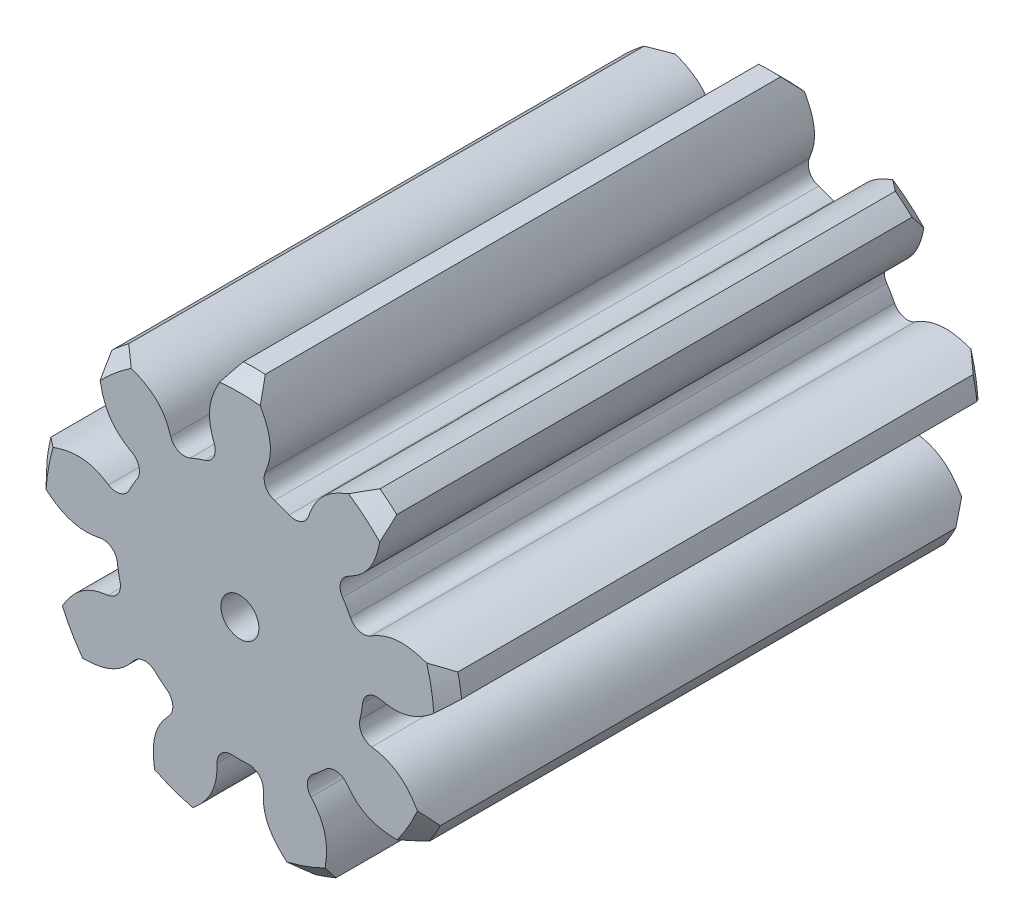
ISO-10303-21;
HEADER;
FILE_DESCRIPTION(('STEP AP214'),'2;1');
FILE_NAME('part.step','',(''),(''),'','','');
FILE_SCHEMA(('AUTOMOTIVE_DESIGN { 1 0 10303 214 1 1 1 1 }'));
ENDSEC;
DATA;
#1=APPLICATION_CONTEXT('core data for automotive mechanical design processes');
#2=APPLICATION_PROTOCOL_DEFINITION('international standard','automotive_design',2000,#1);
#3=PRODUCT_CONTEXT('',#1,'mechanical');
#4=PRODUCT('Part','Part','',(#3));
#5=PRODUCT_RELATED_PRODUCT_CATEGORY('part','',(#4));
#6=PRODUCT_DEFINITION_FORMATION('','',#4);
#7=PRODUCT_DEFINITION_CONTEXT('part definition',#1,'design');
#8=PRODUCT_DEFINITION('design','',#6,#7);
#9=PRODUCT_DEFINITION_SHAPE('','',#8);
#10=(LENGTH_UNIT() NAMED_UNIT(*) SI_UNIT(.MILLI.,.METRE.));
#11=(NAMED_UNIT(*) PLANE_ANGLE_UNIT() SI_UNIT($,.RADIAN.));
#12=(NAMED_UNIT(*) SI_UNIT($,.STERADIAN.) SOLID_ANGLE_UNIT());
#13=UNCERTAINTY_MEASURE_WITH_UNIT(LENGTH_MEASURE(1.E-05),#10,'distance_accuracy_value','');
#14=(GEOMETRIC_REPRESENTATION_CONTEXT(3) GLOBAL_UNCERTAINTY_ASSIGNED_CONTEXT((#13)) GLOBAL_UNIT_ASSIGNED_CONTEXT((#10,
#11,#12)) REPRESENTATION_CONTEXT('',''));
#15=CARTESIAN_POINT('',(0.,0.,0.));
#16=DIRECTION('',(0.,0.,1.));
#17=DIRECTION('',(1.,0.,0.));
#18=AXIS2_PLACEMENT_3D('',#15,#16,#17);
#19=CARTESIAN_POINT('',(0.,0.,-21.5));
#20=DIRECTION('',(0.,0.,1.));
#21=DIRECTION('',(1.,0.,0.));
#22=AXIS2_PLACEMENT_3D('',#19,#20,#21);
#23=CYLINDRICAL_SURFACE('',#22,4.875);
#24=CARTESIAN_POINT('',(0.,0.,-21.5));
#25=DIRECTION('',(0.,0.,1.));
#26=DIRECTION('',(1.,0.,0.));
#27=AXIS2_PLACEMENT_3D('',#24,#25,#26);
#28=CIRCLE('',#27,4.875);
#29=CARTESIAN_POINT('',(4.36396197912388,2.17289227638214,-21.5));
#30=VERTEX_POINT('',#29);
#31=CARTESIAN_POINT('',(4.05403332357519,2.70747831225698,-21.5));
#32=VERTEX_POINT('',#31);
#33=EDGE_CURVE('E621',#30,#32,#28,.T.);
#34=ORIENTED_EDGE('',*,*,#33,.T.);
#35=DIRECTION('',(0.,0.,1.));
#36=VECTOR('',#35,1.);
#37=CARTESIAN_POINT('',(4.05403332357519,2.70747831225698,-21.5));
#38=LINE('',#37,#36);
#39=CARTESIAN_POINT('',(4.05403332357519,2.70747831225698,0.));
#40=VERTEX_POINT('',#39);
#41=EDGE_CURVE('E753',#32,#40,#38,.T.);
#42=ORIENTED_EDGE('',*,*,#41,.T.);
#43=CARTESIAN_POINT('',(0.,0.,0.));
#44=DIRECTION('',(0.,0.,1.));
#45=DIRECTION('',(1.,0.,0.));
#46=AXIS2_PLACEMENT_3D('',#43,#44,#45);
#47=CIRCLE('',#46,4.875);
#48=CARTESIAN_POINT('',(4.36396197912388,2.17289227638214,0.));
#49=VERTEX_POINT('',#48);
#50=EDGE_CURVE('E624',#49,#40,#47,.T.);
#51=ORIENTED_EDGE('',*,*,#50,.F.);
#52=DIRECTION('',(0.,0.,1.));
#53=VECTOR('',#52,1.);
#54=CARTESIAN_POINT('',(4.36396197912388,2.17289227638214,-21.5));
#55=LINE('',#54,#53);
#56=EDGE_CURVE('E729',#49,#30,#55,.F.);
#57=ORIENTED_EDGE('',*,*,#56,.T.);
#58=EDGE_LOOP('',(#34,#42,#51,#57));
#59=FACE_BOUND('',#58,.T.);
#60=ADVANCED_FACE('F38',(#59),#23,.T.);
#61=CARTESIAN_POINT('',(4.73969705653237,-1.1405686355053,-21.5));
#62=VERTEX_POINT('',#61);
#63=CARTESIAN_POINT('',(4.84590321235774,-0.531833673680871,-21.5));
#64=VERTEX_POINT('',#63);
#65=EDGE_CURVE('E1986',#62,#64,#28,.T.);
#66=ORIENTED_EDGE('',*,*,#65,.T.);
#67=DIRECTION('',(0.,0.,1.));
#68=VECTOR('',#67,1.);
#69=CARTESIAN_POINT('',(4.84590321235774,-0.531833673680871,-21.5));
#70=LINE('',#69,#68);
#71=CARTESIAN_POINT('',(4.84590321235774,-0.531833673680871,0.));
#72=VERTEX_POINT('',#71);
#73=EDGE_CURVE('E734',#64,#72,#70,.T.);
#74=ORIENTED_EDGE('',*,*,#73,.T.);
#75=CARTESIAN_POINT('',(4.73969705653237,-1.1405686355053,0.));
#76=VERTEX_POINT('',#75);
#77=EDGE_CURVE('E627',#76,#72,#47,.T.);
#78=ORIENTED_EDGE('',*,*,#77,.F.);
#79=DIRECTION('',(0.,0.,1.));
#80=VECTOR('',#79,1.);
#81=CARTESIAN_POINT('',(4.73969705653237,-1.1405686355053,-21.5));
#82=LINE('',#81,#80);
#83=EDGE_CURVE('E710',#76,#62,#82,.F.);
#84=ORIENTED_EDGE('',*,*,#83,.T.);
#85=EDGE_LOOP('',(#66,#74,#78,#84));
#86=FACE_BOUND('',#85,.T.);
#87=ADVANCED_FACE('F1303',(#86),#23,.T.);
#88=CARTESIAN_POINT('',(2.8976752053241,-3.9203448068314,-21.5));
#89=VERTEX_POINT('',#88);
#90=CARTESIAN_POINT('',(3.37032113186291,-3.52229477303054,-21.5));
#91=VERTEX_POINT('',#90);
#92=EDGE_CURVE('E1981',#89,#91,#28,.T.);
#93=ORIENTED_EDGE('',*,*,#92,.T.);
#94=DIRECTION('',(0.,0.,1.));
#95=VECTOR('',#94,1.);
#96=CARTESIAN_POINT('',(3.37032113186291,-3.52229477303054,-21.5));
#97=LINE('',#96,#95);
#98=CARTESIAN_POINT('',(3.37032113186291,-3.52229477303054,0.));
#99=VERTEX_POINT('',#98);
#100=EDGE_CURVE('E715',#91,#99,#97,.T.);
#101=ORIENTED_EDGE('',*,*,#100,.T.);
#102=CARTESIAN_POINT('',(2.8976752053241,-3.9203448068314,0.));
#103=VERTEX_POINT('',#102);
#104=EDGE_CURVE('E631',#103,#99,#47,.T.);
#105=ORIENTED_EDGE('',*,*,#104,.F.);
#106=DIRECTION('',(0.,0.,1.));
#107=VECTOR('',#106,1.);
#108=CARTESIAN_POINT('',(2.8976752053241,-3.9203448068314,-21.5));
#109=LINE('',#108,#107);
#110=EDGE_CURVE('E691',#103,#89,#109,.F.);
#111=ORIENTED_EDGE('',*,*,#110,.T.);
#112=EDGE_LOOP('',(#93,#101,#105,#111));
#113=FACE_BOUND('',#112,.T.);
#114=ADVANCED_FACE('F1308',(#113),#23,.T.);
#115=CARTESIAN_POINT('',(-0.300201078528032,-4.86574807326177,-21.5));
#116=VERTEX_POINT('',#115);
#117=CARTESIAN_POINT('',(0.317728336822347,-4.86463500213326,-21.5));
#118=VERTEX_POINT('',#117);
#119=EDGE_CURVE('E1985',#116,#118,#28,.T.);
#120=ORIENTED_EDGE('',*,*,#119,.T.);
#121=DIRECTION('',(0.,0.,1.));
#122=VECTOR('',#121,1.);
#123=CARTESIAN_POINT('',(0.317728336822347,-4.86463500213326,-21.5));
#124=LINE('',#123,#122);
#125=CARTESIAN_POINT('',(0.317728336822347,-4.86463500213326,0.));
#126=VERTEX_POINT('',#125);
#127=EDGE_CURVE('E696',#118,#126,#124,.T.);
#128=ORIENTED_EDGE('',*,*,#127,.T.);
#129=CARTESIAN_POINT('',(-0.300201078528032,-4.86574807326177,0.));
#130=VERTEX_POINT('',#129);
#131=EDGE_CURVE('E635',#130,#126,#47,.T.);
#132=ORIENTED_EDGE('',*,*,#131,.F.);
#133=DIRECTION('',(0.,0.,1.));
#134=VECTOR('',#133,1.);
#135=CARTESIAN_POINT('',(-0.300201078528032,-4.86574807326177,-21.5));
#136=LINE('',#135,#134);
#137=EDGE_CURVE('E667',#130,#116,#136,.F.);
#138=ORIENTED_EDGE('',*,*,#137,.T.);
#139=EDGE_LOOP('',(#120,#128,#132,#138));
#140=FACE_BOUND('',#139,.T.);
#141=ADVANCED_FACE('F1869',(#140),#23,.T.);
#142=CARTESIAN_POINT('',(-3.35760994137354,-3.53441373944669,-21.5));
#143=VERTEX_POINT('',#142);
#144=CARTESIAN_POINT('',(-2.88353307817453,-3.93075844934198,-21.5));
#145=VERTEX_POINT('',#144);
#146=EDGE_CURVE('E1003',#143,#145,#28,.T.);
#147=ORIENTED_EDGE('',*,*,#146,.T.);
#148=DIRECTION('',(0.,0.,1.));
#149=VECTOR('',#148,1.);
#150=CARTESIAN_POINT('',(-2.88353307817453,-3.93075844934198,-21.5));
#151=LINE('',#150,#149);
#152=CARTESIAN_POINT('',(-2.88353307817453,-3.93075844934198,0.));
#153=VERTEX_POINT('',#152);
#154=EDGE_CURVE('E677',#145,#153,#151,.T.);
#155=ORIENTED_EDGE('',*,*,#154,.T.);
#156=CARTESIAN_POINT('',(-3.35760994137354,-3.53441373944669,0.));
#157=VERTEX_POINT('',#156);
#158=EDGE_CURVE('E639',#157,#153,#47,.T.);
#159=ORIENTED_EDGE('',*,*,#158,.F.);
#160=DIRECTION('',(0.,0.,1.));
#161=VECTOR('',#160,1.);
#162=CARTESIAN_POINT('',(-3.35760994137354,-3.53441373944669,-21.5));
#163=LINE('',#162,#161);
#164=EDGE_CURVE('E990',#157,#143,#163,.F.);
#165=ORIENTED_EDGE('',*,*,#164,.T.);
#166=EDGE_LOOP('',(#147,#155,#159,#165));
#167=FACE_BOUND('',#166,.T.);
#168=ADVANCED_FACE('F1861',(#167),#23,.T.);
#169=CARTESIAN_POINT('',(-4.84395579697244,-0.549287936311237,-21.5));
#170=VERTEX_POINT('',#169);
#171=CARTESIAN_POINT('',(-4.73555731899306,-1.15763633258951,-21.5));
#172=VERTEX_POINT('',#171);
#173=EDGE_CURVE('E1289',#170,#172,#28,.T.);
#174=ORIENTED_EDGE('',*,*,#173,.T.);
#175=DIRECTION('',(0.,0.,1.));
#176=VECTOR('',#175,1.);
#177=CARTESIAN_POINT('',(-4.73555731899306,-1.15763633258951,-21.5));
#178=LINE('',#177,#176);
#179=CARTESIAN_POINT('',(-4.73555731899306,-1.15763633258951,0.));
#180=VERTEX_POINT('',#179);
#181=EDGE_CURVE('E660',#172,#180,#178,.T.);
#182=ORIENTED_EDGE('',*,*,#181,.T.);
#183=CARTESIAN_POINT('',(-4.84395579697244,-0.549287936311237,0.));
#184=VERTEX_POINT('',#183);
#185=EDGE_CURVE('E623',#184,#180,#47,.T.);
#186=ORIENTED_EDGE('',*,*,#185,.F.);
#187=DIRECTION('',(0.,0.,1.));
#188=VECTOR('',#187,1.);
#189=CARTESIAN_POINT('',(-4.84395579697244,-0.549287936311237,-21.5));
#190=LINE('',#189,#188);
#191=EDGE_CURVE('E972',#184,#170,#190,.F.);
#192=ORIENTED_EDGE('',*,*,#191,.T.);
#193=EDGE_LOOP('',(#174,#182,#186,#192));
#194=FACE_BOUND('',#193,.T.);
#195=ADVANCED_FACE('F1853',(#194),#23,.T.);
#196=CARTESIAN_POINT('',(-4.06376090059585,2.69285579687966,-21.5));
#197=VERTEX_POINT('',#196);
#198=CARTESIAN_POINT('',(-4.37176166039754,2.15715668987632,-21.5));
#199=VERTEX_POINT('',#198);
#200=EDGE_CURVE('E519',#197,#199,#28,.T.);
#201=ORIENTED_EDGE('',*,*,#200,.T.);
#202=DIRECTION('',(0.,0.,1.));
#203=VECTOR('',#202,1.);
#204=CARTESIAN_POINT('',(-4.37176166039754,2.15715668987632,-21.5));
#205=LINE('',#204,#203);
#206=CARTESIAN_POINT('',(-4.37176166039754,2.15715668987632,0.));
#207=VERTEX_POINT('',#206);
#208=EDGE_CURVE('E977',#199,#207,#205,.T.);
#209=ORIENTED_EDGE('',*,*,#208,.T.);
#210=CARTESIAN_POINT('',(-4.06376090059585,2.69285579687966,0.));
#211=VERTEX_POINT('',#210);
#212=EDGE_CURVE('E617',#211,#207,#47,.T.);
#213=ORIENTED_EDGE('',*,*,#212,.F.);
#214=DIRECTION('',(0.,0.,1.));
#215=VECTOR('',#214,1.);
#216=CARTESIAN_POINT('',(-4.06376090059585,2.69285579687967,-21.5));
#217=LINE('',#216,#215);
#218=EDGE_CURVE('E951',#211,#197,#217,.F.);
#219=ORIENTED_EDGE('',*,*,#218,.T.);
#220=EDGE_LOOP('',(#201,#209,#213,#219));
#221=FACE_BOUND('',#220,.T.);
#222=ADVANCED_FACE('F1286',(#221),#23,.T.);
#223=CARTESIAN_POINT('',(-1.3820871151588,4.67498237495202,-21.5));
#224=VERTEX_POINT('',#223);
#225=CARTESIAN_POINT('',(-1.9623701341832,4.46259212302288,-21.5));
#226=VERTEX_POINT('',#225);
#227=EDGE_CURVE('E506',#224,#226,#28,.T.);
#228=ORIENTED_EDGE('',*,*,#227,.T.);
#229=DIRECTION('',(0.,0.,1.));
#230=VECTOR('',#229,1.);
#231=CARTESIAN_POINT('',(-1.9623701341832,4.46259212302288,-21.5));
#232=LINE('',#231,#230);
#233=CARTESIAN_POINT('',(-1.9623701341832,4.46259212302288,0.));
#234=VERTEX_POINT('',#233);
#235=EDGE_CURVE('E958',#226,#234,#232,.T.);
#236=ORIENTED_EDGE('',*,*,#235,.T.);
#237=CARTESIAN_POINT('',(-1.3820871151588,4.67498237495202,0.));
#238=VERTEX_POINT('',#237);
#239=EDGE_CURVE('E615',#238,#234,#47,.T.);
#240=ORIENTED_EDGE('',*,*,#239,.F.);
#241=DIRECTION('',(0.,0.,1.));
#242=VECTOR('',#241,1.);
#243=CARTESIAN_POINT('',(-1.3820871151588,4.67498237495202,-21.5));
#244=LINE('',#243,#242);
#245=EDGE_CURVE('E517',#238,#224,#244,.F.);
#246=ORIENTED_EDGE('',*,*,#245,.T.);
#247=EDGE_LOOP('',(#228,#236,#240,#246));
#248=FACE_BOUND('',#247,.T.);
#249=ADVANCED_FACE('F1312',(#248),#23,.T.);
#250=CARTESIAN_POINT('',(1.94628059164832,4.46963274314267,0.));
#251=VERTEX_POINT('',#250);
#252=CARTESIAN_POINT('',(1.36523618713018,4.67993110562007,0.));
#253=VERTEX_POINT('',#252);
#254=EDGE_CURVE('E613',#251,#253,#47,.T.);
#255=ORIENTED_EDGE('',*,*,#254,.F.);
#256=DIRECTION('',(0.,0.,1.));
#257=VECTOR('',#256,1.);
#258=CARTESIAN_POINT('',(1.94628059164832,4.46963274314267,-21.5));
#259=LINE('',#258,#257);
#260=CARTESIAN_POINT('',(1.94628059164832,4.46963274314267,-21.5));
#261=VERTEX_POINT('',#260);
#262=EDGE_CURVE('E748',#251,#261,#259,.F.);
#263=ORIENTED_EDGE('',*,*,#262,.T.);
#264=CARTESIAN_POINT('',(1.36523618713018,4.67993110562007,-21.5));
#265=VERTEX_POINT('',#264);
#266=EDGE_CURVE('E521',#261,#265,#28,.T.);
#267=ORIENTED_EDGE('',*,*,#266,.T.);
#268=DIRECTION('',(0.,0.,1.));
#269=VECTOR('',#268,1.);
#270=CARTESIAN_POINT('',(1.36523618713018,4.67993110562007,-21.5));
#271=LINE('',#270,#269);
#272=EDGE_CURVE('E514',#265,#253,#271,.T.);
#273=ORIENTED_EDGE('',*,*,#272,.T.);
#274=EDGE_LOOP('',(#255,#263,#267,#273));
#275=FACE_BOUND('',#274,.T.);
#276=ADVANCED_FACE('F40',(#275),#23,.T.);
#277=CARTESIAN_POINT('',(0.,0.,-21.5));
#278=DIRECTION('',(0.,0.,1.));
#279=DIRECTION('',(1.,0.,0.));
#280=AXIS2_PLACEMENT_3D('',#277,#278,#279);
#281=PLANE('',#280);
#282=CARTESIAN_POINT('',(0.,0.,-21.5));
#283=DIRECTION('',(0.,0.,1.));
#284=DIRECTION('',(1.,0.,0.));
#285=AXIS2_PLACEMENT_3D('',#282,#283,#284);
#286=CIRCLE('',#285,0.75);
#287=CARTESIAN_POINT('',(0.75,0.,-21.5));
#288=VERTEX_POINT('',#287);
#289=EDGE_CURVE('E2304',#288,#288,#286,.T.);
#290=ORIENTED_EDGE('',*,*,#289,.T.);
#291=EDGE_LOOP('',(#290));
#292=FACE_BOUND('',#291,.T.);
#293=CARTESIAN_POINT('',(4.96464157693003,6.5889933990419,-21.5));
#294=CARTESIAN_POINT('',(4.38711179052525,6.41141597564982,-21.5));
#295=CARTESIAN_POINT('',(3.67209338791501,6.19156389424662,-21.5));
#296=CARTESIAN_POINT('',(2.66995641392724,5.12173928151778,-21.5));
#297=CARTESIAN_POINT('',(2.56643490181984,4.2017727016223,-21.5));
#298=CARTESIAN_POINT('',(2.380256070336,3.50904268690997,-21.5));
#299=B_SPLINE_CURVE_WITH_KNOTS('',3,(#293,#294,#295,#296,#297,#298),.UNSPECIFIED.,.F.,.F.,(4,1,
1,4),(0.,0.406187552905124,0.502885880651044,1.),.UNSPECIFIED.);
#300=CARTESIAN_POINT('',(4.29368066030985,6.36762957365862,-21.5));
#301=VERTEX_POINT('',#300);
#302=CARTESIAN_POINT('',(2.71370466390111,4.80933623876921,-21.5));
#303=VERTEX_POINT('',#302);
#304=EDGE_CURVE('E1329',#301,#303,#299,.T.);
#305=ORIENTED_EDGE('',*,*,#304,.F.);
#306=CARTESIAN_POINT('',(0.,0.,-21.5));
#307=DIRECTION('',(0.,0.,1.));
#308=DIRECTION('',(1.,0.,0.));
#309=AXIS2_PLACEMENT_3D('',#306,#307,#308);
#310=CIRCLE('',#309,7.68);
#311=CARTESIAN_POINT('',(5.52474335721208,5.33475499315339,-21.5));
#312=VERTEX_POINT('',#311);
#313=EDGE_CURVE('E11',#301,#312,#310,.F.);
#314=ORIENTED_EDGE('',*,*,#313,.T.);
#315=CARTESIAN_POINT('',(3.04240531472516,2.95343350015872,-21.5));
#316=CARTESIAN_POINT('',(3.66361628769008,3.31208982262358,-21.5));
#317=CARTESIAN_POINT('',(4.58248146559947,3.51457912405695,-21.5));
#318=CARTESIAN_POINT('',(5.45874692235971,4.69357264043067,-21.5));
#319=CARTESIAN_POINT('',(5.551706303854,5.43473644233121,-21.5));
#320=CARTESIAN_POINT('',(5.6267908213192,6.03338421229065,-21.5));
#321=B_SPLINE_CURVE_WITH_KNOTS('',3,(#315,#316,#317,#318,#319,#320),.UNSPECIFIED.,.F.,.F.,(4,1,
1,4),(0.,0.497114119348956,0.593812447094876,1.),.UNSPECIFIED.);
#322=CARTESIAN_POINT('',(4.26646041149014,3.53047797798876,-21.5));
#323=VERTEX_POINT('',#322);
#324=EDGE_CURVE('E2156',#323,#312,#321,.T.);
#325=ORIENTED_EDGE('',*,*,#324,.F.);
#326=CARTESIAN_POINT('',(4.52804337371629,3.02404500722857,-21.5));
#327=DIRECTION('',(0.,0.,1.));
#328=DIRECTION('',(1.,0.,0.));
#329=AXIS2_PLACEMENT_3D('',#326,#327,#328);
#330=CIRCLE('',#329,0.57);
#331=EDGE_CURVE('E760',#323,#32,#330,.T.);
#332=ORIENTED_EDGE('',*,*,#331,.T.);
#333=ORIENTED_EDGE('',*,*,#33,.F.);
#334=CARTESIAN_POINT('',(4.87420984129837,2.42695352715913,-21.5));
#335=DIRECTION('',(0.,0.,1.));
#336=DIRECTION('',(1.,0.,0.));
#337=AXIS2_PLACEMENT_3D('',#334,#335,#336);
#338=CIRCLE('',#337,0.57);
#339=CARTESIAN_POINT('',(5.17020012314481,1.93982956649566,-21.5));
#340=VERTEX_POINT('',#339);
#341=EDGE_CURVE('E738',#30,#340,#338,.T.);
#342=ORIENTED_EDGE('',*,*,#341,.T.);
#343=CARTESIAN_POINT('',(8.03845940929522,1.85625168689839,-21.5));
#344=CARTESIAN_POINT('',(7.48190135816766,2.09144847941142,-21.5));
#345=CARTESIAN_POINT('',(6.7928472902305,2.38263698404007,-21.5));
#346=CARTESIAN_POINT('',(5.3374958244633,2.20726501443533,-21.5));
#347=CARTESIAN_POINT('',(4.66685062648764,1.56907207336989,-21.5));
#348=CARTESIAN_POINT('',(4.078951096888,1.15808354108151,-21.5));
#349=B_SPLINE_CURVE_WITH_KNOTS('',3,(#343,#344,#345,#346,#347,#348),.UNSPECIFIED.,.F.,.F.,(4,1,
1,4),(0.,0.406187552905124,0.502885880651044,1.),.UNSPECIFIED.);
#350=CARTESIAN_POINT('',(7.38218360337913,2.11796252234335,-21.5));
#351=VERTEX_POINT('',#350);
#352=EDGE_CURVE('E2093',#351,#340,#349,.T.);
#353=ORIENTED_EDGE('',*,*,#352,.F.);
#354=CARTESIAN_POINT('',(0.,0.,-21.5));
#355=DIRECTION('',(0.,0.,1.));
#356=DIRECTION('',(1.,0.,0.));
#357=AXIS2_PLACEMENT_3D('',#354,#355,#356);
#358=CIRCLE('',#357,7.68);
#359=CARTESIAN_POINT('',(7.6613133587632,0.535422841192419,-21.5));
#360=VERTEX_POINT('',#359);
#361=EDGE_CURVE('E2118',#351,#360,#358,.F.);
#362=ORIENTED_EDGE('',*,*,#361,.T.);
#363=CARTESIAN_POINT('',(4.22904814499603,0.306840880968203,-21.5));
#364=CARTESIAN_POINT('',(4.93546319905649,0.182280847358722,-21.5));
#365=CARTESIAN_POINT('',(5.76951237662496,-0.253238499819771,-21.5));
#366=CARTESIAN_POINT('',(7.19861308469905,0.0866703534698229,-21.5));
#367=CARTESIAN_POINT('',(7.74623501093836,0.594681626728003,-21.5));
#368=CARTESIAN_POINT('',(8.18855645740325,1.00500902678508,-21.5));
#369=B_SPLINE_CURVE_WITH_KNOTS('',3,(#363,#364,#365,#366,#367,#368),.UNSPECIFIED.,.F.,.F.,(4,1,
1,4),(0.,0.497114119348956,0.593812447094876,1.),.UNSPECIFIED.);
#370=CARTESIAN_POINT('',(5.53764579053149,-0.0379248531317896,-21.5));
#371=VERTEX_POINT('',#370);
#372=EDGE_CURVE('E2087',#371,#360,#369,.T.);
#373=ORIENTED_EDGE('',*,*,#372,.F.);
#374=CARTESIAN_POINT('',(5.41250112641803,-0.594017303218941,-21.5));
#375=DIRECTION('',(0.,0.,1.));
#376=DIRECTION('',(1.,0.,0.));
#377=AXIS2_PLACEMENT_3D('',#374,#375,#376);
#378=CIRCLE('',#377,0.57);
#379=EDGE_CURVE('E741',#371,#64,#378,.T.);
#380=ORIENTED_EDGE('',*,*,#379,.T.);
#381=ORIENTED_EDGE('',*,*,#65,.F.);
#382=CARTESIAN_POINT('',(5.29387702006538,-1.27392742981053,-21.5));
#383=DIRECTION('',(0.,0.,1.));
#384=DIRECTION('',(1.,0.,0.));
#385=AXIS2_PLACEMENT_3D('',#382,#383,#384);
#386=CIRCLE('',#385,0.57);
#387=CARTESIAN_POINT('',(5.20750148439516,-1.83734491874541,-21.5));
#388=VERTEX_POINT('',#387);
#389=EDGE_CURVE('E719',#62,#388,#386,.T.);
#390=ORIENTED_EDGE('',*,*,#389,.T.);
#391=CARTESIAN_POINT('',(7.35099274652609,-3.74505081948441,-21.5));
#392=CARTESIAN_POINT('',(7.07582612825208,-3.20713100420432,-21.5));
#393=CARTESIAN_POINT('',(6.73515245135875,-2.5411522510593,-21.5));
#394=CARTESIAN_POINT('',(5.50756161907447,-1.74001308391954,-21.5));
#395=CARTESIAN_POINT('',(4.58359507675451,-1.79781481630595,-21.5));
#396=CARTESIAN_POINT('',(3.86905957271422,-1.73475576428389,-21.5));
#397=B_SPLINE_CURVE_WITH_KNOTS('',3,(#391,#392,#393,#394,#395,#396),.UNSPECIFIED.,.F.,.F.,(4,1,
1,4),(0.,0.406187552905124,0.502885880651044,1.),.UNSPECIFIED.);
#398=CARTESIAN_POINT('',(7.01648079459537,-3.12272273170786,-21.5));
#399=VERTEX_POINT('',#398);
#400=EDGE_CURVE('E2022',#399,#388,#397,.T.);
#401=ORIENTED_EDGE('',*,*,#400,.F.);
#402=CARTESIAN_POINT('',(0.,0.,-21.5));
#403=DIRECTION('',(0.,0.,1.));
#404=DIRECTION('',(1.,0.,0.));
#405=AXIS2_PLACEMENT_3D('',#402,#403,#404);
#406=CIRCLE('',#405,7.68);
#407=CARTESIAN_POINT('',(6.21306969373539,-4.51443960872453,-21.5));
#408=VERTEX_POINT('',#407);
#409=EDGE_CURVE('E2045',#399,#408,#406,.F.);
#410=ORIENTED_EDGE('',*,*,#409,.T.);
#411=CARTESIAN_POINT('',(3.43687234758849,-2.48332599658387,-21.5));
#412=CARTESIAN_POINT('',(3.89795202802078,-3.03281936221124,-21.5));
#413=CARTESIAN_POINT('',(4.25692432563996,-3.90256301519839,-21.5));
#414=CARTESIAN_POINT('',(5.57016818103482,-4.56078595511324,-21.5));
#415=CARTESIAN_POINT('',(6.316214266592,-4.52363133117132,-21.5));
#416=CARTESIAN_POINT('',(6.91880552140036,-4.4936210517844,-21.5));
#417=B_SPLINE_CURVE_WITH_KNOTS('',3,(#411,#412,#413,#414,#415,#416),.UNSPECIFIED.,.F.,.F.,(4,1,
1,4),(0.,0.497114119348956,0.593812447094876,1.),.UNSPECIFIED.);
#418=CARTESIAN_POINT('',(4.21770516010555,-3.58858222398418,-21.5));
#419=VERTEX_POINT('',#418);
#420=EDGE_CURVE('E2001',#419,#408,#417,.T.);
#421=ORIENTED_EDGE('',*,*,#420,.F.);
#422=CARTESIAN_POINT('',(3.76438944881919,-3.93413231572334,-21.5));
#423=DIRECTION('',(0.,0.,1.));
#424=DIRECTION('',(1.,0.,0.));
#425=AXIS2_PLACEMENT_3D('',#422,#423,#424);
#426=CIRCLE('',#425,0.57);
#427=EDGE_CURVE('E722',#419,#91,#426,.T.);
#428=ORIENTED_EDGE('',*,*,#427,.T.);
#429=ORIENTED_EDGE('',*,*,#92,.F.);
#430=CARTESIAN_POINT('',(3.2364803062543,-4.37872358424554,-21.5));
#431=DIRECTION('',(0.,0.,1.));
#432=DIRECTION('',(1.,0.,0.));
#433=AXIS2_PLACEMENT_3D('',#430,#431,#432);
#434=CIRCLE('',#433,0.57);
#435=CARTESIAN_POINT('',(2.80815502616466,-4.75480529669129,-21.5));
#436=VERTEX_POINT('',#435);
#437=EDGE_CURVE('E700',#89,#436,#434,.T.);
#438=ORIENTED_EDGE('',*,*,#437,.T.);
#439=CARTESIAN_POINT('',(3.22391488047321,-7.59400242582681,-21.5));
#440=CARTESIAN_POINT('',(3.35889321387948,-7.00505824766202,-21.5));
#441=CARTESIAN_POINT('',(3.52600492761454,-6.27590810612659,-21.5));
#442=CARTESIAN_POINT('',(3.10057812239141,-4.87311972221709,-21.5));
#443=CARTESIAN_POINT('',(2.35562444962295,-4.32348417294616,-21.5));
#444=CARTESIAN_POINT('',(1.84879207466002,-3.81588356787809,-21.5));
#445=B_SPLINE_CURVE_WITH_KNOTS('',3,(#439,#440,#441,#442,#443,#444),.UNSPECIFIED.,.F.,.F.,(4,1,
1,4),(0.,0.406187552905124,0.502885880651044,1.),.UNSPECIFIED.);
#446=CARTESIAN_POINT('',(3.36768864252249,-6.9022513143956,-21.5));
#447=VERTEX_POINT('',#446);
#448=EDGE_CURVE('E1182',#447,#436,#445,.T.);
#449=ORIENTED_EDGE('',*,*,#448,.F.);
#450=CARTESIAN_POINT('',(0.,0.,-21.5));
#451=DIRECTION('',(0.,0.,1.));
#452=DIRECTION('',(1.,0.,0.));
#453=AXIS2_PLACEMENT_3D('',#450,#451,#452);
#454=CIRCLE('',#453,7.68);
#455=CARTESIAN_POINT('',(1.85766166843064,-7.45194559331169,-21.5));
#456=VERTEX_POINT('',#455);
#457=EDGE_CURVE('E2227',#447,#456,#454,.F.);
#458=ORIENTED_EDGE('',*,*,#457,.T.);
#459=CARTESIAN_POINT('',(1.03654578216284,-4.11151704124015,-21.5));
#460=CARTESIAN_POINT('',(1.03654578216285,-4.82882968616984,-21.5));
#461=CARTESIAN_POINT('',(0.752474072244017,-5.72583492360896,-21.5));
#462=CARTESIAN_POINT('',(1.33537967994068,-7.07419982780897,-21.5));
#463=CARTESIAN_POINT('',(1.93076667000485,-7.52528691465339,-21.5));
#464=CARTESIAN_POINT('',(2.41166858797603,-7.88963589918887,-21.5));
#465=B_SPLINE_CURVE_WITH_KNOTS('',3,(#459,#460,#461,#462,#463,#464),.UNSPECIFIED.,.F.,.F.,(4,1,
1,4),(0.,0.497114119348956,0.593812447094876,1.),.UNSPECIFIED.);
#466=CARTESIAN_POINT('',(0.924253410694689,-5.46010208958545,-21.5));
#467=VERTEX_POINT('',#466);
#468=EDGE_CURVE('E1176',#467,#456,#465,.T.);
#469=ORIENTED_EDGE('',*,*,#468,.F.);
#470=CARTESIAN_POINT('',(0.354878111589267,-5.43342309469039,-21.5));
#471=DIRECTION('',(0.,0.,1.));
#472=DIRECTION('',(1.,0.,0.));
#473=AXIS2_PLACEMENT_3D('',#470,#471,#472);
#474=CIRCLE('',#473,0.57);
#475=EDGE_CURVE('E703',#467,#118,#474,.T.);
#476=ORIENTED_EDGE('',*,*,#475,.T.);
#477=ORIENTED_EDGE('',*,*,#119,.F.);
#478=CARTESIAN_POINT('',(-0.335301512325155,-5.43466630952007,-21.5));
#479=DIRECTION('',(0.,0.,1.));
#480=DIRECTION('',(1.,0.,0.));
#481=AXIS2_PLACEMENT_3D('',#478,#479,#480);
#482=CIRCLE('',#481,0.57);
#483=CARTESIAN_POINT('',(-0.905158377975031,-5.44743943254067,-21.5));
#484=VERTEX_POINT('',#483);
#485=EDGE_CURVE('E681',#116,#484,#482,.T.);
#486=ORIENTED_EDGE('',*,*,#485,.T.);
#487=CARTESIAN_POINT('',(-2.41166858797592,-7.8896358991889,-21.5));
#488=CARTESIAN_POINT('',(-1.92970316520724,-7.52524088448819,-21.5));
#489=CARTESIAN_POINT('',(-1.33299948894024,-7.07409680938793,-21.5));
#490=CARTESIAN_POINT('',(-0.757200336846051,-5.72603948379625,-21.5));
#491=CARTESIAN_POINT('',(-0.974569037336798,-4.82614723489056,-21.5));
#492=CARTESIAN_POINT('',(-1.03654578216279,-4.11151704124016,-21.5));
#493=B_SPLINE_CURVE_WITH_KNOTS('',3,(#487,#488,#489,#490,#491,#492),.UNSPECIFIED.,.F.,.F.,(4,1,
1,4),(0.,0.406187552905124,0.502885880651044,1.),.UNSPECIFIED.);
#494=CARTESIAN_POINT('',(-1.85688245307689,-7.45213979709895,-21.5));
#495=VERTEX_POINT('',#494);
#496=EDGE_CURVE('E1222',#495,#484,#493,.T.);
#497=ORIENTED_EDGE('',*,*,#496,.F.);
#498=CARTESIAN_POINT('',(0.,0.,-21.5));
#499=DIRECTION('',(0.,0.,1.));
#500=DIRECTION('',(1.,0.,0.));
#501=AXIS2_PLACEMENT_3D('',#498,#499,#500);
#502=CIRCLE('',#501,7.68);
#503=CARTESIAN_POINT('',(-3.36696689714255,-6.90260341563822,-21.5));
#504=VERTEX_POINT('',#503);
#505=EDGE_CURVE('E1108',#495,#504,#502,.F.);
#506=ORIENTED_EDGE('',*,*,#505,.T.);
#507=CARTESIAN_POINT('',(-1.84879207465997,-3.81588356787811,-21.5));
#508=CARTESIAN_POINT('',(-2.30987175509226,-4.36537693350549,-21.5));
#509=CARTESIAN_POINT('',(-3.10406716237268,-4.86992503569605,-21.5));
#510=CARTESIAN_POINT('',(-3.52424781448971,-6.27751698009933,-21.5));
#511=CARTESIAN_POINT('',(-3.35810810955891,-7.00577711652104,-21.5));
#512=CARTESIAN_POINT('',(-3.2239148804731,-7.59400242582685,-21.5));
#513=B_SPLINE_CURVE_WITH_KNOTS('',3,(#507,#508,#509,#510,#511,#512),.UNSPECIFIED.,.F.,.F.,(4,1,
1,4),(0.,0.497114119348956,0.593812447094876,1.),.UNSPECIFIED.);
#514=CARTESIAN_POINT('',(-2.80166678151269,-4.77677950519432,-21.5));
#515=VERTEX_POINT('',#514);
#516=EDGE_CURVE('E1214',#515,#504,#513,.T.);
#517=ORIENTED_EDGE('',*,*,#516,.F.);
#518=CARTESIAN_POINT('',(-3.22068463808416,-4.39035482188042,-21.5));
#519=DIRECTION('',(0.,0.,1.));
#520=DIRECTION('',(1.,0.,0.));
#521=AXIS2_PLACEMENT_3D('',#518,#519,#520);
#522=CIRCLE('',#521,0.57);
#523=EDGE_CURVE('E684',#515,#145,#522,.T.);
#524=ORIENTED_EDGE('',*,*,#523,.T.);
#525=ORIENTED_EDGE('',*,*,#146,.F.);
#526=CARTESIAN_POINT('',(-3.75019202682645,-3.947668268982,-21.5));
#527=DIRECTION('',(0.,0.,1.));
#528=DIRECTION('',(1.,0.,0.));
#529=AXIS2_PLACEMENT_3D('',#526,#527,#528);
#530=CIRCLE('',#529,0.57);
#531=CARTESIAN_POINT('',(-4.19493811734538,-3.59115611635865,-21.5));
#532=VERTEX_POINT('',#531);
#533=EDGE_CURVE('E669',#143,#532,#530,.T.);
#534=ORIENTED_EDGE('',*,*,#533,.T.);
#535=CARTESIAN_POINT('',(-6.9188055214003,-4.4936210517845,-21.5));
#536=CARTESIAN_POINT('',(-6.3153699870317,-4.5242796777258,-21.5));
#537=CARTESIAN_POINT('',(-5.56827862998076,-4.56223699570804,-21.5));
#538=CARTESIAN_POINT('',(-4.26067634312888,-3.89968173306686,-21.5));
#539=CARTESIAN_POINT('',(-3.84875084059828,-3.0706023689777,-21.5));
#540=CARTESIAN_POINT('',(-3.43687234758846,-2.48332599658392,-21.5));
#541=B_SPLINE_CURVE_WITH_KNOTS('',3,(#535,#536,#537,#538,#539,#540),.UNSPECIFIED.,.F.,.F.,(4,1,
1,4),(0.,0.406187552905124,0.502885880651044,1.),.UNSPECIFIED.);
#542=CARTESIAN_POINT('',(-6.21259761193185,-4.51508924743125,-21.5));
#543=VERTEX_POINT('',#542);
#544=EDGE_CURVE('E1000',#543,#532,#541,.T.);
#545=ORIENTED_EDGE('',*,*,#544,.F.);
#546=CARTESIAN_POINT('',(0.,0.,-21.5));
#547=DIRECTION('',(0.,0.,1.));
#548=DIRECTION('',(1.,0.,0.));
#549=AXIS2_PLACEMENT_3D('',#546,#547,#548);
#550=CIRCLE('',#549,7.68);
#551=CARTESIAN_POINT('',(-7.01615423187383,-3.12345638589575,-21.5));
#552=VERTEX_POINT('',#551);
#553=EDGE_CURVE('E2269',#543,#552,#550,.F.);
#554=ORIENTED_EDGE('',*,*,#553,.T.);
#555=CARTESIAN_POINT('',(-3.86905957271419,-1.73475576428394,-21.5));
#556=CARTESIAN_POINT('',(-4.57547462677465,-1.85931579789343,-21.5));
#557=CARTESIAN_POINT('',(-5.50818087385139,-1.73532310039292,-21.5));
#558=CARTESIAN_POINT('',(-6.73484058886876,-2.54351417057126,-21.5));
#559=CARTESIAN_POINT('',(-7.0756867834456,-3.20818634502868,-21.5));
#560=CARTESIAN_POINT('',(-7.35099274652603,-3.74505081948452,-21.5));
#561=B_SPLINE_CURVE_WITH_KNOTS('',3,(#555,#556,#557,#558,#559,#560),.UNSPECIFIED.,.F.,.F.,(4,1,
1,4),(0.,0.497114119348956,0.593812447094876,1.),.UNSPECIFIED.);
#562=CARTESIAN_POINT('',(-5.21665594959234,-1.858348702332,-21.5));
#563=VERTEX_POINT('',#562);
#564=EDGE_CURVE('E1015',#563,#552,#561,.T.);
#565=ORIENTED_EDGE('',*,*,#564,.F.);
#566=CARTESIAN_POINT('',(-5.28925325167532,-1.29299073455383,-21.5));
#567=DIRECTION('',(0.,0.,1.));
#568=DIRECTION('',(1.,0.,0.));
#569=AXIS2_PLACEMENT_3D('',#566,#567,#568);
#570=CIRCLE('',#569,0.57);
#571=EDGE_CURVE('E664',#563,#172,#570,.T.);
#572=ORIENTED_EDGE('',*,*,#571,.T.);
#573=ORIENTED_EDGE('',*,*,#173,.F.);
#574=CARTESIAN_POINT('',(-5.41032601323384,-0.613512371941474,-21.5));
#575=DIRECTION('',(0.,0.,1.));
#576=DIRECTION('',(1.,0.,0.));
#577=AXIS2_PLACEMENT_3D('',#574,#575,#576);
#578=CIRCLE('',#577,0.57);
#579=CARTESIAN_POINT('',(-5.52185969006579,-0.0545309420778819,-21.5));
#580=VERTEX_POINT('',#579);
#581=EDGE_CURVE('E980',#170,#580,#578,.T.);
#582=ORIENTED_EDGE('',*,*,#581,.T.);
#583=CARTESIAN_POINT('',(-8.18855645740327,1.00500902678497,-21.5));
#584=CARTESIAN_POINT('',(-7.74600500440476,0.593642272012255,-21.5));
#585=CARTESIAN_POINT('',(-7.19809831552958,0.0843442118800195,-21.5));
#586=CARTESIAN_POINT('',(-5.77053453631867,-0.248619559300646,-21.5));
#587=CARTESIAN_POINT('',(-4.9220593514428,0.121711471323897,-21.5));
#588=CARTESIAN_POINT('',(-4.22904814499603,0.306840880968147,-21.5));
#589=B_SPLINE_CURVE_WITH_KNOTS('',3,(#583,#584,#585,#586,#587,#588),.UNSPECIFIED.,.F.,.F.,(4,1,
1,4),(0.,0.406187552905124,0.502885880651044,1.),.UNSPECIFIED.);
#590=CARTESIAN_POINT('',(-7.66136930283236,0.534621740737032,-21.5));
#591=VERTEX_POINT('',#590);
#592=EDGE_CURVE('E874',#591,#580,#589,.T.);
#593=ORIENTED_EDGE('',*,*,#592,.F.);
#594=CARTESIAN_POINT('',(0.,0.,-21.5));
#595=DIRECTION('',(0.,0.,1.));
#596=DIRECTION('',(1.,0.,0.));
#597=AXIS2_PLACEMENT_3D('',#594,#595,#596);
#598=CIRCLE('',#597,7.68);
#599=CARTESIAN_POINT('',(-7.38240502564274,2.11719060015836,-21.5));
#600=VERTEX_POINT('',#599);
#601=EDGE_CURVE('E1255',#591,#600,#598,.F.);
#602=ORIENTED_EDGE('',*,*,#601,.T.);
#603=CARTESIAN_POINT('',(-4.07895109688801,1.15808354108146,-21.5));
#604=CARTESIAN_POINT('',(-4.70016206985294,1.5167398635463,-21.5));
#605=CARTESIAN_POINT('',(-5.33495553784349,2.21125579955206,-21.5));
#606=CARTESIAN_POINT('',(-6.7941266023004,2.38062718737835,-21.5));
#607=CARTESIAN_POINT('',(-7.48247297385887,2.09055047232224,-21.5));
#608=CARTESIAN_POINT('',(-8.03845940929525,1.85625168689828,-21.5));
#609=B_SPLINE_CURVE_WITH_KNOTS('',3,(#603,#604,#605,#606,#607,#608),.UNSPECIFIED.,.F.,.F.,(4,1,
1,4),(0.,0.497114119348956,0.593812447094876,1.),.UNSPECIFIED.);
#610=CARTESIAN_POINT('',(-5.19071382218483,1.92962411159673,-21.5));
#611=VERTEX_POINT('',#610);
#612=EDGE_CURVE('E868',#611,#600,#609,.T.);
#613=ORIENTED_EDGE('',*,*,#612,.F.);
#614=CARTESIAN_POINT('',(-4.88292148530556,2.40937808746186,-21.5));
#615=DIRECTION('',(0.,0.,1.));
#616=DIRECTION('',(1.,0.,0.));
#617=AXIS2_PLACEMENT_3D('',#614,#615,#616);
#618=CIRCLE('',#617,0.57);
#619=EDGE_CURVE('E983',#611,#199,#618,.T.);
#620=ORIENTED_EDGE('',*,*,#619,.T.);
#621=ORIENTED_EDGE('',*,*,#200,.F.);
#622=CARTESIAN_POINT('',(-4.53890832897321,3.00771278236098,-21.5));
#623=DIRECTION('',(0.,0.,1.));
#624=DIRECTION('',(1.,0.,0.));
#625=AXIS2_PLACEMENT_3D('',#622,#623,#624);
#626=CIRCLE('',#625,0.57);
#627=CARTESIAN_POINT('',(-4.26504174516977,3.50760986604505,-21.5));
#628=VERTEX_POINT('',#627);
#629=EDGE_CURVE('E962',#197,#628,#626,.T.);
#630=ORIENTED_EDGE('',*,*,#629,.T.);
#631=CARTESIAN_POINT('',(-5.62679082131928,6.03338421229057,-21.5));
#632=CARTESIAN_POINT('',(-5.55219819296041,5.43379240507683,-21.5));
#633=CARTESIAN_POINT('',(-5.45984780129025,4.69145982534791,-21.5));
#634=CARTESIAN_POINT('',(-4.58029548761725,3.51877446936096,-21.5));
#635=CARTESIAN_POINT('',(-3.69228158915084,3.25707516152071,-21.5));
#636=CARTESIAN_POINT('',(-3.0424053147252,2.95343350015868,-21.5));
#637=B_SPLINE_CURVE_WITH_KNOTS('',3,(#631,#632,#633,#634,#635,#636),.UNSPECIFIED.,.F.,.F.,(4,1,
1,4),(0.,0.406187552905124,0.502885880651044,1.),.UNSPECIFIED.);
#638=CARTESIAN_POINT('',(-5.52530115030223,5.33417727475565,-21.5));
#639=VERTEX_POINT('',#638);
#640=EDGE_CURVE('E914',#639,#628,#637,.T.);
#641=ORIENTED_EDGE('',*,*,#640,.F.);
#642=CARTESIAN_POINT('',(0.,0.,-21.5));
#643=DIRECTION('',(0.,0.,1.));
#644=DIRECTION('',(1.,0.,0.));
#645=AXIS2_PLACEMENT_3D('',#642,#643,#644);
#646=CIRCLE('',#645,7.68);
#647=CARTESIAN_POINT('',(-4.29434646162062,6.36718057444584,-21.5));
#648=VERTEX_POINT('',#647);
#649=EDGE_CURVE('E813',#639,#648,#646,.F.);
#650=ORIENTED_EDGE('',*,*,#649,.T.);
#651=CARTESIAN_POINT('',(-2.38025607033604,3.50904268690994,-21.5));
#652=CARTESIAN_POINT('',(-2.62559144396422,4.1830960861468,-21.5));
#653=CARTESIAN_POINT('',(-2.66544521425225,5.12316353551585,-21.5));
#654=CARTESIAN_POINT('',(-3.67436527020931,6.19084662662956,-21.5));
#655=CARTESIAN_POINT('',(-4.38812690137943,6.41109548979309,-21.5));
#656=CARTESIAN_POINT('',(-4.96464157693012,6.58899339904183,-21.5));
#657=B_SPLINE_CURVE_WITH_KNOTS('',3,(#651,#652,#653,#654,#655,#656),.UNSPECIFIED.,.F.,.F.,(4,1,
1,4),(0.,0.497114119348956,0.593812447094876,1.),.UNSPECIFIED.);
#658=CARTESIAN_POINT('',(-2.73597900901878,4.81470435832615,-21.5));
#659=VERTEX_POINT('',#658);
#660=EDGE_CURVE('E906',#659,#648,#657,.T.);
#661=ORIENTED_EDGE('',*,*,#660,.F.);
#662=CARTESIAN_POINT('',(-2.19181648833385,4.9843721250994,-21.5));
#663=DIRECTION('',(0.,0.,1.));
#664=DIRECTION('',(1.,0.,0.));
#665=AXIS2_PLACEMENT_3D('',#662,#663,#664);
#666=CIRCLE('',#665,0.57);
#667=EDGE_CURVE('E965',#659,#226,#666,.T.);
#668=ORIENTED_EDGE('',*,*,#667,.T.);
#669=ORIENTED_EDGE('',*,*,#227,.F.);
#670=CARTESIAN_POINT('',(-1.5436849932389,5.22159569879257,-21.5));
#671=DIRECTION('',(0.,0.,1.));
#672=DIRECTION('',(1.,0.,0.));
#673=AXIS2_PLACEMENT_3D('',#670,#671,#672);
#674=CIRCLE('',#673,0.57);
#675=CARTESIAN_POINT('',(-1.01256336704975,5.4285010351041,-21.5));
#676=VERTEX_POINT('',#675);
#677=EDGE_CURVE('E503',#224,#676,#674,.T.);
#678=ORIENTED_EDGE('',*,*,#677,.T.);
#679=CARTESIAN_POINT('',(-0.432187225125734,8.23867187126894,-21.5));
#680=CARTESIAN_POINT('',(-0.760456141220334,7.73141068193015,-21.5));
#681=CARTESIAN_POINT('',(-1.16687382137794,7.10338924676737,-21.5));
#682=CARTESIAN_POINT('',(-1.24688527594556,5.63969481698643,-21.5));
#683=CARTESIAN_POINT('',(-0.734844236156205,4.86841718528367,-21.5));
#684=CARTESIAN_POINT('',(-0.432187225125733,4.21808176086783,-21.5));
#685=B_SPLINE_CURVE_WITH_KNOTS('',3,(#679,#680,#681,#682,#683,#684),.UNSPECIFIED.,.F.,.F.,(4,1,
1,4),(0.,0.406187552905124,0.502885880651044,1.),.UNSPECIFIED.);
#686=CARTESIAN_POINT('',(-0.803883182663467,7.63781197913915,-21.5));
#687=VERTEX_POINT('',#686);
#688=EDGE_CURVE('E489',#687,#676,#685,.T.);
#689=ORIENTED_EDGE('',*,*,#688,.F.);
#690=CARTESIAN_POINT('',(0.,0.,-21.5));
#691=DIRECTION('',(0.,0.,1.));
#692=DIRECTION('',(1.,0.,0.));
#693=AXIS2_PLACEMENT_3D('',#690,#691,#692);
#694=CIRCLE('',#693,7.68);
#695=CARTESIAN_POINT('',(0.803084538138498,7.6378959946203,-21.5));
#696=VERTEX_POINT('',#695);
#697=EDGE_CURVE('E947',#687,#696,#694,.F.);
#698=ORIENTED_EDGE('',*,*,#697,.T.);
#699=CARTESIAN_POINT('',(0.432187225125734,4.21808176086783,-21.5));
#700=CARTESIAN_POINT('',(0.677522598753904,4.89213516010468,-21.5));
#701=CARTESIAN_POINT('',(1.25125654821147,5.63788611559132,-21.5));
#702=CARTESIAN_POINT('',(1.16467240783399,7.10430012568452,-21.5));
#703=CARTESIAN_POINT('',(0.759472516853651,7.73181767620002,-21.5));
#704=CARTESIAN_POINT('',(0.432187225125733,8.23867187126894,-21.5));
#705=B_SPLINE_CURVE_WITH_KNOTS('',3,(#699,#700,#701,#702,#703,#704),.UNSPECIFIED.,.F.,.F.,(4,1,
1,4),(0.,0.497114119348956,0.593812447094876,1.),.UNSPECIFIED.);
#706=CARTESIAN_POINT('',(0.998950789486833,5.4469309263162,-21.5));
#707=VERTEX_POINT('',#706);
#708=EDGE_CURVE('E499',#707,#696,#705,.T.);
#709=ORIENTED_EDGE('',*,*,#708,.F.);
#710=CARTESIAN_POINT('',(1.52486380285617,5.22712305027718,-21.5));
#711=DIRECTION('',(0.,0.,1.));
#712=DIRECTION('',(1.,0.,0.));
#713=AXIS2_PLACEMENT_3D('',#710,#711,#712);
#714=CIRCLE('',#713,0.57);
#715=EDGE_CURVE('E509',#707,#265,#714,.T.);
#716=ORIENTED_EDGE('',*,*,#715,.T.);
#717=ORIENTED_EDGE('',*,*,#266,.F.);
#718=CARTESIAN_POINT('',(2.17384570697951,4.99223595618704,-21.5));
#719=DIRECTION('',(0.,0.,1.));
#720=DIRECTION('',(1.,0.,0.));
#721=AXIS2_PLACEMENT_3D('',#718,#719,#720);
#722=CIRCLE('',#721,0.57);
#723=EDGE_CURVE('E757',#261,#303,#722,.T.);
#724=ORIENTED_EDGE('',*,*,#723,.T.);
#725=EDGE_LOOP('',(#305,#314,#325,#332,#333,#342,#353,#362,#373,#380,#381,#390,#401,#410,#421,
#428,#429,#438,#449,#458,#469,#476,#477,#486,#497,#506,#517,#524,#525,#534,#545,#554,#565,#572,
#573,#582,#593,#602,#613,#620,#621,#630,#641,#650,#661,#668,#669,#678,#689,#698,#709,#716,#717,#724));
#726=FACE_BOUND('',#725,.T.);
#727=ADVANCED_FACE('F504',(#292,#726),#281,.F.);
#728=CARTESIAN_POINT('',(0.,0.,0.));
#729=DIRECTION('',(0.,0.,1.));
#730=DIRECTION('',(1.,0.,0.));
#731=AXIS2_PLACEMENT_3D('',#728,#729,#730);
#732=PLANE('',#731);
#733=CARTESIAN_POINT('',(0.,0.,0.));
#734=DIRECTION('',(0.,0.,1.));
#735=DIRECTION('',(1.,0.,0.));
#736=AXIS2_PLACEMENT_3D('',#733,#734,#735);
#737=CIRCLE('',#736,0.75);
#738=CARTESIAN_POINT('',(0.75,0.,0.));
#739=VERTEX_POINT('',#738);
#740=EDGE_CURVE('E2306',#739,#739,#737,.T.);
#741=ORIENTED_EDGE('',*,*,#740,.F.);
#742=EDGE_LOOP('',(#741));
#743=FACE_BOUND('',#742,.T.);
#744=CARTESIAN_POINT('',(3.04240531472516,2.95343350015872,0.));
#745=CARTESIAN_POINT('',(3.66361628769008,3.31208982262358,0.));
#746=CARTESIAN_POINT('',(4.58248146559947,3.51457912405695,0.));
#747=CARTESIAN_POINT('',(5.45874692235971,4.69357264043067,0.));
#748=CARTESIAN_POINT('',(5.551706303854,5.43473644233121,0.));
#749=CARTESIAN_POINT('',(5.6267908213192,6.03338421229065,0.));
#750=B_SPLINE_CURVE_WITH_KNOTS('',3,(#744,#745,#746,#747,#748,#749),.UNSPECIFIED.,.F.,.F.,(4,1,
1,4),(0.,0.497114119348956,0.593812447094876,1.),.UNSPECIFIED.);
#751=CARTESIAN_POINT('',(4.26646041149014,3.53047797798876,0.));
#752=VERTEX_POINT('',#751);
#753=CARTESIAN_POINT('',(5.52474335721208,5.33475499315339,0.));
#754=VERTEX_POINT('',#753);
#755=EDGE_CURVE('E2301',#752,#754,#750,.T.);
#756=ORIENTED_EDGE('',*,*,#755,.T.);
#757=CARTESIAN_POINT('',(0.,0.,0.));
#758=DIRECTION('',(0.,0.,1.));
#759=DIRECTION('',(1.,0.,0.));
#760=AXIS2_PLACEMENT_3D('',#757,#758,#759);
#761=CIRCLE('',#760,7.68);
#762=CARTESIAN_POINT('',(4.29368066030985,6.36762957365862,0.));
#763=VERTEX_POINT('',#762);
#764=EDGE_CURVE('E2119',#754,#763,#761,.T.);
#765=ORIENTED_EDGE('',*,*,#764,.T.);
#766=CARTESIAN_POINT('',(4.96464157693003,6.5889933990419,0.));
#767=CARTESIAN_POINT('',(4.38711179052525,6.41141597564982,0.));
#768=CARTESIAN_POINT('',(3.67209338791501,6.19156389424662,0.));
#769=CARTESIAN_POINT('',(2.66995641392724,5.12173928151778,0.));
#770=CARTESIAN_POINT('',(2.56643490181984,4.2017727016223,0.));
#771=CARTESIAN_POINT('',(2.380256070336,3.50904268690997,0.));
#772=B_SPLINE_CURVE_WITH_KNOTS('',3,(#766,#767,#768,#769,#770,#771),.UNSPECIFIED.,.F.,.F.,(4,1,
1,4),(0.,0.406187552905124,0.502885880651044,1.),.UNSPECIFIED.);
#773=CARTESIAN_POINT('',(2.71370466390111,4.80933623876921,0.));
#774=VERTEX_POINT('',#773);
#775=EDGE_CURVE('E2161',#763,#774,#772,.T.);
#776=ORIENTED_EDGE('',*,*,#775,.T.);
#777=CARTESIAN_POINT('',(2.17384570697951,4.99223595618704,0.));
#778=DIRECTION('',(0.,0.,1.));
#779=DIRECTION('',(1.,0.,0.));
#780=AXIS2_PLACEMENT_3D('',#777,#778,#779);
#781=CIRCLE('',#780,0.57);
#782=EDGE_CURVE('E755',#774,#251,#781,.F.);
#783=ORIENTED_EDGE('',*,*,#782,.T.);
#784=ORIENTED_EDGE('',*,*,#254,.T.);
#785=CARTESIAN_POINT('',(1.52486380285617,5.22712305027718,0.));
#786=DIRECTION('',(0.,0.,1.));
#787=DIRECTION('',(1.,0.,0.));
#788=AXIS2_PLACEMENT_3D('',#785,#786,#787);
#789=CIRCLE('',#788,0.57);
#790=CARTESIAN_POINT('',(0.998950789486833,5.4469309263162,0.));
#791=VERTEX_POINT('',#790);
#792=EDGE_CURVE('E531',#253,#791,#789,.F.);
#793=ORIENTED_EDGE('',*,*,#792,.T.);
#794=CARTESIAN_POINT('',(0.432187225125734,4.21808176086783,0.));
#795=CARTESIAN_POINT('',(0.677522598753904,4.89213516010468,0.));
#796=CARTESIAN_POINT('',(1.25125654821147,5.63788611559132,0.));
#797=CARTESIAN_POINT('',(1.16467240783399,7.10430012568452,0.));
#798=CARTESIAN_POINT('',(0.759472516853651,7.73181767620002,0.));
#799=CARTESIAN_POINT('',(0.432187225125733,8.23867187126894,0.));
#800=B_SPLINE_CURVE_WITH_KNOTS('',3,(#794,#795,#796,#797,#798,#799),.UNSPECIFIED.,.F.,.F.,(4,1,
1,4),(0.,0.497114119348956,0.593812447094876,1.),.UNSPECIFIED.);
#801=CARTESIAN_POINT('',(0.803084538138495,7.63789599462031,0.));
#802=VERTEX_POINT('',#801);
#803=EDGE_CURVE('E929',#791,#802,#800,.T.);
#804=ORIENTED_EDGE('',*,*,#803,.T.);
#805=CARTESIAN_POINT('',(0.,0.,0.));
#806=DIRECTION('',(0.,0.,1.));
#807=DIRECTION('',(1.,0.,0.));
#808=AXIS2_PLACEMENT_3D('',#805,#806,#807);
#809=CIRCLE('',#808,7.68);
#810=CARTESIAN_POINT('',(-0.803883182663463,7.63781197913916,0.));
#811=VERTEX_POINT('',#810);
#812=EDGE_CURVE('E533',#802,#811,#809,.T.);
#813=ORIENTED_EDGE('',*,*,#812,.T.);
#814=CARTESIAN_POINT('',(-0.432187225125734,8.23867187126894,0.));
#815=CARTESIAN_POINT('',(-0.760456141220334,7.73141068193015,0.));
#816=CARTESIAN_POINT('',(-1.16687382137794,7.10338924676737,0.));
#817=CARTESIAN_POINT('',(-1.24688527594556,5.63969481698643,0.));
#818=CARTESIAN_POINT('',(-0.734844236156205,4.86841718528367,0.));
#819=CARTESIAN_POINT('',(-0.432187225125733,4.21808176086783,0.));
#820=B_SPLINE_CURVE_WITH_KNOTS('',3,(#814,#815,#816,#817,#818,#819),.UNSPECIFIED.,.F.,.F.,(4,1,
1,4),(0.,0.406187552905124,0.502885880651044,1.),.UNSPECIFIED.);
#821=CARTESIAN_POINT('',(-1.01256336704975,5.4285010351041,0.));
#822=VERTEX_POINT('',#821);
#823=EDGE_CURVE('E596',#811,#822,#820,.T.);
#824=ORIENTED_EDGE('',*,*,#823,.T.);
#825=CARTESIAN_POINT('',(-1.5436849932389,5.22159569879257,0.));
#826=DIRECTION('',(0.,0.,1.));
#827=DIRECTION('',(1.,0.,0.));
#828=AXIS2_PLACEMENT_3D('',#825,#826,#827);
#829=CIRCLE('',#828,0.57);
#830=EDGE_CURVE('E510',#822,#238,#829,.F.);
#831=ORIENTED_EDGE('',*,*,#830,.T.);
#832=ORIENTED_EDGE('',*,*,#239,.T.);
#833=CARTESIAN_POINT('',(-2.19181648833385,4.9843721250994,0.));
#834=DIRECTION('',(0.,0.,1.));
#835=DIRECTION('',(1.,0.,0.));
#836=AXIS2_PLACEMENT_3D('',#833,#834,#835);
#837=CIRCLE('',#836,0.57);
#838=CARTESIAN_POINT('',(-2.73597900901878,4.81470435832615,0.));
#839=VERTEX_POINT('',#838);
#840=EDGE_CURVE('E967',#234,#839,#837,.F.);
#841=ORIENTED_EDGE('',*,*,#840,.T.);
#842=CARTESIAN_POINT('',(-2.38025607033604,3.50904268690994,0.));
#843=CARTESIAN_POINT('',(-2.62559144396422,4.1830960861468,0.));
#844=CARTESIAN_POINT('',(-2.66544521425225,5.12316353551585,0.));
#845=CARTESIAN_POINT('',(-3.67436527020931,6.19084662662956,0.));
#846=CARTESIAN_POINT('',(-4.38812690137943,6.41109548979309,0.));
#847=CARTESIAN_POINT('',(-4.96464157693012,6.58899339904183,0.));
#848=B_SPLINE_CURVE_WITH_KNOTS('',3,(#842,#843,#844,#845,#846,#847),.UNSPECIFIED.,.F.,.F.,(4,1,
1,4),(0.,0.497114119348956,0.593812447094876,1.),.UNSPECIFIED.);
#849=CARTESIAN_POINT('',(-4.29434646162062,6.36718057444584,0.));
#850=VERTEX_POINT('',#849);
#851=EDGE_CURVE('E893',#839,#850,#848,.T.);
#852=ORIENTED_EDGE('',*,*,#851,.T.);
#853=CARTESIAN_POINT('',(0.,0.,0.));
#854=DIRECTION('',(0.,0.,1.));
#855=DIRECTION('',(1.,0.,0.));
#856=AXIS2_PLACEMENT_3D('',#853,#854,#855);
#857=CIRCLE('',#856,7.68);
#858=CARTESIAN_POINT('',(-5.52530115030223,5.33417727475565,0.));
#859=VERTEX_POINT('',#858);
#860=EDGE_CURVE('E764',#850,#859,#857,.T.);
#861=ORIENTED_EDGE('',*,*,#860,.T.);
#862=CARTESIAN_POINT('',(-5.62679082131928,6.03338421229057,0.));
#863=CARTESIAN_POINT('',(-5.55219819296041,5.43379240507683,0.));
#864=CARTESIAN_POINT('',(-5.45984780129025,4.69145982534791,0.));
#865=CARTESIAN_POINT('',(-4.58029548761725,3.51877446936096,0.));
#866=CARTESIAN_POINT('',(-3.69228158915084,3.25707516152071,0.));
#867=CARTESIAN_POINT('',(-3.0424053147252,2.95343350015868,0.));
#868=B_SPLINE_CURVE_WITH_KNOTS('',3,(#862,#863,#864,#865,#866,#867),.UNSPECIFIED.,.F.,.F.,(4,1,
1,4),(0.,0.406187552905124,0.502885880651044,1.),.UNSPECIFIED.);
#869=CARTESIAN_POINT('',(-4.26504174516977,3.50760986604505,0.));
#870=VERTEX_POINT('',#869);
#871=EDGE_CURVE('E900',#859,#870,#868,.T.);
#872=ORIENTED_EDGE('',*,*,#871,.T.);
#873=CARTESIAN_POINT('',(-4.53890832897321,3.00771278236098,0.));
#874=DIRECTION('',(0.,0.,1.));
#875=DIRECTION('',(1.,0.,0.));
#876=AXIS2_PLACEMENT_3D('',#873,#874,#875);
#877=CIRCLE('',#876,0.57);
#878=EDGE_CURVE('E960',#870,#211,#877,.F.);
#879=ORIENTED_EDGE('',*,*,#878,.T.);
#880=ORIENTED_EDGE('',*,*,#212,.T.);
#881=CARTESIAN_POINT('',(-4.88292148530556,2.40937808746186,0.));
#882=DIRECTION('',(0.,0.,1.));
#883=DIRECTION('',(1.,0.,0.));
#884=AXIS2_PLACEMENT_3D('',#881,#882,#883);
#885=CIRCLE('',#884,0.57);
#886=CARTESIAN_POINT('',(-5.19071382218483,1.92962411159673,0.));
#887=VERTEX_POINT('',#886);
#888=EDGE_CURVE('E985',#207,#887,#885,.F.);
#889=ORIENTED_EDGE('',*,*,#888,.T.);
#890=CARTESIAN_POINT('',(-4.07895109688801,1.15808354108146,0.));
#891=CARTESIAN_POINT('',(-4.70016206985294,1.5167398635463,0.));
#892=CARTESIAN_POINT('',(-5.33495553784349,2.21125579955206,0.));
#893=CARTESIAN_POINT('',(-6.7941266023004,2.38062718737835,0.));
#894=CARTESIAN_POINT('',(-7.48247297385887,2.09055047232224,0.));
#895=CARTESIAN_POINT('',(-8.03845940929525,1.85625168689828,0.));
#896=B_SPLINE_CURVE_WITH_KNOTS('',3,(#890,#891,#892,#893,#894,#895),.UNSPECIFIED.,.F.,.F.,(4,1,
1,4),(0.,0.497114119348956,0.593812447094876,1.),.UNSPECIFIED.);
#897=CARTESIAN_POINT('',(-7.38240502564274,2.11719060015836,0.));
#898=VERTEX_POINT('',#897);
#899=EDGE_CURVE('E1262',#887,#898,#896,.T.);
#900=ORIENTED_EDGE('',*,*,#899,.T.);
#901=CARTESIAN_POINT('',(0.,0.,0.));
#902=DIRECTION('',(0.,0.,1.));
#903=DIRECTION('',(1.,0.,0.));
#904=AXIS2_PLACEMENT_3D('',#901,#902,#903);
#905=CIRCLE('',#904,7.68);
#906=CARTESIAN_POINT('',(-7.66136930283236,0.534621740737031,0.));
#907=VERTEX_POINT('',#906);
#908=EDGE_CURVE('E815',#898,#907,#905,.T.);
#909=ORIENTED_EDGE('',*,*,#908,.T.);
#910=CARTESIAN_POINT('',(-8.18855645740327,1.00500902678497,0.));
#911=CARTESIAN_POINT('',(-7.74600500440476,0.593642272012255,0.));
#912=CARTESIAN_POINT('',(-7.19809831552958,0.0843442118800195,0.));
#913=CARTESIAN_POINT('',(-5.77053453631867,-0.248619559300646,0.));
#914=CARTESIAN_POINT('',(-4.9220593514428,0.121711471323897,0.));
#915=CARTESIAN_POINT('',(-4.22904814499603,0.306840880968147,0.));
#916=B_SPLINE_CURVE_WITH_KNOTS('',3,(#910,#911,#912,#913,#914,#915),.UNSPECIFIED.,.F.,.F.,(4,1,
1,4),(0.,0.406187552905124,0.502885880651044,1.),.UNSPECIFIED.);
#917=CARTESIAN_POINT('',(-5.52185969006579,-0.0545309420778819,0.));
#918=VERTEX_POINT('',#917);
#919=EDGE_CURVE('E875',#907,#918,#916,.T.);
#920=ORIENTED_EDGE('',*,*,#919,.T.);
#921=CARTESIAN_POINT('',(-5.41032601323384,-0.613512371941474,0.));
#922=DIRECTION('',(0.,0.,1.));
#923=DIRECTION('',(1.,0.,0.));
#924=AXIS2_PLACEMENT_3D('',#921,#922,#923);
#925=CIRCLE('',#924,0.57);
#926=EDGE_CURVE('E653',#918,#184,#925,.F.);
#927=ORIENTED_EDGE('',*,*,#926,.T.);
#928=ORIENTED_EDGE('',*,*,#185,.T.);
#929=CARTESIAN_POINT('',(-5.28925325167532,-1.29299073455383,0.));
#930=DIRECTION('',(0.,0.,1.));
#931=DIRECTION('',(1.,0.,0.));
#932=AXIS2_PLACEMENT_3D('',#929,#930,#931);
#933=CIRCLE('',#932,0.57);
#934=CARTESIAN_POINT('',(-5.21665594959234,-1.858348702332,0.));
#935=VERTEX_POINT('',#934);
#936=EDGE_CURVE('E650',#180,#935,#933,.F.);
#937=ORIENTED_EDGE('',*,*,#936,.T.);
#938=CARTESIAN_POINT('',(-3.86905957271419,-1.73475576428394,0.));
#939=CARTESIAN_POINT('',(-4.57547462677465,-1.85931579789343,0.));
#940=CARTESIAN_POINT('',(-5.50818087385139,-1.73532310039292,0.));
#941=CARTESIAN_POINT('',(-6.73484058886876,-2.54351417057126,0.));
#942=CARTESIAN_POINT('',(-7.0756867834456,-3.20818634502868,0.));
#943=CARTESIAN_POINT('',(-7.35099274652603,-3.74505081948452,0.));
#944=B_SPLINE_CURVE_WITH_KNOTS('',3,(#938,#939,#940,#941,#942,#943),.UNSPECIFIED.,.F.,.F.,(4,1,
1,4),(0.,0.497114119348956,0.593812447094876,1.),.UNSPECIFIED.);
#945=CARTESIAN_POINT('',(-7.01615423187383,-3.12345638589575,0.));
#946=VERTEX_POINT('',#945);
#947=EDGE_CURVE('E1237',#935,#946,#944,.T.);
#948=ORIENTED_EDGE('',*,*,#947,.T.);
#949=CARTESIAN_POINT('',(0.,0.,0.));
#950=DIRECTION('',(0.,0.,1.));
#951=DIRECTION('',(1.,0.,0.));
#952=AXIS2_PLACEMENT_3D('',#949,#950,#951);
#953=CIRCLE('',#952,7.68);
#954=CARTESIAN_POINT('',(-6.21259761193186,-4.51508924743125,0.));
#955=VERTEX_POINT('',#954);
#956=EDGE_CURVE('E1252',#946,#955,#953,.T.);
#957=ORIENTED_EDGE('',*,*,#956,.T.);
#958=CARTESIAN_POINT('',(-6.9188055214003,-4.4936210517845,0.));
#959=CARTESIAN_POINT('',(-6.3153699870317,-4.5242796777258,0.));
#960=CARTESIAN_POINT('',(-5.56827862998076,-4.56223699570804,0.));
#961=CARTESIAN_POINT('',(-4.26067634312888,-3.89968173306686,0.));
#962=CARTESIAN_POINT('',(-3.84875084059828,-3.0706023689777,0.));
#963=CARTESIAN_POINT('',(-3.43687234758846,-2.48332599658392,0.));
#964=B_SPLINE_CURVE_WITH_KNOTS('',3,(#958,#959,#960,#961,#962,#963),.UNSPECIFIED.,.F.,.F.,(4,1,
1,4),(0.,0.406187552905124,0.502885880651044,1.),.UNSPECIFIED.);
#965=CARTESIAN_POINT('',(-4.19493811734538,-3.59115611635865,0.));
#966=VERTEX_POINT('',#965);
#967=EDGE_CURVE('E1011',#955,#966,#964,.T.);
#968=ORIENTED_EDGE('',*,*,#967,.T.);
#969=CARTESIAN_POINT('',(-3.75019202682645,-3.947668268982,0.));
#970=DIRECTION('',(0.,0.,1.));
#971=DIRECTION('',(1.,0.,0.));
#972=AXIS2_PLACEMENT_3D('',#969,#970,#971);
#973=CIRCLE('',#972,0.57);
#974=EDGE_CURVE('E994',#966,#157,#973,.F.);
#975=ORIENTED_EDGE('',*,*,#974,.T.);
#976=ORIENTED_EDGE('',*,*,#158,.T.);
#977=CARTESIAN_POINT('',(-3.22068463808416,-4.39035482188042,0.));
#978=DIRECTION('',(0.,0.,1.));
#979=DIRECTION('',(1.,0.,0.));
#980=AXIS2_PLACEMENT_3D('',#977,#978,#979);
#981=CIRCLE('',#980,0.57);
#982=CARTESIAN_POINT('',(-2.80166678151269,-4.77677950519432,0.));
#983=VERTEX_POINT('',#982);
#984=EDGE_CURVE('E686',#153,#983,#981,.F.);
#985=ORIENTED_EDGE('',*,*,#984,.T.);
#986=CARTESIAN_POINT('',(-1.84879207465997,-3.81588356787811,0.));
#987=CARTESIAN_POINT('',(-2.30987175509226,-4.36537693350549,0.));
#988=CARTESIAN_POINT('',(-3.10406716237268,-4.86992503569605,0.));
#989=CARTESIAN_POINT('',(-3.52424781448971,-6.27751698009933,0.));
#990=CARTESIAN_POINT('',(-3.35810810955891,-7.00577711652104,0.));
#991=CARTESIAN_POINT('',(-3.2239148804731,-7.59400242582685,0.));
#992=B_SPLINE_CURVE_WITH_KNOTS('',3,(#986,#987,#988,#989,#990,#991),.UNSPECIFIED.,.F.,.F.,(4,1,
1,4),(0.,0.497114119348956,0.593812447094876,1.),.UNSPECIFIED.);
#993=CARTESIAN_POINT('',(-3.36696689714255,-6.90260341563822,0.));
#994=VERTEX_POINT('',#993);
#995=EDGE_CURVE('E1201',#983,#994,#992,.T.);
#996=ORIENTED_EDGE('',*,*,#995,.T.);
#997=CARTESIAN_POINT('',(0.,0.,0.));
#998=DIRECTION('',(0.,0.,1.));
#999=DIRECTION('',(1.,0.,0.));
#1000=AXIS2_PLACEMENT_3D('',#997,#998,#999);
#1001=CIRCLE('',#1000,7.68);
#1002=CARTESIAN_POINT('',(-1.85688245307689,-7.45213979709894,0.));
#1003=VERTEX_POINT('',#1002);
#1004=EDGE_CURVE('E2270',#994,#1003,#1001,.T.);
#1005=ORIENTED_EDGE('',*,*,#1004,.T.);
#1006=CARTESIAN_POINT('',(-2.41166858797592,-7.8896358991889,0.));
#1007=CARTESIAN_POINT('',(-1.92970316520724,-7.52524088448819,0.));
#1008=CARTESIAN_POINT('',(-1.33299948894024,-7.07409680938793,0.));
#1009=CARTESIAN_POINT('',(-0.757200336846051,-5.72603948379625,0.));
#1010=CARTESIAN_POINT('',(-0.974569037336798,-4.82614723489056,0.));
#1011=CARTESIAN_POINT('',(-1.03654578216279,-4.11151704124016,0.));
#1012=B_SPLINE_CURVE_WITH_KNOTS('',3,(#1006,#1007,#1008,#1009,#1010,#1011),.UNSPECIFIED.,.F.,
.F.,(4,1,1,4),(0.,0.406187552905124,0.502885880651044,1.),.UNSPECIFIED.);
#1013=CARTESIAN_POINT('',(-0.905158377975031,-5.44743943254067,0.));
#1014=VERTEX_POINT('',#1013);
#1015=EDGE_CURVE('E1208',#1003,#1014,#1012,.T.);
#1016=ORIENTED_EDGE('',*,*,#1015,.T.);
#1017=CARTESIAN_POINT('',(-0.335301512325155,-5.43466630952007,0.));
#1018=DIRECTION('',(0.,0.,1.));
#1019=DIRECTION('',(1.,0.,0.));
#1020=AXIS2_PLACEMENT_3D('',#1017,#1018,#1019);
#1021=CIRCLE('',#1020,0.57);
#1022=EDGE_CURVE('E679',#1014,#130,#1021,.F.);
#1023=ORIENTED_EDGE('',*,*,#1022,.T.);
#1024=ORIENTED_EDGE('',*,*,#131,.T.);
#1025=CARTESIAN_POINT('',(0.354878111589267,-5.43342309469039,0.));
#1026=DIRECTION('',(0.,0.,1.));
#1027=DIRECTION('',(1.,0.,0.));
#1028=AXIS2_PLACEMENT_3D('',#1025,#1026,#1027);
#1029=CIRCLE('',#1028,0.57);
#1030=CARTESIAN_POINT('',(0.924253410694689,-5.46010208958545,0.));
#1031=VERTEX_POINT('',#1030);
#1032=EDGE_CURVE('E705',#126,#1031,#1029,.F.);
#1033=ORIENTED_EDGE('',*,*,#1032,.T.);
#1034=CARTESIAN_POINT('',(1.03654578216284,-4.11151704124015,0.));
#1035=CARTESIAN_POINT('',(1.03654578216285,-4.82882968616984,0.));
#1036=CARTESIAN_POINT('',(0.752474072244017,-5.72583492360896,0.));
#1037=CARTESIAN_POINT('',(1.33537967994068,-7.07419982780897,0.));
#1038=CARTESIAN_POINT('',(1.93076667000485,-7.52528691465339,0.));
#1039=CARTESIAN_POINT('',(2.41166858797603,-7.88963589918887,0.));
#1040=B_SPLINE_CURVE_WITH_KNOTS('',3,(#1034,#1035,#1036,#1037,#1038,#1039),.UNSPECIFIED.,.F.,
.F.,(4,1,1,4),(0.,0.497114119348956,0.593812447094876,1.),.UNSPECIFIED.);
#1041=CARTESIAN_POINT('',(1.85766166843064,-7.45194559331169,0.));
#1042=VERTEX_POINT('',#1041);
#1043=EDGE_CURVE('E2211',#1031,#1042,#1040,.T.);
#1044=ORIENTED_EDGE('',*,*,#1043,.T.);
#1045=CARTESIAN_POINT('',(0.,0.,0.));
#1046=DIRECTION('',(0.,0.,1.));
#1047=DIRECTION('',(1.,0.,0.));
#1048=AXIS2_PLACEMENT_3D('',#1045,#1046,#1047);
#1049=CIRCLE('',#1048,7.68);
#1050=CARTESIAN_POINT('',(3.36768864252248,-6.9022513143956,0.));
#1051=VERTEX_POINT('',#1050);
#1052=EDGE_CURVE('E1116',#1042,#1051,#1049,.T.);
#1053=ORIENTED_EDGE('',*,*,#1052,.T.);
#1054=CARTESIAN_POINT('',(3.22391488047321,-7.59400242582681,0.));
#1055=CARTESIAN_POINT('',(3.35889321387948,-7.00505824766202,0.));
#1056=CARTESIAN_POINT('',(3.52600492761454,-6.27590810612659,0.));
#1057=CARTESIAN_POINT('',(3.10057812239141,-4.87311972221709,0.));
#1058=CARTESIAN_POINT('',(2.35562444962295,-4.32348417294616,0.));
#1059=CARTESIAN_POINT('',(1.84879207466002,-3.81588356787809,0.));
#1060=B_SPLINE_CURVE_WITH_KNOTS('',3,(#1054,#1055,#1056,#1057,#1058,#1059),.UNSPECIFIED.,.F.,
.F.,(4,1,1,4),(0.,0.406187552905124,0.502885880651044,1.),.UNSPECIFIED.);
#1061=CARTESIAN_POINT('',(2.80815502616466,-4.75480529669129,0.));
#1062=VERTEX_POINT('',#1061);
#1063=EDGE_CURVE('E1183',#1051,#1062,#1060,.T.);
#1064=ORIENTED_EDGE('',*,*,#1063,.T.);
#1065=CARTESIAN_POINT('',(3.2364803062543,-4.37872358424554,0.));
#1066=DIRECTION('',(0.,0.,1.));
#1067=DIRECTION('',(1.,0.,0.));
#1068=AXIS2_PLACEMENT_3D('',#1065,#1066,#1067);
#1069=CIRCLE('',#1068,0.57);
#1070=EDGE_CURVE('E698',#1062,#103,#1069,.F.);
#1071=ORIENTED_EDGE('',*,*,#1070,.T.);
#1072=ORIENTED_EDGE('',*,*,#104,.T.);
#1073=CARTESIAN_POINT('',(3.76438944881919,-3.93413231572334,0.));
#1074=DIRECTION('',(0.,0.,1.));
#1075=DIRECTION('',(1.,0.,0.));
#1076=AXIS2_PLACEMENT_3D('',#1073,#1074,#1075);
#1077=CIRCLE('',#1076,0.57);
#1078=CARTESIAN_POINT('',(4.21770516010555,-3.58858222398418,0.));
#1079=VERTEX_POINT('',#1078);
#1080=EDGE_CURVE('E724',#99,#1079,#1077,.F.);
#1081=ORIENTED_EDGE('',*,*,#1080,.T.);
#1082=CARTESIAN_POINT('',(3.43687234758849,-2.48332599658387,0.));
#1083=CARTESIAN_POINT('',(3.89795202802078,-3.03281936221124,0.));
#1084=CARTESIAN_POINT('',(4.25692432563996,-3.90256301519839,0.));
#1085=CARTESIAN_POINT('',(5.57016818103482,-4.56078595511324,0.));
#1086=CARTESIAN_POINT('',(6.316214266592,-4.52363133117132,0.));
#1087=CARTESIAN_POINT('',(6.91880552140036,-4.4936210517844,0.));
#1088=B_SPLINE_CURVE_WITH_KNOTS('',3,(#1082,#1083,#1084,#1085,#1086,#1087),.UNSPECIFIED.,.F.,
.F.,(4,1,1,4),(0.,0.497114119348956,0.593812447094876,1.),.UNSPECIFIED.);
#1089=CARTESIAN_POINT('',(6.2130696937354,-4.51443960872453,0.));
#1090=VERTEX_POINT('',#1089);
#1091=EDGE_CURVE('E1991',#1079,#1090,#1088,.T.);
#1092=ORIENTED_EDGE('',*,*,#1091,.T.);
#1093=CARTESIAN_POINT('',(0.,0.,0.));
#1094=DIRECTION('',(0.,0.,1.));
#1095=DIRECTION('',(1.,0.,0.));
#1096=AXIS2_PLACEMENT_3D('',#1093,#1094,#1095);
#1097=CIRCLE('',#1096,7.68);
#1098=CARTESIAN_POINT('',(7.01648079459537,-3.12272273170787,0.));
#1099=VERTEX_POINT('',#1098);
#1100=EDGE_CURVE('E2231',#1090,#1099,#1097,.T.);
#1101=ORIENTED_EDGE('',*,*,#1100,.T.);
#1102=CARTESIAN_POINT('',(7.35099274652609,-3.74505081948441,0.));
#1103=CARTESIAN_POINT('',(7.07582612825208,-3.20713100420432,0.));
#1104=CARTESIAN_POINT('',(6.73515245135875,-2.5411522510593,0.));
#1105=CARTESIAN_POINT('',(5.50756161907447,-1.74001308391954,0.));
#1106=CARTESIAN_POINT('',(4.58359507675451,-1.79781481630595,0.));
#1107=CARTESIAN_POINT('',(3.86905957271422,-1.73475576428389,0.));
#1108=B_SPLINE_CURVE_WITH_KNOTS('',3,(#1102,#1103,#1104,#1105,#1106,#1107),.UNSPECIFIED.,.F.,
.F.,(4,1,1,4),(0.,0.406187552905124,0.502885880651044,1.),.UNSPECIFIED.);
#1109=CARTESIAN_POINT('',(5.20750148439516,-1.83734491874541,0.));
#1110=VERTEX_POINT('',#1109);
#1111=EDGE_CURVE('E1998',#1099,#1110,#1108,.T.);
#1112=ORIENTED_EDGE('',*,*,#1111,.T.);
#1113=CARTESIAN_POINT('',(5.29387702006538,-1.27392742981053,0.));
#1114=DIRECTION('',(0.,0.,1.));
#1115=DIRECTION('',(1.,0.,0.));
#1116=AXIS2_PLACEMENT_3D('',#1113,#1114,#1115);
#1117=CIRCLE('',#1116,0.57);
#1118=EDGE_CURVE('E717',#1110,#76,#1117,.F.);
#1119=ORIENTED_EDGE('',*,*,#1118,.T.);
#1120=ORIENTED_EDGE('',*,*,#77,.T.);
#1121=CARTESIAN_POINT('',(5.41250112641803,-0.594017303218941,0.));
#1122=DIRECTION('',(0.,0.,1.));
#1123=DIRECTION('',(1.,0.,0.));
#1124=AXIS2_PLACEMENT_3D('',#1121,#1122,#1123);
#1125=CIRCLE('',#1124,0.57);
#1126=CARTESIAN_POINT('',(5.53764579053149,-0.0379248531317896,0.));
#1127=VERTEX_POINT('',#1126);
#1128=EDGE_CURVE('E743',#72,#1127,#1125,.F.);
#1129=ORIENTED_EDGE('',*,*,#1128,.T.);
#1130=CARTESIAN_POINT('',(4.22904814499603,0.306840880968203,0.));
#1131=CARTESIAN_POINT('',(4.93546319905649,0.182280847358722,0.));
#1132=CARTESIAN_POINT('',(5.76951237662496,-0.253238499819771,0.));
#1133=CARTESIAN_POINT('',(7.19861308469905,0.0866703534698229,0.));
#1134=CARTESIAN_POINT('',(7.74623501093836,0.594681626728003,0.));
#1135=CARTESIAN_POINT('',(8.18855645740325,1.00500902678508,0.));
#1136=B_SPLINE_CURVE_WITH_KNOTS('',3,(#1130,#1131,#1132,#1133,#1134,#1135),.UNSPECIFIED.,.F.,
.F.,(4,1,1,4),(0.,0.497114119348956,0.593812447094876,1.),.UNSPECIFIED.);
#1137=CARTESIAN_POINT('',(7.6613133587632,0.535422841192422,0.));
#1138=VERTEX_POINT('',#1137);
#1139=EDGE_CURVE('E2178',#1127,#1138,#1136,.T.);
#1140=ORIENTED_EDGE('',*,*,#1139,.T.);
#1141=CARTESIAN_POINT('',(0.,0.,0.));
#1142=DIRECTION('',(0.,0.,1.));
#1143=DIRECTION('',(1.,0.,0.));
#1144=AXIS2_PLACEMENT_3D('',#1141,#1142,#1143);
#1145=CIRCLE('',#1144,7.68);
#1146=CARTESIAN_POINT('',(7.38218360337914,2.11796252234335,0.));
#1147=VERTEX_POINT('',#1146);
#1148=EDGE_CURVE('E2047',#1138,#1147,#1145,.T.);
#1149=ORIENTED_EDGE('',*,*,#1148,.T.);
#1150=CARTESIAN_POINT('',(8.03845940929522,1.85625168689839,0.));
#1151=CARTESIAN_POINT('',(7.48190135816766,2.09144847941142,0.));
#1152=CARTESIAN_POINT('',(6.7928472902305,2.38263698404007,0.));
#1153=CARTESIAN_POINT('',(5.3374958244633,2.20726501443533,0.));
#1154=CARTESIAN_POINT('',(4.66685062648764,1.56907207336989,0.));
#1155=CARTESIAN_POINT('',(4.078951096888,1.15808354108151,0.));
#1156=B_SPLINE_CURVE_WITH_KNOTS('',3,(#1150,#1151,#1152,#1153,#1154,#1155),.UNSPECIFIED.,.F.,
.F.,(4,1,1,4),(0.,0.406187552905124,0.502885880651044,1.),.UNSPECIFIED.);
#1157=CARTESIAN_POINT('',(5.17020012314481,1.93982956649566,0.));
#1158=VERTEX_POINT('',#1157);
#1159=EDGE_CURVE('E2094',#1147,#1158,#1156,.T.);
#1160=ORIENTED_EDGE('',*,*,#1159,.T.);
#1161=CARTESIAN_POINT('',(4.87420984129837,2.42695352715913,0.));
#1162=DIRECTION('',(0.,0.,1.));
#1163=DIRECTION('',(1.,0.,0.));
#1164=AXIS2_PLACEMENT_3D('',#1161,#1162,#1163);
#1165=CIRCLE('',#1164,0.57);
#1166=EDGE_CURVE('E736',#1158,#49,#1165,.F.);
#1167=ORIENTED_EDGE('',*,*,#1166,.T.);
#1168=ORIENTED_EDGE('',*,*,#50,.T.);
#1169=CARTESIAN_POINT('',(4.52804337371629,3.02404500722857,0.));
#1170=DIRECTION('',(0.,0.,1.));
#1171=DIRECTION('',(1.,0.,0.));
#1172=AXIS2_PLACEMENT_3D('',#1169,#1170,#1171);
#1173=CIRCLE('',#1172,0.57);
#1174=EDGE_CURVE('E762',#40,#752,#1173,.F.);
#1175=ORIENTED_EDGE('',*,*,#1174,.T.);
#1176=EDGE_LOOP('',(#756,#765,#776,#783,#784,#793,#804,#813,#824,#831,#832,#841,#852,#861,#872,
#879,#880,#889,#900,#909,#920,#927,#928,#937,#948,#957,#968,#975,#976,#985,#996,#1005,#1016,
#1023,#1024,#1033,#1044,#1053,#1064,#1071,#1072,#1081,#1092,#1101,#1112,#1119,#1120,#1129,#1140,
#1149,#1160,#1167,#1168,#1175));
#1177=FACE_BOUND('',#1176,.T.);
#1178=ADVANCED_FACE('F587',(#743,#1177),#732,.T.);
#1179=DIRECTION('',(0.,0.,1.));
#1180=VECTOR('',#1179,1.);
#1181=SURFACE_OF_LINEAR_EXTRUSION('',#705,#1180);
#1182=DIRECTION('',(0.,0.,1.));
#1183=VECTOR('',#1182,1.);
#1184=CARTESIAN_POINT('',(0.432187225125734,8.23867187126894,-21.5));
#1185=LINE('',#1184,#1183);
#1186=CARTESIAN_POINT('',(0.432187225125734,8.23867187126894,-20.93));
#1187=VERTEX_POINT('',#1186);
#1188=CARTESIAN_POINT('',(0.432187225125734,8.23867187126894,-0.570000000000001));
#1189=VERTEX_POINT('',#1188);
#1190=EDGE_CURVE('E498',#1187,#1189,#1185,.T.);
#1191=ORIENTED_EDGE('',*,*,#1190,.T.);
#1192=CARTESIAN_POINT('',(0.432187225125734,8.23867187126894,-0.570000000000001));
#1193=CARTESIAN_POINT('',(0.453434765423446,8.20576597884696,-0.538251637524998));
#1194=CARTESIAN_POINT('',(0.474708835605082,8.17282025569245,-0.506562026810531));
#1195=CARTESIAN_POINT('',(0.517176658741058,8.10681193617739,-0.443258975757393));
#1196=CARTESIAN_POINT('',(0.538370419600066,8.07374935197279,-0.411645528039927));
#1197=CARTESIAN_POINT('',(0.580546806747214,8.00746627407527,-0.348449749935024));
#1198=CARTESIAN_POINT('',(0.601529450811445,7.97424579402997,-0.316867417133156));
#1199=CARTESIAN_POINT('',(0.643150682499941,7.90760471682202,-0.253681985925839));
#1200=CARTESIAN_POINT('',(0.663789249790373,7.87418410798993,-0.222078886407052));
#1201=CARTESIAN_POINT('',(0.704581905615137,7.8071094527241,-0.158804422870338));
#1202=CARTESIAN_POINT('',(0.724735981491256,7.77345540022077,-0.127133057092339));
#1203=CARTESIAN_POINT('',(0.764417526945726,7.70588098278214,-0.0636686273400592));
#1204=CARTESIAN_POINT('',(0.783944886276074,7.67196057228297,-0.0318755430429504));
#1205=CARTESIAN_POINT('',(0.803084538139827,7.63789599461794,0.));
#1206=B_SPLINE_CURVE_WITH_KNOTS('',3,(#1192,#1193,#1194,#1195,#1196,#1197,#1198,#1199,#1200,
#1201,#1202,#1203,#1204,#1205),.UNSPECIFIED.,.F.,.F.,(4,2,2,2,2,2,4),(0.,0.1512614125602,
0.302507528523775,0.453740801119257,0.604982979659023,0.756229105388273,0.907501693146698),.UNSPECIFIED.);
#1207=EDGE_CURVE('E575',#1189,#802,#1206,.T.);
#1208=ORIENTED_EDGE('',*,*,#1207,.T.);
#1209=ORIENTED_EDGE('',*,*,#803,.F.);
#1210=DIRECTION('',(0.,0.,1.));
#1211=VECTOR('',#1210,1.);
#1212=CARTESIAN_POINT('',(0.99895078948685,5.44693092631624,0.));
#1213=LINE('',#1212,#1211);
#1214=EDGE_CURVE('E525',#791,#707,#1213,.F.);
#1215=ORIENTED_EDGE('',*,*,#1214,.T.);
#1216=ORIENTED_EDGE('',*,*,#708,.T.);
#1217=CARTESIAN_POINT('',(0.803084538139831,7.63789599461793,-21.5));
#1218=CARTESIAN_POINT('',(0.783944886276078,7.67196057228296,-21.468124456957));
#1219=CARTESIAN_POINT('',(0.76441752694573,7.70588098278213,-21.4363313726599));
#1220=CARTESIAN_POINT('',(0.724735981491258,7.77345540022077,-21.3728669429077));
#1221=CARTESIAN_POINT('',(0.704581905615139,7.8071094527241,-21.3411955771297));
#1222=CARTESIAN_POINT('',(0.663789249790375,7.87418410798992,-21.2779211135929));
#1223=CARTESIAN_POINT('',(0.643150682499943,7.90760471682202,-21.2463180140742));
#1224=CARTESIAN_POINT('',(0.601529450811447,7.97424579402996,-21.1831325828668));
#1225=CARTESIAN_POINT('',(0.580546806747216,8.00746627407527,-21.151550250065));
#1226=CARTESIAN_POINT('',(0.538370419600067,8.07374935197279,-21.0883544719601));
#1227=CARTESIAN_POINT('',(0.517176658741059,8.10681193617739,-21.0567410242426));
#1228=CARTESIAN_POINT('',(0.474708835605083,8.17282025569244,-20.9934379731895));
#1229=CARTESIAN_POINT('',(0.453434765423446,8.20576597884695,-20.961748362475));
#1230=CARTESIAN_POINT('',(0.432187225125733,8.23867187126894,-20.93));
#1231=B_SPLINE_CURVE_WITH_KNOTS('',3,(#1217,#1218,#1219,#1220,#1221,#1222,#1223,#1224,#1225,
#1226,#1227,#1228,#1229,#1230),.UNSPECIFIED.,.F.,.F.,(4,2,2,2,2,2,4),(0.,0.151272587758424,
0.302518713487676,0.453760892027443,0.604994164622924,0.756240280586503,0.907501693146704),.UNSPECIFIED.);
#1232=EDGE_CURVE('E567',#696,#1187,#1231,.T.);
#1233=ORIENTED_EDGE('',*,*,#1232,.T.);
#1234=EDGE_LOOP('',(#1191,#1208,#1209,#1215,#1216,#1233));
#1235=FACE_BOUND('',#1234,.T.);
#1236=ADVANCED_FACE('F582',(#1235),#1181,.T.);
#1237=DIRECTION('',(0.,0.,1.));
#1238=VECTOR('',#1237,1.);
#1239=SURFACE_OF_LINEAR_EXTRUSION('',#685,#1238);
#1240=ORIENTED_EDGE('',*,*,#823,.F.);
#1241=CARTESIAN_POINT('',(-0.80388318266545,7.63781197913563,0.));
#1242=CARTESIAN_POINT('',(-0.784708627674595,7.67188573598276,-0.0318786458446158));
#1243=CARTESIAN_POINT('',(-0.765143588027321,7.70581428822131,-0.0636738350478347));
#1244=CARTESIAN_POINT('',(-0.725382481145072,7.77340313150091,-0.127140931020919));
#1245=CARTESIAN_POINT('',(-0.705186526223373,7.80706346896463,-0.158812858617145));
#1246=CARTESIAN_POINT('',(-0.664307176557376,7.87414919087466,-0.222087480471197));
#1247=CARTESIAN_POINT('',(-0.643623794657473,7.90757458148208,-0.253690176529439));
#1248=CARTESIAN_POINT('',(-0.601911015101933,7.97422401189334,-0.316874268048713));
#1249=CARTESIAN_POINT('',(-0.58088163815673,8.00744806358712,-0.348455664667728));
#1250=CARTESIAN_POINT('',(-0.538610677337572,8.07373744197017,-0.411649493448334));
#1251=CARTESIAN_POINT('',(-0.51736907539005,8.10680275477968,-0.443261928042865));
#1252=CARTESIAN_POINT('',(-0.474805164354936,8.17281599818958,-0.506563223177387));
#1253=CARTESIAN_POINT('',(-0.453482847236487,8.20576391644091,-0.538252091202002));
#1254=CARTESIAN_POINT('',(-0.432187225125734,8.23867187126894,-0.570000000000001));
#1255=B_SPLINE_CURVE_WITH_KNOTS('',3,(#1241,#1242,#1243,#1244,#1245,#1246,#1247,#1248,#1249,
#1250,#1251,#1252,#1253,#1254),.UNSPECIFIED.,.F.,.F.,(4,2,2,2,2,2,4),(0.,0.151336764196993,
0.302646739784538,0.453952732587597,0.605249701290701,0.756559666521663,0.907885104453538),.UNSPECIFIED.);
#1256=CARTESIAN_POINT('',(-0.432187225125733,8.23867187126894,-0.570000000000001));
#1257=VERTEX_POINT('',#1256);
#1258=EDGE_CURVE('E543',#811,#1257,#1255,.T.);
#1259=ORIENTED_EDGE('',*,*,#1258,.T.);
#1260=DIRECTION('',(0.,0.,1.));
#1261=VECTOR('',#1260,1.);
#1262=CARTESIAN_POINT('',(-0.432187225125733,8.23867187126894,-21.5));
#1263=LINE('',#1262,#1261);
#1264=CARTESIAN_POINT('',(-0.432187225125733,8.23867187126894,-20.93));
#1265=VERTEX_POINT('',#1264);
#1266=EDGE_CURVE('E607',#1265,#1257,#1263,.T.);
#1267=ORIENTED_EDGE('',*,*,#1266,.F.);
#1268=CARTESIAN_POINT('',(-0.432187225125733,8.23867187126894,-20.93));
#1269=CARTESIAN_POINT('',(-0.453482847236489,8.20576391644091,-20.961747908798));
#1270=CARTESIAN_POINT('',(-0.474805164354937,8.17281599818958,-20.9934367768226));
#1271=CARTESIAN_POINT('',(-0.51736907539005,8.10680275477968,-21.0567380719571));
#1272=CARTESIAN_POINT('',(-0.538610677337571,8.07373744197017,-21.0883505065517));
#1273=CARTESIAN_POINT('',(-0.580881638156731,8.00744806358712,-21.1515443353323));
#1274=CARTESIAN_POINT('',(-0.601911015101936,7.97422401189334,-21.1831257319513));
#1275=CARTESIAN_POINT('',(-0.643623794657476,7.90757458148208,-21.2463098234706));
#1276=CARTESIAN_POINT('',(-0.664307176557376,7.87414919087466,-21.2779125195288));
#1277=CARTESIAN_POINT('',(-0.705186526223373,7.80706346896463,-21.3411871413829));
#1278=CARTESIAN_POINT('',(-0.725382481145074,7.77340313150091,-21.3728590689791));
#1279=CARTESIAN_POINT('',(-0.765143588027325,7.70581428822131,-21.4363261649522));
#1280=CARTESIAN_POINT('',(-0.784708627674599,7.67188573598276,-21.4681213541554));
#1281=CARTESIAN_POINT('',(-0.803883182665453,7.63781197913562,-21.5));
#1282=B_SPLINE_CURVE_WITH_KNOTS('',3,(#1268,#1269,#1270,#1271,#1272,#1273,#1274,#1275,#1276,
#1277,#1278,#1279,#1280,#1281),.UNSPECIFIED.,.F.,.F.,(4,2,2,2,2,2,4),(0.,0.151325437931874,
0.302635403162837,0.453932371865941,0.605238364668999,0.756548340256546,0.90788510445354),.UNSPECIFIED.);
#1283=EDGE_CURVE('E496',#1265,#687,#1282,.T.);
#1284=ORIENTED_EDGE('',*,*,#1283,.T.);
#1285=ORIENTED_EDGE('',*,*,#688,.T.);
#1286=DIRECTION('',(0.,0.,1.));
#1287=VECTOR('',#1286,1.);
#1288=CARTESIAN_POINT('',(-1.01256336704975,5.42850103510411,-21.5));
#1289=LINE('',#1288,#1287);
#1290=EDGE_CURVE('E494',#676,#822,#1289,.T.);
#1291=ORIENTED_EDGE('',*,*,#1290,.T.);
#1292=EDGE_LOOP('',(#1240,#1259,#1267,#1284,#1285,#1291));
#1293=FACE_BOUND('',#1292,.T.);
#1294=ADVANCED_FACE('F492',(#1293),#1239,.T.);
#1295=CARTESIAN_POINT('',(0.,0.,-21.5));
#1296=DIRECTION('',(0.,0.,1.));
#1297=DIRECTION('',(1.,0.,0.));
#1298=AXIS2_PLACEMENT_3D('',#1295,#1296,#1297);
#1299=CYLINDRICAL_SURFACE('',#1298,8.25);
#1300=ORIENTED_EDGE('',*,*,#1266,.T.);
#1301=CARTESIAN_POINT('',(0.,0.,-0.570000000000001));
#1302=DIRECTION('',(0.,0.,1.));
#1303=DIRECTION('',(1.,0.,0.));
#1304=AXIS2_PLACEMENT_3D('',#1301,#1302,#1303);
#1305=CIRCLE('',#1304,8.25);
#1306=EDGE_CURVE('E576',#1257,#1189,#1305,.F.);
#1307=ORIENTED_EDGE('',*,*,#1306,.T.);
#1308=ORIENTED_EDGE('',*,*,#1190,.F.);
#1309=CARTESIAN_POINT('',(0.,0.,-20.93));
#1310=DIRECTION('',(0.,0.,1.));
#1311=DIRECTION('',(1.,0.,0.));
#1312=AXIS2_PLACEMENT_3D('',#1309,#1310,#1311);
#1313=CIRCLE('',#1312,8.25);
#1314=EDGE_CURVE('E941',#1187,#1265,#1313,.T.);
#1315=ORIENTED_EDGE('',*,*,#1314,.T.);
#1316=EDGE_LOOP('',(#1300,#1307,#1308,#1315));
#1317=FACE_BOUND('',#1316,.T.);
#1318=ADVANCED_FACE('F589',(#1317),#1299,.T.);
#1319=CARTESIAN_POINT('',(-1.5436849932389,5.22159569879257,-10.75));
#1320=DIRECTION('',(0.,0.,1.));
#1321=DIRECTION('',(1.,0.,0.));
#1322=AXIS2_PLACEMENT_3D('',#1319,#1320,#1321);
#1323=CYLINDRICAL_SURFACE('',#1322,0.57);
#1324=ORIENTED_EDGE('',*,*,#677,.F.);
#1325=ORIENTED_EDGE('',*,*,#245,.F.);
#1326=ORIENTED_EDGE('',*,*,#830,.F.);
#1327=ORIENTED_EDGE('',*,*,#1290,.F.);
#1328=EDGE_LOOP('',(#1324,#1325,#1326,#1327));
#1329=FACE_BOUND('',#1328,.T.);
#1330=ADVANCED_FACE('F513',(#1329),#1323,.F.);
#1331=CARTESIAN_POINT('',(1.52486380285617,5.22712305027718,-10.75));
#1332=DIRECTION('',(0.,0.,1.));
#1333=DIRECTION('',(1.,0.,0.));
#1334=AXIS2_PLACEMENT_3D('',#1331,#1332,#1333);
#1335=CYLINDRICAL_SURFACE('',#1334,0.57);
#1336=ORIENTED_EDGE('',*,*,#792,.F.);
#1337=ORIENTED_EDGE('',*,*,#272,.F.);
#1338=ORIENTED_EDGE('',*,*,#715,.F.);
#1339=ORIENTED_EDGE('',*,*,#1214,.F.);
#1340=EDGE_LOOP('',(#1336,#1337,#1338,#1339));
#1341=FACE_BOUND('',#1340,.T.);
#1342=ADVANCED_FACE('F1332',(#1341),#1335,.F.);
#1343=CARTESIAN_POINT('',(0.,0.,0.));
#1344=DIRECTION('',(0.,0.,-1.));
#1345=DIRECTION('',(-1.,0.,0.));
#1346=AXIS2_PLACEMENT_3D('',#1343,#1344,#1345);
#1347=CONICAL_SURFACE('',#1346,7.68,0.785398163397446);
#1348=ORIENTED_EDGE('',*,*,#1207,.F.);
#1349=ORIENTED_EDGE('',*,*,#1306,.F.);
#1350=ORIENTED_EDGE('',*,*,#1258,.F.);
#1351=ORIENTED_EDGE('',*,*,#812,.F.);
#1352=EDGE_LOOP('',(#1348,#1349,#1350,#1351));
#1353=FACE_BOUND('',#1352,.T.);
#1354=ADVANCED_FACE('F558',(#1353),#1347,.T.);
#1355=CARTESIAN_POINT('',(0.,0.,-20.93));
#1356=DIRECTION('',(0.,0.,1.));
#1357=DIRECTION('',(1.,0.,0.));
#1358=AXIS2_PLACEMENT_3D('',#1355,#1356,#1357);
#1359=CONICAL_SURFACE('',#1358,8.25,0.785398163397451);
#1360=ORIENTED_EDGE('',*,*,#1232,.F.);
#1361=ORIENTED_EDGE('',*,*,#697,.F.);
#1362=ORIENTED_EDGE('',*,*,#1283,.F.);
#1363=ORIENTED_EDGE('',*,*,#1314,.F.);
#1364=EDGE_LOOP('',(#1360,#1361,#1362,#1363));
#1365=FACE_BOUND('',#1364,.T.);
#1366=ADVANCED_FACE('F553',(#1365),#1359,.T.);
#1367=DIRECTION('',(0.,0.,1.));
#1368=VECTOR('',#1367,1.);
#1369=SURFACE_OF_LINEAR_EXTRUSION('',#657,#1368);
#1370=DIRECTION('',(0.,0.,1.));
#1371=VECTOR('',#1370,1.);
#1372=CARTESIAN_POINT('',(-4.96464157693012,6.58899339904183,-21.5));
#1373=LINE('',#1372,#1371);
#1374=CARTESIAN_POINT('',(-4.96464157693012,6.58899339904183,-20.93));
#1375=VERTEX_POINT('',#1374);
#1376=CARTESIAN_POINT('',(-4.96464157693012,6.58899339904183,-0.570000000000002));
#1377=VERTEX_POINT('',#1376);
#1378=EDGE_CURVE('E922',#1375,#1377,#1373,.T.);
#1379=ORIENTED_EDGE('',*,*,#1378,.T.);
#1380=CARTESIAN_POINT('',(-4.96464157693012,6.58899339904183,-0.570000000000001));
#1381=CARTESIAN_POINT('',(-4.92721351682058,6.57744367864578,-0.538251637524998));
#1382=CARTESIAN_POINT('',(-4.88973953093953,6.56588049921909,-0.50656202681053));
#1383=CARTESIAN_POINT('',(-4.81477796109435,6.54261298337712,-0.443258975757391));
#1384=CARTESIAN_POINT('',(-4.77729037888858,6.53090866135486,-0.411645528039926));
#1385=CARTESIAN_POINT('',(-4.70237545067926,6.50724333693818,-0.348449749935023));
#1386=CARTESIAN_POINT('',(-4.66494809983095,6.49528235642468,-0.316867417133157));
#1387=CARTESIAN_POINT('',(-4.59022832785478,6.47098594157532,-0.25368198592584));
#1388=CARTESIAN_POINT('',(-4.55293591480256,6.45865048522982,-0.222078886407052));
#1389=CARTESIAN_POINT('',(-4.47857217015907,6.43348933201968,-0.158804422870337));
#1390=CARTESIAN_POINT('',(-4.44150084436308,6.42066362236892,-0.127133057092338));
#1391=CARTESIAN_POINT('',(-4.36766701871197,6.3944054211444,-0.0636686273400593));
#1392=CARTESIAN_POINT('',(-4.33090457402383,6.38097282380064,-0.0318755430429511));
#1393=CARTESIAN_POINT('',(-4.29434646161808,6.36718057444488,0.));
#1394=B_SPLINE_CURVE_WITH_KNOTS('',3,(#1380,#1381,#1382,#1383,#1384,#1385,#1386,#1387,#1388,
#1389,#1390,#1391,#1392,#1393),.UNSPECIFIED.,.F.,.F.,(4,2,2,2,2,2,4),(0.,0.151261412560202,
0.302507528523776,0.453740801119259,0.604982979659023,0.756229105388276,0.907501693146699),.UNSPECIFIED.);
#1395=EDGE_CURVE('E806',#1377,#850,#1394,.T.);
#1396=ORIENTED_EDGE('',*,*,#1395,.T.);
#1397=ORIENTED_EDGE('',*,*,#851,.F.);
#1398=DIRECTION('',(0.,0.,1.));
#1399=VECTOR('',#1398,1.);
#1400=CARTESIAN_POINT('',(-2.73597900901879,4.81470435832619,0.));
#1401=LINE('',#1400,#1399);
#1402=EDGE_CURVE('E955',#839,#659,#1401,.F.);
#1403=ORIENTED_EDGE('',*,*,#1402,.T.);
#1404=ORIENTED_EDGE('',*,*,#660,.T.);
#1405=CARTESIAN_POINT('',(-4.29434646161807,6.36718057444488,-21.5));
#1406=CARTESIAN_POINT('',(-4.33090457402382,6.38097282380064,-21.468124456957));
#1407=CARTESIAN_POINT('',(-4.36766701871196,6.39440542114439,-21.4363313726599));
#1408=CARTESIAN_POINT('',(-4.44150084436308,6.42066362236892,-21.3728669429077));
#1409=CARTESIAN_POINT('',(-4.47857217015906,6.43348933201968,-21.3411955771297));
#1410=CARTESIAN_POINT('',(-4.55293591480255,6.45865048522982,-21.2779211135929));
#1411=CARTESIAN_POINT('',(-4.59022832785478,6.47098594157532,-21.2463180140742));
#1412=CARTESIAN_POINT('',(-4.66494809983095,6.49528235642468,-21.1831325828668));
#1413=CARTESIAN_POINT('',(-4.70237545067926,6.50724333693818,-21.151550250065));
#1414=CARTESIAN_POINT('',(-4.77729037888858,6.53090866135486,-21.0883544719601));
#1415=CARTESIAN_POINT('',(-4.81477796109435,6.54261298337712,-21.0567410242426));
#1416=CARTESIAN_POINT('',(-4.88973953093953,6.56588049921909,-20.9934379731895));
#1417=CARTESIAN_POINT('',(-4.92721351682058,6.57744367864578,-20.961748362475));
#1418=CARTESIAN_POINT('',(-4.96464157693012,6.58899339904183,-20.93));
#1419=B_SPLINE_CURVE_WITH_KNOTS('',3,(#1405,#1406,#1407,#1408,#1409,#1410,#1411,#1412,#1413,
#1414,#1415,#1416,#1417,#1418),.UNSPECIFIED.,.F.,.F.,(4,2,2,2,2,2,4),(0.,0.151272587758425,
0.302518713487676,0.453760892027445,0.604994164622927,0.756240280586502,0.907501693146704),.UNSPECIFIED.);
#1420=EDGE_CURVE('E799',#648,#1375,#1419,.T.);
#1421=ORIENTED_EDGE('',*,*,#1420,.T.);
#1422=EDGE_LOOP('',(#1379,#1396,#1397,#1403,#1404,#1421));
#1423=FACE_BOUND('',#1422,.T.);
#1424=ADVANCED_FACE('F557',(#1423),#1369,.T.);
#1425=DIRECTION('',(0.,0.,1.));
#1426=VECTOR('',#1425,1.);
#1427=SURFACE_OF_LINEAR_EXTRUSION('',#637,#1426);
#1428=ORIENTED_EDGE('',*,*,#871,.F.);
#1429=CARTESIAN_POINT('',(-5.52530115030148,5.33417727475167,0.));
#1430=CARTESIAN_POINT('',(-5.53251477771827,5.37260445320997,-0.0318786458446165));
#1431=CARTESIAN_POINT('',(-5.53933594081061,5.41117139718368,-0.0636738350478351));
#1432=CARTESIAN_POINT('',(-5.55232243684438,5.48850540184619,-0.127140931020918));
#1433=CARTESIAN_POINT('',(-5.55848788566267,5.52727242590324,-0.158812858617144));
#1434=CARTESIAN_POINT('',(-5.57029435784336,5.60493980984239,-0.222087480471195));
#1435=CARTESIAN_POINT('',(-5.57593539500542,5.64384016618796,-0.253690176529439));
#1436=CARTESIAN_POINT('',(-5.58682298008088,5.72170904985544,-0.316874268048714));
#1437=CARTESIAN_POINT('',(-5.59206955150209,5.76067757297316,-0.348455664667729));
#1438=CARTESIAN_POINT('',(-5.60229810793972,5.83862943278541,-0.411649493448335));
#1439=CARTESIAN_POINT('',(-5.60728007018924,5.87761277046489,-0.443261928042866));
#1440=CARTESIAN_POINT('',(-5.61710671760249,5.95554140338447,-0.506563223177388));
#1441=CARTESIAN_POINT('',(-5.6219513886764,5.99448669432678,-0.538252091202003));
#1442=CARTESIAN_POINT('',(-5.62679082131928,6.03338421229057,-0.570000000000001));
#1443=B_SPLINE_CURVE_WITH_KNOTS('',3,(#1429,#1430,#1431,#1432,#1433,#1434,#1435,#1436,#1437,
#1438,#1439,#1440,#1441,#1442),.UNSPECIFIED.,.F.,.F.,(4,2,2,2,2,2,4),(0.,0.151336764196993,
0.302646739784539,0.453952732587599,0.605249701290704,0.756559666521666,0.907885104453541),.UNSPECIFIED.);
#1444=CARTESIAN_POINT('',(-5.62679082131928,6.03338421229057,-0.570000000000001));
#1445=VERTEX_POINT('',#1444);
#1446=EDGE_CURVE('E775',#859,#1445,#1443,.T.);
#1447=ORIENTED_EDGE('',*,*,#1446,.T.);
#1448=DIRECTION('',(0.,0.,1.));
#1449=VECTOR('',#1448,1.);
#1450=CARTESIAN_POINT('',(-5.62679082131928,6.03338421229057,-21.5));
#1451=LINE('',#1450,#1449);
#1452=CARTESIAN_POINT('',(-5.62679082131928,6.03338421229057,-20.93));
#1453=VERTEX_POINT('',#1452);
#1454=EDGE_CURVE('E923',#1453,#1445,#1451,.T.);
#1455=ORIENTED_EDGE('',*,*,#1454,.F.);
#1456=CARTESIAN_POINT('',(-5.62679082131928,6.03338421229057,-20.93));
#1457=CARTESIAN_POINT('',(-5.6219513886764,5.99448669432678,-20.961747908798));
#1458=CARTESIAN_POINT('',(-5.61710671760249,5.95554140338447,-20.9934367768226));
#1459=CARTESIAN_POINT('',(-5.60728007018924,5.87761277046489,-21.0567380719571));
#1460=CARTESIAN_POINT('',(-5.60229810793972,5.83862943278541,-21.0883505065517));
#1461=CARTESIAN_POINT('',(-5.59206955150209,5.76067757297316,-21.1515443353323));
#1462=CARTESIAN_POINT('',(-5.58682298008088,5.72170904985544,-21.1831257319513));
#1463=CARTESIAN_POINT('',(-5.57593539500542,5.64384016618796,-21.2463098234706));
#1464=CARTESIAN_POINT('',(-5.57029435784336,5.60493980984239,-21.2779125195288));
#1465=CARTESIAN_POINT('',(-5.55848788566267,5.52727242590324,-21.3411871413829));
#1466=CARTESIAN_POINT('',(-5.55232243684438,5.48850540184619,-21.3728590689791));
#1467=CARTESIAN_POINT('',(-5.53933594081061,5.41117139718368,-21.4363261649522));
#1468=CARTESIAN_POINT('',(-5.53251477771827,5.37260445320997,-21.4681213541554));
#1469=CARTESIAN_POINT('',(-5.52530115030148,5.33417727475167,-21.5));
#1470=B_SPLINE_CURVE_WITH_KNOTS('',3,(#1456,#1457,#1458,#1459,#1460,#1461,#1462,#1463,#1464,
#1465,#1466,#1467,#1468,#1469),.UNSPECIFIED.,.F.,.F.,(4,2,2,2,2,2,4),(0.,0.151325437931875,
0.302635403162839,0.453932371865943,0.605238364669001,0.756548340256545,0.907885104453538),.UNSPECIFIED.);
#1471=EDGE_CURVE('E767',#1453,#639,#1470,.T.);
#1472=ORIENTED_EDGE('',*,*,#1471,.T.);
#1473=ORIENTED_EDGE('',*,*,#640,.T.);
#1474=DIRECTION('',(0.,0.,1.));
#1475=VECTOR('',#1474,1.);
#1476=CARTESIAN_POINT('',(-4.26504174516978,3.50760986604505,-21.5));
#1477=LINE('',#1476,#1475);
#1478=EDGE_CURVE('E948',#628,#870,#1477,.T.);
#1479=ORIENTED_EDGE('',*,*,#1478,.T.);
#1480=EDGE_LOOP('',(#1428,#1447,#1455,#1472,#1473,#1479));
#1481=FACE_BOUND('',#1480,.T.);
#1482=ADVANCED_FACE('F782',(#1481),#1427,.T.);
#1483=CARTESIAN_POINT('',(0.,0.,-21.5));
#1484=DIRECTION('',(0.,0.,1.));
#1485=DIRECTION('',(1.,0.,0.));
#1486=AXIS2_PLACEMENT_3D('',#1483,#1484,#1485);
#1487=CYLINDRICAL_SURFACE('',#1486,8.25);
#1488=ORIENTED_EDGE('',*,*,#1454,.T.);
#1489=CARTESIAN_POINT('',(0.,0.,-0.570000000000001));
#1490=DIRECTION('',(0.,0.,1.));
#1491=DIRECTION('',(1.,0.,0.));
#1492=AXIS2_PLACEMENT_3D('',#1489,#1490,#1491);
#1493=CIRCLE('',#1492,8.25);
#1494=EDGE_CURVE('E807',#1445,#1377,#1493,.F.);
#1495=ORIENTED_EDGE('',*,*,#1494,.T.);
#1496=ORIENTED_EDGE('',*,*,#1378,.F.);
#1497=CARTESIAN_POINT('',(0.,0.,-20.93));
#1498=DIRECTION('',(0.,0.,1.));
#1499=DIRECTION('',(1.,0.,0.));
#1500=AXIS2_PLACEMENT_3D('',#1497,#1498,#1499);
#1501=CIRCLE('',#1500,8.25);
#1502=EDGE_CURVE('E2363',#1375,#1453,#1501,.T.);
#1503=ORIENTED_EDGE('',*,*,#1502,.T.);
#1504=EDGE_LOOP('',(#1488,#1495,#1496,#1503));
#1505=FACE_BOUND('',#1504,.T.);
#1506=ADVANCED_FACE('F864',(#1505),#1487,.T.);
#1507=DIRECTION('',(0.,0.,1.));
#1508=VECTOR('',#1507,1.);
#1509=SURFACE_OF_LINEAR_EXTRUSION('',#609,#1508);
#1510=DIRECTION('',(0.,0.,1.));
#1511=VECTOR('',#1510,1.);
#1512=CARTESIAN_POINT('',(-8.03845940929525,1.85625168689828,-21.5));
#1513=LINE('',#1512,#1511);
#1514=CARTESIAN_POINT('',(-8.03845940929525,1.85625168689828,-20.93));
#1515=VERTEX_POINT('',#1514);
#1516=CARTESIAN_POINT('',(-8.03845940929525,1.85625168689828,-0.570000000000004));
#1517=VERTEX_POINT('',#1516);
#1518=EDGE_CURVE('E886',#1515,#1517,#1513,.T.);
#1519=ORIENTED_EDGE('',*,*,#1518,.T.);
#1520=CARTESIAN_POINT('',(-8.03845940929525,1.85625168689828,-0.570000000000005));
#1521=CARTESIAN_POINT('',(-8.00236383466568,1.87146238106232,-0.538251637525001));
#1522=CARTESIAN_POINT('',(-7.96622442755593,1.88669228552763,-0.506562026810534));
#1523=CARTESIAN_POINT('',(-7.89384446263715,1.91705270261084,-0.443258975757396));
#1524=CARTESIAN_POINT('',(-7.85760391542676,1.93218322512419,-0.411645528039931));
#1525=CARTESIAN_POINT('',(-7.7850039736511,1.96220892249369,-0.348449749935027));
#1526=CARTESIAN_POINT('',(-7.74864458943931,1.97710411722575,-0.31686741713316));
#1527=CARTESIAN_POINT('',(-7.67578848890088,2.00652092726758,-0.253681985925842));
#1528=CARTESIAN_POINT('',(-7.639291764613,2.02104252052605,-0.222078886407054));
#1529=CARTESIAN_POINT('',(-7.56615255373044,2.04956805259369,-0.15880442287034));
#1530=CARTESIAN_POINT('',(-7.52951006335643,2.06357197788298,-0.12713305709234));
#1531=CARTESIAN_POINT('',(-7.4560716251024,2.09091649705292,-0.0636686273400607));
#1532=CARTESIAN_POINT('',(-7.4192756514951,2.10425697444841,-0.0318755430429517));
#1533=CARTESIAN_POINT('',(-7.38240502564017,2.11719060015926,0.));
#1534=B_SPLINE_CURVE_WITH_KNOTS('',3,(#1520,#1521,#1522,#1523,#1524,#1525,#1526,#1527,#1528,
#1529,#1530,#1531,#1532,#1533),.UNSPECIFIED.,.F.,.F.,(4,2,2,2,2,2,4),(0.,0.151261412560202,
0.302507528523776,0.45374080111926,0.604982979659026,0.756229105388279,0.907501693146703),.UNSPECIFIED.);
#1535=EDGE_CURVE('E853',#1517,#898,#1534,.T.);
#1536=ORIENTED_EDGE('',*,*,#1535,.T.);
#1537=ORIENTED_EDGE('',*,*,#899,.F.);
#1538=DIRECTION('',(0.,0.,1.));
#1539=VECTOR('',#1538,1.);
#1540=CARTESIAN_POINT('',(-5.19071382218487,1.92962411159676,0.));
#1541=LINE('',#1540,#1539);
#1542=EDGE_CURVE('E974',#887,#611,#1541,.F.);
#1543=ORIENTED_EDGE('',*,*,#1542,.T.);
#1544=ORIENTED_EDGE('',*,*,#612,.T.);
#1545=CARTESIAN_POINT('',(-7.38240502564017,2.11719060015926,-21.5));
#1546=CARTESIAN_POINT('',(-7.4192756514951,2.10425697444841,-21.468124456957));
#1547=CARTESIAN_POINT('',(-7.45607162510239,2.09091649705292,-21.4363313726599));
#1548=CARTESIAN_POINT('',(-7.52951006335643,2.06357197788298,-21.3728669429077));
#1549=CARTESIAN_POINT('',(-7.56615255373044,2.04956805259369,-21.3411955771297));
#1550=CARTESIAN_POINT('',(-7.639291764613,2.02104252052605,-21.2779211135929));
#1551=CARTESIAN_POINT('',(-7.67578848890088,2.00652092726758,-21.2463180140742));
#1552=CARTESIAN_POINT('',(-7.74864458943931,1.97710411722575,-21.1831325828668));
#1553=CARTESIAN_POINT('',(-7.7850039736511,1.96220892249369,-21.151550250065));
#1554=CARTESIAN_POINT('',(-7.85760391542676,1.93218322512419,-21.0883544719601));
#1555=CARTESIAN_POINT('',(-7.89384446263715,1.91705270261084,-21.0567410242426));
#1556=CARTESIAN_POINT('',(-7.96622442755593,1.88669228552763,-20.9934379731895));
#1557=CARTESIAN_POINT('',(-8.00236383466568,1.87146238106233,-20.961748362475));
#1558=CARTESIAN_POINT('',(-8.03845940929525,1.85625168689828,-20.93));
#1559=B_SPLINE_CURVE_WITH_KNOTS('',3,(#1545,#1546,#1547,#1548,#1549,#1550,#1551,#1552,#1553,
#1554,#1555,#1556,#1557,#1558),.UNSPECIFIED.,.F.,.F.,(4,2,2,2,2,2,4),(0.,0.151272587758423,
0.302518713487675,0.453760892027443,0.604994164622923,0.756240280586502,0.907501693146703),.UNSPECIFIED.);
#1560=EDGE_CURVE('E846',#600,#1515,#1559,.T.);
#1561=ORIENTED_EDGE('',*,*,#1560,.T.);
#1562=EDGE_LOOP('',(#1519,#1536,#1537,#1543,#1544,#1561));
#1563=FACE_BOUND('',#1562,.T.);
#1564=ADVANCED_FACE('F860',(#1563),#1509,.T.);
#1565=DIRECTION('',(0.,0.,1.));
#1566=VECTOR('',#1565,1.);
#1567=SURFACE_OF_LINEAR_EXTRUSION('',#589,#1566);
#1568=ORIENTED_EDGE('',*,*,#919,.F.);
#1569=CARTESIAN_POINT('',(-7.66136930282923,0.534621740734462,0.));
#1570=CARTESIAN_POINT('',(-7.6915957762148,0.559421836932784,-0.0318786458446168));
#1571=CARTESIAN_POINT('',(-7.72161144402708,0.584581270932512,-0.0636738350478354));
#1572=CARTESIAN_POINT('',(-7.78126901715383,0.635474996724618,-0.127140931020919));
#1573=CARTESIAN_POINT('',(-7.81091098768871,0.661209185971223,-0.158812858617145));
#1574=CARTESIAN_POINT('',(-7.86987890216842,0.713116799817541,-0.222087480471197));
#1575=CARTESIAN_POINT('',(-7.89920485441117,0.739290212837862,-0.253690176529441));
#1576=CARTESIAN_POINT('',(-7.95759838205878,0.791942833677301,-0.316874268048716));
#1577=CARTESIAN_POINT('',(-7.98666597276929,0.81842202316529,-0.348455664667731));
#1578=CARTESIAN_POINT('',(-8.0446079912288,0.871561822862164,-0.411649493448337));
#1579=CARTESIAN_POINT('',(-8.07348240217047,0.898222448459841,-0.443261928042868));
#1580=CARTESIAN_POINT('',(-8.13110161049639,0.951602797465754,-0.506563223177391));
#1581=CARTESIAN_POINT('',(-8.15984639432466,0.978322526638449,-0.538252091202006));
#1582=CARTESIAN_POINT('',(-8.18855645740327,1.00500902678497,-0.570000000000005));
#1583=B_SPLINE_CURVE_WITH_KNOTS('',3,(#1569,#1570,#1571,#1572,#1573,#1574,#1575,#1576,#1577,
#1578,#1579,#1580,#1581,#1582),.UNSPECIFIED.,.F.,.F.,(4,2,2,2,2,2,4),(0.,0.151336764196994,
0.30264673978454,0.453952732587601,0.605249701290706,0.756559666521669,0.907885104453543),.UNSPECIFIED.);
#1584=CARTESIAN_POINT('',(-8.18855645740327,1.00500902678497,-0.570000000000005));
#1585=VERTEX_POINT('',#1584);
#1586=EDGE_CURVE('E825',#907,#1585,#1583,.T.);
#1587=ORIENTED_EDGE('',*,*,#1586,.T.);
#1588=DIRECTION('',(0.,0.,1.));
#1589=VECTOR('',#1588,1.);
#1590=CARTESIAN_POINT('',(-8.18855645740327,1.00500902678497,-21.5));
#1591=LINE('',#1590,#1589);
#1592=CARTESIAN_POINT('',(-8.18855645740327,1.00500902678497,-20.93));
#1593=VERTEX_POINT('',#1592);
#1594=EDGE_CURVE('E887',#1593,#1585,#1591,.T.);
#1595=ORIENTED_EDGE('',*,*,#1594,.F.);
#1596=CARTESIAN_POINT('',(-8.18855645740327,1.00500902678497,-20.93));
#1597=CARTESIAN_POINT('',(-8.15984639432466,0.97832252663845,-20.961747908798));
#1598=CARTESIAN_POINT('',(-8.13110161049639,0.951602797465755,-20.9934367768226));
#1599=CARTESIAN_POINT('',(-8.07348240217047,0.89822244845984,-21.0567380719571));
#1600=CARTESIAN_POINT('',(-8.0446079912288,0.871561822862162,-21.0883505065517));
#1601=CARTESIAN_POINT('',(-7.98666597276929,0.818422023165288,-21.1515443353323));
#1602=CARTESIAN_POINT('',(-7.95759838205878,0.791942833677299,-21.1831257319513));
#1603=CARTESIAN_POINT('',(-7.89920485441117,0.739290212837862,-21.2463098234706));
#1604=CARTESIAN_POINT('',(-7.86987890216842,0.713116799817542,-21.2779125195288));
#1605=CARTESIAN_POINT('',(-7.81091098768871,0.661209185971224,-21.3411871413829));
#1606=CARTESIAN_POINT('',(-7.78126901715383,0.635474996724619,-21.3728590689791));
#1607=CARTESIAN_POINT('',(-7.72161144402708,0.584581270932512,-21.4363261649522));
#1608=CARTESIAN_POINT('',(-7.6915957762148,0.559421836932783,-21.4681213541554));
#1609=CARTESIAN_POINT('',(-7.66136930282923,0.534621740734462,-21.5));
#1610=B_SPLINE_CURVE_WITH_KNOTS('',3,(#1596,#1597,#1598,#1599,#1600,#1601,#1602,#1603,#1604,
#1605,#1606,#1607,#1608,#1609),.UNSPECIFIED.,.F.,.F.,(4,2,2,2,2,2,4),(0.,0.151325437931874,
0.302635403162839,0.453932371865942,0.605238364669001,0.756548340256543,0.907885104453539),.UNSPECIFIED.);
#1611=EDGE_CURVE('E818',#1593,#591,#1610,.T.);
#1612=ORIENTED_EDGE('',*,*,#1611,.T.);
#1613=ORIENTED_EDGE('',*,*,#592,.T.);
#1614=DIRECTION('',(0.,0.,1.));
#1615=VECTOR('',#1614,1.);
#1616=CARTESIAN_POINT('',(-5.5218596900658,-0.0545309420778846,-21.5));
#1617=LINE('',#1616,#1615);
#1618=EDGE_CURVE('E969',#580,#918,#1617,.T.);
#1619=ORIENTED_EDGE('',*,*,#1618,.T.);
#1620=EDGE_LOOP('',(#1568,#1587,#1595,#1612,#1613,#1619));
#1621=FACE_BOUND('',#1620,.T.);
#1622=ADVANCED_FACE('F831',(#1621),#1567,.T.);
#1623=CARTESIAN_POINT('',(0.,0.,-21.5));
#1624=DIRECTION('',(0.,0.,1.));
#1625=DIRECTION('',(1.,0.,0.));
#1626=AXIS2_PLACEMENT_3D('',#1623,#1624,#1625);
#1627=CYLINDRICAL_SURFACE('',#1626,8.25);
#1628=ORIENTED_EDGE('',*,*,#1594,.T.);
#1629=CARTESIAN_POINT('',(0.,0.,-0.570000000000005));
#1630=DIRECTION('',(0.,0.,1.));
#1631=DIRECTION('',(1.,0.,0.));
#1632=AXIS2_PLACEMENT_3D('',#1629,#1630,#1631);
#1633=CIRCLE('',#1632,8.25);
#1634=EDGE_CURVE('E854',#1585,#1517,#1633,.F.);
#1635=ORIENTED_EDGE('',*,*,#1634,.T.);
#1636=ORIENTED_EDGE('',*,*,#1518,.F.);
#1637=CARTESIAN_POINT('',(0.,0.,-20.93));
#1638=DIRECTION('',(0.,0.,1.));
#1639=DIRECTION('',(1.,0.,0.));
#1640=AXIS2_PLACEMENT_3D('',#1637,#1638,#1639);
#1641=CIRCLE('',#1640,8.25);
#1642=EDGE_CURVE('E1272',#1515,#1593,#1641,.T.);
#1643=ORIENTED_EDGE('',*,*,#1642,.T.);
#1644=EDGE_LOOP('',(#1628,#1635,#1636,#1643));
#1645=FACE_BOUND('',#1644,.T.);
#1646=ADVANCED_FACE('F866',(#1645),#1627,.T.);
#1647=DIRECTION('',(0.,0.,1.));
#1648=VECTOR('',#1647,1.);
#1649=SURFACE_OF_LINEAR_EXTRUSION('',#561,#1648);
#1650=DIRECTION('',(0.,0.,1.));
#1651=VECTOR('',#1650,1.);
#1652=CARTESIAN_POINT('',(-7.35099274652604,-3.74505081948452,-21.5));
#1653=LINE('',#1652,#1651);
#1654=CARTESIAN_POINT('',(-7.35099274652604,-3.74505081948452,-20.93));
#1655=VERTEX_POINT('',#1654);
#1656=CARTESIAN_POINT('',(-7.35099274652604,-3.74505081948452,-0.570000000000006));
#1657=VERTEX_POINT('',#1656);
#1658=EDGE_CURVE('E1014',#1655,#1657,#1653,.T.);
#1659=ORIENTED_EDGE('',*,*,#1658,.T.);
#1660=CARTESIAN_POINT('',(-7.35099274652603,-3.74505081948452,-0.570000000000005));
#1661=CARTESIAN_POINT('',(-7.33311917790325,-3.71019696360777,-0.538251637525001));
#1662=CARTESIAN_POINT('',(-7.31522437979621,-3.67530021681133,-0.506562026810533));
#1663=CARTESIAN_POINT('',(-7.27929340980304,-3.60551784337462,-0.443258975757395));
#1664=CARTESIAN_POINT('',(-7.2612572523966,-3.57063221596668,-0.41164552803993));
#1665=CARTESIAN_POINT('',(-7.2249426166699,-3.50096485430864,-0.348449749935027));
#1666=CARTESIAN_POINT('',(-7.20666415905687,-3.4661831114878,-0.31686741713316));
#1667=CARTESIAN_POINT('',(-7.16976190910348,-3.39681752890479,-0.253681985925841));
#1668=CARTESIAN_POINT('',(-7.15113809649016,-3.36223370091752,-0.222078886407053));
#1669=CARTESIAN_POINT('',(-7.11344606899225,-3.29336889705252,-0.158804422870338));
#1670=CARTESIAN_POINT('',(-7.09437784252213,-3.25908792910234,-0.127133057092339));
#1671=CARTESIAN_POINT('',(-7.05569745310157,-3.19093549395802,-0.0636686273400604));
#1672=CARTESIAN_POINT('',(-7.03608519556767,-3.15706409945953,-0.031875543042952));
#1673=CARTESIAN_POINT('',(-7.01615423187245,-3.12345638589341,0.));
#1674=B_SPLINE_CURVE_WITH_KNOTS('',3,(#1660,#1661,#1662,#1663,#1664,#1665,#1666,#1667,#1668,
#1669,#1670,#1671,#1672,#1673),.UNSPECIFIED.,.F.,.F.,(4,2,2,2,2,2,4),(0.,0.151261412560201,
0.302507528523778,0.453740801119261,0.604982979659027,0.75622910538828,0.907501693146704),.UNSPECIFIED.);
#1675=EDGE_CURVE('E1069',#1657,#946,#1674,.T.);
#1676=ORIENTED_EDGE('',*,*,#1675,.T.);
#1677=ORIENTED_EDGE('',*,*,#947,.F.);
#1678=DIRECTION('',(0.,0.,1.));
#1679=VECTOR('',#1678,1.);
#1680=CARTESIAN_POINT('',(-5.21665594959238,-1.85834870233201,0.));
#1681=LINE('',#1680,#1679);
#1682=EDGE_CURVE('E662',#935,#563,#1681,.F.);
#1683=ORIENTED_EDGE('',*,*,#1682,.T.);
#1684=ORIENTED_EDGE('',*,*,#564,.T.);
#1685=CARTESIAN_POINT('',(-7.01615423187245,-3.12345638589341,-21.5));
#1686=CARTESIAN_POINT('',(-7.03608519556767,-3.15706409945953,-21.468124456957));
#1687=CARTESIAN_POINT('',(-7.05569745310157,-3.19093549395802,-21.4363313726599));
#1688=CARTESIAN_POINT('',(-7.09437784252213,-3.25908792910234,-21.3728669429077));
#1689=CARTESIAN_POINT('',(-7.11344606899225,-3.29336889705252,-21.3411955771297));
#1690=CARTESIAN_POINT('',(-7.15113809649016,-3.36223370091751,-21.2779211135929));
#1691=CARTESIAN_POINT('',(-7.16976190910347,-3.39681752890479,-21.2463180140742));
#1692=CARTESIAN_POINT('',(-7.20666415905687,-3.4661831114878,-21.1831325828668));
#1693=CARTESIAN_POINT('',(-7.2249426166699,-3.50096485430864,-21.151550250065));
#1694=CARTESIAN_POINT('',(-7.2612572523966,-3.57063221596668,-21.0883544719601));
#1695=CARTESIAN_POINT('',(-7.27929340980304,-3.60551784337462,-21.0567410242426));
#1696=CARTESIAN_POINT('',(-7.31522437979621,-3.67530021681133,-20.9934379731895));
#1697=CARTESIAN_POINT('',(-7.33311917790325,-3.71019696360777,-20.961748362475));
#1698=CARTESIAN_POINT('',(-7.35099274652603,-3.74505081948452,-20.93));
#1699=B_SPLINE_CURVE_WITH_KNOTS('',3,(#1685,#1686,#1687,#1688,#1689,#1690,#1691,#1692,#1693,
#1694,#1695,#1696,#1697,#1698),.UNSPECIFIED.,.F.,.F.,(4,2,2,2,2,2,4),(0.,0.151272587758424,
0.302518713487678,0.453760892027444,0.604994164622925,0.756240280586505,0.907501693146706),.UNSPECIFIED.);
#1700=EDGE_CURVE('E1063',#552,#1655,#1699,.T.);
#1701=ORIENTED_EDGE('',*,*,#1700,.T.);
#1702=EDGE_LOOP('',(#1659,#1676,#1677,#1683,#1684,#1701));
#1703=FACE_BOUND('',#1702,.T.);
#1704=ADVANCED_FACE('F1039',(#1703),#1649,.T.);
#1705=DIRECTION('',(0.,0.,1.));
#1706=VECTOR('',#1705,1.);
#1707=SURFACE_OF_LINEAR_EXTRUSION('',#541,#1706);
#1708=ORIENTED_EDGE('',*,*,#967,.F.);
#1709=CARTESIAN_POINT('',(-6.2125976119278,-4.51508924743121,0.));
#1710=CARTESIAN_POINT('',(-6.25169362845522,-4.51552047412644,-0.0318786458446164));
#1711=CARTESIAN_POINT('',(-6.29085913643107,-4.51554092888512,-0.0636738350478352));
#1712=CARTESIAN_POINT('',(-6.36927334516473,-4.5149012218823,-0.127140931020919));
#1713=CARTESIAN_POINT('',(-6.40852202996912,-4.51424118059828,-0.158812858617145));
#1714=CARTESIAN_POINT('',(-6.48705964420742,-4.51238148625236,-0.222087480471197));
#1715=CARTESIAN_POINT('',(-6.52634857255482,-4.51118184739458,-0.25369017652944));
#1716=CARTESIAN_POINT('',(-6.60492506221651,-4.50838223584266,-0.316874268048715));
#1717=CARTESIAN_POINT('',(-6.64421262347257,-4.50678228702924,-0.348455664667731));
#1718=CARTESIAN_POINT('',(-6.72275638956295,-4.503319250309,-0.411649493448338));
#1719=CARTESIAN_POINT('',(-6.76201259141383,-4.50145613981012,-0.443261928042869));
#1720=CARTESIAN_POINT('',(-6.84046369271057,-4.49760133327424,-0.506563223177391));
#1721=CARTESIAN_POINT('',(-6.87965858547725,-4.49560962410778,-0.538252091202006));
#1722=CARTESIAN_POINT('',(-6.9188055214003,-4.4936210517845,-0.570000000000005));
#1723=B_SPLINE_CURVE_WITH_KNOTS('',3,(#1709,#1710,#1711,#1712,#1713,#1714,#1715,#1716,#1717,
#1718,#1719,#1720,#1721,#1722),.UNSPECIFIED.,.F.,.F.,(4,2,2,2,2,2,4),(0.,0.151336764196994,
0.302646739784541,0.453952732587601,0.605249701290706,0.756559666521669,0.907885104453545),.UNSPECIFIED.);
#1724=CARTESIAN_POINT('',(-6.9188055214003,-4.49362105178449,-0.570000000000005));
#1725=VERTEX_POINT('',#1724);
#1726=EDGE_CURVE('E1052',#955,#1725,#1723,.T.);
#1727=ORIENTED_EDGE('',*,*,#1726,.T.);
#1728=DIRECTION('',(0.,0.,1.));
#1729=VECTOR('',#1728,1.);
#1730=CARTESIAN_POINT('',(-6.9188055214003,-4.49362105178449,-21.5));
#1731=LINE('',#1730,#1729);
#1732=CARTESIAN_POINT('',(-6.9188055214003,-4.49362105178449,-20.93));
#1733=VERTEX_POINT('',#1732);
#1734=EDGE_CURVE('E1018',#1733,#1725,#1731,.T.);
#1735=ORIENTED_EDGE('',*,*,#1734,.F.);
#1736=CARTESIAN_POINT('',(-6.9188055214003,-4.49362105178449,-20.93));
#1737=CARTESIAN_POINT('',(-6.87965858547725,-4.49560962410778,-20.961747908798));
#1738=CARTESIAN_POINT('',(-6.84046369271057,-4.49760133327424,-20.9934367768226));
#1739=CARTESIAN_POINT('',(-6.76201259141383,-4.50145613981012,-21.0567380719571));
#1740=CARTESIAN_POINT('',(-6.72275638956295,-4.503319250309,-21.0883505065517));
#1741=CARTESIAN_POINT('',(-6.64421262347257,-4.50678228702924,-21.1515443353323));
#1742=CARTESIAN_POINT('',(-6.60492506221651,-4.50838223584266,-21.1831257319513));
#1743=CARTESIAN_POINT('',(-6.52634857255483,-4.51118184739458,-21.2463098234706));
#1744=CARTESIAN_POINT('',(-6.48705964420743,-4.51238148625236,-21.2779125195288));
#1745=CARTESIAN_POINT('',(-6.40852202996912,-4.51424118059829,-21.3411871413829));
#1746=CARTESIAN_POINT('',(-6.36927334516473,-4.5149012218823,-21.3728590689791));
#1747=CARTESIAN_POINT('',(-6.29085913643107,-4.51554092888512,-21.4363261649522));
#1748=CARTESIAN_POINT('',(-6.25169362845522,-4.51552047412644,-21.4681213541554));
#1749=CARTESIAN_POINT('',(-6.2125976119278,-4.51508924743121,-21.5));
#1750=B_SPLINE_CURVE_WITH_KNOTS('',3,(#1736,#1737,#1738,#1739,#1740,#1741,#1742,#1743,#1744,
#1745,#1746,#1747,#1748,#1749),.UNSPECIFIED.,.F.,.F.,(4,2,2,2,2,2,4),(0.,0.151325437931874,
0.302635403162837,0.453932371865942,0.605238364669,0.756548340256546,0.907885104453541),.UNSPECIFIED.);
#1751=EDGE_CURVE('E1013',#1733,#543,#1750,.T.);
#1752=ORIENTED_EDGE('',*,*,#1751,.T.);
#1753=ORIENTED_EDGE('',*,*,#544,.T.);
#1754=DIRECTION('',(0.,0.,1.));
#1755=VECTOR('',#1754,1.);
#1756=CARTESIAN_POINT('',(-4.19493811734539,-3.59115611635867,-21.5));
#1757=LINE('',#1756,#1755);
#1758=EDGE_CURVE('E987',#532,#966,#1757,.T.);
#1759=ORIENTED_EDGE('',*,*,#1758,.T.);
#1760=EDGE_LOOP('',(#1708,#1727,#1735,#1752,#1753,#1759));
#1761=FACE_BOUND('',#1760,.T.);
#1762=ADVANCED_FACE('F1010',(#1761),#1707,.T.);
#1763=CARTESIAN_POINT('',(0.,0.,-21.5));
#1764=DIRECTION('',(0.,0.,1.));
#1765=DIRECTION('',(1.,0.,0.));
#1766=AXIS2_PLACEMENT_3D('',#1763,#1764,#1765);
#1767=CYLINDRICAL_SURFACE('',#1766,8.25);
#1768=ORIENTED_EDGE('',*,*,#1734,.T.);
#1769=CARTESIAN_POINT('',(0.,0.,-0.570000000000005));
#1770=DIRECTION('',(0.,0.,1.));
#1771=DIRECTION('',(1.,0.,0.));
#1772=AXIS2_PLACEMENT_3D('',#1769,#1770,#1771);
#1773=CIRCLE('',#1772,8.25);
#1774=EDGE_CURVE('E1061',#1725,#1657,#1773,.F.);
#1775=ORIENTED_EDGE('',*,*,#1774,.T.);
#1776=ORIENTED_EDGE('',*,*,#1658,.F.);
#1777=CARTESIAN_POINT('',(0.,0.,-20.93));
#1778=DIRECTION('',(0.,0.,1.));
#1779=DIRECTION('',(1.,0.,0.));
#1780=AXIS2_PLACEMENT_3D('',#1777,#1778,#1779);
#1781=CIRCLE('',#1780,8.25);
#1782=EDGE_CURVE('E1058',#1655,#1733,#1781,.T.);
#1783=ORIENTED_EDGE('',*,*,#1782,.T.);
#1784=EDGE_LOOP('',(#1768,#1775,#1776,#1783));
#1785=FACE_BOUND('',#1784,.T.);
#1786=ADVANCED_FACE('F1038',(#1785),#1767,.T.);
#1787=DIRECTION('',(0.,0.,1.));
#1788=VECTOR('',#1787,1.);
#1789=SURFACE_OF_LINEAR_EXTRUSION('',#513,#1788);
#1790=DIRECTION('',(0.,0.,1.));
#1791=VECTOR('',#1790,1.);
#1792=CARTESIAN_POINT('',(-3.2239148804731,-7.59400242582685,-21.5));
#1793=LINE('',#1792,#1791);
#1794=CARTESIAN_POINT('',(-3.2239148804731,-7.59400242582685,-20.93));
#1795=VERTEX_POINT('',#1794);
#1796=CARTESIAN_POINT('',(-3.2239148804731,-7.59400242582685,-0.570000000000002));
#1797=VERTEX_POINT('',#1796);
#1798=EDGE_CURVE('E1230',#1795,#1797,#1793,.T.);
#1799=ORIENTED_EDGE('',*,*,#1798,.T.);
#1800=CARTESIAN_POINT('',(-3.2239148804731,-7.59400242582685,-0.570000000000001));
#1801=CARTESIAN_POINT('',(-3.23262655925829,-7.55581391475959,-0.538251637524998));
#1802=CARTESIAN_POINT('',(-3.24134954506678,-7.5175789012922,-0.50656202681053));
#1803=CARTESIAN_POINT('',(-3.25868007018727,-7.44102651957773,-0.443258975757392));
#1804=CARTESIAN_POINT('',(-3.26728762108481,-7.40270916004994,-0.411645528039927));
#1805=CARTESIAN_POINT('',(-3.28425031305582,-7.32599826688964,-0.348449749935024));
#1806=CARTESIAN_POINT('',(-3.29260547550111,-7.28760474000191,-0.316867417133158));
#1807=CARTESIAN_POINT('',(-3.30892404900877,-7.21074731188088,-0.25368198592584));
#1808=CARTESIAN_POINT('',(-3.3168874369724,-7.17228340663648,-0.222078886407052));
#1809=CARTESIAN_POINT('',(-3.33227911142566,-7.09530193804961,-0.158804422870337));
#1810=CARTESIAN_POINT('',(-3.33970738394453,-7.05678437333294,-0.127133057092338));
#1811=CARTESIAN_POINT('',(-3.35388402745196,-6.97971330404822,-0.06366862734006));
#1812=CARTESIAN_POINT('',(-3.36063227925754,-6.94115979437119,-0.0318755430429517));
#1813=CARTESIAN_POINT('',(-3.36696689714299,-6.90260341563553,0.));
#1814=B_SPLINE_CURVE_WITH_KNOTS('',3,(#1800,#1801,#1802,#1803,#1804,#1805,#1806,#1807,#1808,
#1809,#1810,#1811,#1812,#1813),.UNSPECIFIED.,.F.,.F.,(4,2,2,2,2,2,4),(0.,0.151261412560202,
0.302507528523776,0.453740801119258,0.604982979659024,0.756229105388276,0.9075016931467),.UNSPECIFIED.);
#1815=EDGE_CURVE('E1101',#1797,#994,#1814,.T.);
#1816=ORIENTED_EDGE('',*,*,#1815,.T.);
#1817=ORIENTED_EDGE('',*,*,#995,.F.);
#1818=DIRECTION('',(0.,0.,1.));
#1819=VECTOR('',#1818,1.);
#1820=CARTESIAN_POINT('',(-2.80166678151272,-4.77677950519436,0.));
#1821=LINE('',#1820,#1819);
#1822=EDGE_CURVE('E674',#983,#515,#1821,.F.);
#1823=ORIENTED_EDGE('',*,*,#1822,.T.);
#1824=ORIENTED_EDGE('',*,*,#516,.T.);
#1825=CARTESIAN_POINT('',(-3.36696689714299,-6.90260341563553,-21.5));
#1826=CARTESIAN_POINT('',(-3.36063227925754,-6.94115979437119,-21.468124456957));
#1827=CARTESIAN_POINT('',(-3.35388402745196,-6.97971330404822,-21.4363313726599));
#1828=CARTESIAN_POINT('',(-3.33970738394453,-7.05678437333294,-21.3728669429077));
#1829=CARTESIAN_POINT('',(-3.33227911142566,-7.09530193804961,-21.3411955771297));
#1830=CARTESIAN_POINT('',(-3.3168874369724,-7.17228340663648,-21.2779211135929));
#1831=CARTESIAN_POINT('',(-3.30892404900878,-7.21074731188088,-21.2463180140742));
#1832=CARTESIAN_POINT('',(-3.29260547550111,-7.28760474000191,-21.1831325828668));
#1833=CARTESIAN_POINT('',(-3.28425031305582,-7.32599826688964,-21.151550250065));
#1834=CARTESIAN_POINT('',(-3.26728762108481,-7.40270916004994,-21.0883544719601));
#1835=CARTESIAN_POINT('',(-3.25868007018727,-7.44102651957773,-21.0567410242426));
#1836=CARTESIAN_POINT('',(-3.24134954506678,-7.5175789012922,-20.9934379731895));
#1837=CARTESIAN_POINT('',(-3.23262655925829,-7.55581391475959,-20.961748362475));
#1838=CARTESIAN_POINT('',(-3.2239148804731,-7.59400242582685,-20.93));
#1839=B_SPLINE_CURVE_WITH_KNOTS('',3,(#1825,#1826,#1827,#1828,#1829,#1830,#1831,#1832,#1833,
#1834,#1835,#1836,#1837,#1838),.UNSPECIFIED.,.F.,.F.,(4,2,2,2,2,2,4),(0.,0.151272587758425,
0.302518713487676,0.453760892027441,0.604994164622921,0.756240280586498,0.907501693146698),.UNSPECIFIED.);
#1840=EDGE_CURVE('E1109',#504,#1795,#1839,.T.);
#1841=ORIENTED_EDGE('',*,*,#1840,.T.);
#1842=EDGE_LOOP('',(#1799,#1816,#1817,#1823,#1824,#1841));
#1843=FACE_BOUND('',#1842,.T.);
#1844=ADVANCED_FACE('F1040',(#1843),#1789,.T.);
#1845=DIRECTION('',(0.,0.,1.));
#1846=VECTOR('',#1845,1.);
#1847=SURFACE_OF_LINEAR_EXTRUSION('',#493,#1846);
#1848=ORIENTED_EDGE('',*,*,#1015,.F.);
#1849=CARTESIAN_POINT('',(-1.85688245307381,-7.45213979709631,0.));
#1850=CARTESIAN_POINT('',(-1.88655455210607,-7.47760057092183,-0.0318786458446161));
#1851=CARTESIAN_POINT('',(-1.91654392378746,-7.50279134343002,-0.0636738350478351));
#1852=CARTESIAN_POINT('',(-1.9770238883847,-7.55270498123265,-0.127140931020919));
#1853=CARTESIAN_POINT('',(-2.00751439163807,-7.57742792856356,-0.158812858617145));
#1854=CARTESIAN_POINT('',(-2.06887308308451,-7.62648632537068,-0.222087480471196));
#1855=CARTESIAN_POINT('',(-2.09974126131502,-7.6508217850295,-0.253690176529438));
#1856=CARTESIAN_POINT('',(-2.16173390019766,-7.69918515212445,-0.316874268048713));
#1857=CARTESIAN_POINT('',(-2.19285834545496,-7.72321307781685,-0.348455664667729));
#1858=CARTESIAN_POINT('',(-2.25525235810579,-7.77104719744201,-0.411649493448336));
#1859=CARTESIAN_POINT('',(-2.28652193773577,-7.79485337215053,-0.443261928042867));
#1860=CARTESIAN_POINT('',(-2.3490967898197,-7.84232781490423,-0.506563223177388));
#1861=CARTESIAN_POINT('',(-2.38040206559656,-7.86599606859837,-0.538252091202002));
#1862=CARTESIAN_POINT('',(-2.41166858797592,-7.8896358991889,-0.570000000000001));
#1863=B_SPLINE_CURVE_WITH_KNOTS('',3,(#1849,#1850,#1851,#1852,#1853,#1854,#1855,#1856,#1857,
#1858,#1859,#1860,#1861,#1862),.UNSPECIFIED.,.F.,.F.,(4,2,2,2,2,2,4),(0.,0.151336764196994,
0.30264673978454,0.4539527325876,0.605249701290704,0.756559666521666,0.907885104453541),.UNSPECIFIED.);
#1864=CARTESIAN_POINT('',(-2.41166858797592,-7.8896358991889,-0.570000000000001));
#1865=VERTEX_POINT('',#1864);
#1866=EDGE_CURVE('E1092',#1003,#1865,#1863,.T.);
#1867=ORIENTED_EDGE('',*,*,#1866,.T.);
#1868=DIRECTION('',(0.,0.,1.));
#1869=VECTOR('',#1868,1.);
#1870=CARTESIAN_POINT('',(-2.41166858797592,-7.8896358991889,-21.5));
#1871=LINE('',#1870,#1869);
#1872=CARTESIAN_POINT('',(-2.41166858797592,-7.8896358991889,-20.93));
#1873=VERTEX_POINT('',#1872);
#1874=EDGE_CURVE('E1231',#1873,#1865,#1871,.T.);
#1875=ORIENTED_EDGE('',*,*,#1874,.F.);
#1876=CARTESIAN_POINT('',(-2.41166858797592,-7.8896358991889,-20.93));
#1877=CARTESIAN_POINT('',(-2.38040206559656,-7.86599606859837,-20.961747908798));
#1878=CARTESIAN_POINT('',(-2.3490967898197,-7.84232781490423,-20.9934367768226));
#1879=CARTESIAN_POINT('',(-2.28652193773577,-7.79485337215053,-21.0567380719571));
#1880=CARTESIAN_POINT('',(-2.25525235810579,-7.77104719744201,-21.0883505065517));
#1881=CARTESIAN_POINT('',(-2.19285834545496,-7.72321307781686,-21.1515443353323));
#1882=CARTESIAN_POINT('',(-2.16173390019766,-7.69918515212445,-21.1831257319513));
#1883=CARTESIAN_POINT('',(-2.09974126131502,-7.6508217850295,-21.2463098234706));
#1884=CARTESIAN_POINT('',(-2.06887308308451,-7.62648632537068,-21.2779125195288));
#1885=CARTESIAN_POINT('',(-2.00751439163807,-7.57742792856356,-21.3411871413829));
#1886=CARTESIAN_POINT('',(-1.97702388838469,-7.55270498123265,-21.3728590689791));
#1887=CARTESIAN_POINT('',(-1.91654392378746,-7.50279134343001,-21.4363261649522));
#1888=CARTESIAN_POINT('',(-1.88655455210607,-7.47760057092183,-21.4681213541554));
#1889=CARTESIAN_POINT('',(-1.85688245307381,-7.45213979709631,-21.5));
#1890=B_SPLINE_CURVE_WITH_KNOTS('',3,(#1876,#1877,#1878,#1879,#1880,#1881,#1882,#1883,#1884,
#1885,#1886,#1887,#1888,#1889),.UNSPECIFIED.,.F.,.F.,(4,2,2,2,2,2,4),(0.,0.151325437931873,
0.302635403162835,0.453932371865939,0.605238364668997,0.756548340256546,0.907885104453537),.UNSPECIFIED.);
#1891=EDGE_CURVE('E2272',#1873,#495,#1890,.T.);
#1892=ORIENTED_EDGE('',*,*,#1891,.T.);
#1893=ORIENTED_EDGE('',*,*,#496,.T.);
#1894=DIRECTION('',(0.,0.,1.));
#1895=VECTOR('',#1894,1.);
#1896=CARTESIAN_POINT('',(-0.905158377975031,-5.44743943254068,-21.5));
#1897=LINE('',#1896,#1895);
#1898=EDGE_CURVE('E663',#484,#1014,#1897,.T.);
#1899=ORIENTED_EDGE('',*,*,#1898,.T.);
#1900=EDGE_LOOP('',(#1848,#1867,#1875,#1892,#1893,#1899));
#1901=FACE_BOUND('',#1900,.T.);
#1902=ADVANCED_FACE('F1172',(#1901),#1847,.T.);
#1903=CARTESIAN_POINT('',(0.,0.,-21.5));
#1904=DIRECTION('',(0.,0.,1.));
#1905=DIRECTION('',(1.,0.,0.));
#1906=AXIS2_PLACEMENT_3D('',#1903,#1904,#1905);
#1907=CYLINDRICAL_SURFACE('',#1906,8.25);
#1908=ORIENTED_EDGE('',*,*,#1874,.T.);
#1909=CARTESIAN_POINT('',(0.,0.,-0.570000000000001));
#1910=DIRECTION('',(0.,0.,1.));
#1911=DIRECTION('',(1.,0.,0.));
#1912=AXIS2_PLACEMENT_3D('',#1909,#1910,#1911);
#1913=CIRCLE('',#1912,8.25);
#1914=EDGE_CURVE('E2283',#1865,#1797,#1913,.F.);
#1915=ORIENTED_EDGE('',*,*,#1914,.T.);
#1916=ORIENTED_EDGE('',*,*,#1798,.F.);
#1917=CARTESIAN_POINT('',(0.,0.,-20.93));
#1918=DIRECTION('',(0.,0.,1.));
#1919=DIRECTION('',(1.,0.,0.));
#1920=AXIS2_PLACEMENT_3D('',#1917,#1918,#1919);
#1921=CIRCLE('',#1920,8.25);
#1922=EDGE_CURVE('E2280',#1795,#1873,#1921,.T.);
#1923=ORIENTED_EDGE('',*,*,#1922,.T.);
#1924=EDGE_LOOP('',(#1908,#1915,#1916,#1923));
#1925=FACE_BOUND('',#1924,.T.);
#1926=ADVANCED_FACE('F1169',(#1925),#1907,.T.);
#1927=DIRECTION('',(0.,0.,1.));
#1928=VECTOR('',#1927,1.);
#1929=SURFACE_OF_LINEAR_EXTRUSION('',#465,#1928);
#1930=DIRECTION('',(0.,0.,1.));
#1931=VECTOR('',#1930,1.);
#1932=CARTESIAN_POINT('',(2.41166858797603,-7.88963589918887,-21.5));
#1933=LINE('',#1932,#1931);
#1934=CARTESIAN_POINT('',(2.41166858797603,-7.88963589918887,-20.93));
#1935=VERTEX_POINT('',#1934);
#1936=CARTESIAN_POINT('',(2.41166858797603,-7.88963589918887,-0.570000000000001));
#1937=VERTEX_POINT('',#1936);
#1938=EDGE_CURVE('E1194',#1935,#1937,#1933,.T.);
#1939=ORIENTED_EDGE('',*,*,#1938,.T.);
#1940=CARTESIAN_POINT('',(2.41166858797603,-7.88963589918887,-0.570000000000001));
#1941=CARTESIAN_POINT('',(2.38044795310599,-7.86598156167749,-0.538251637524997));
#1942=CARTESIAN_POINT('',(2.34918876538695,-7.84229886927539,-0.50656202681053));
#1943=CARTESIAN_POINT('',(2.28670589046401,-7.79479618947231,-0.443258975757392));
#1944=CARTESIAN_POINT('',(2.25548219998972,-7.77097621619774,-0.411645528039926));
#1945=CARTESIAN_POINT('',(2.19317921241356,-7.72311567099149,-0.348449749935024));
#1946=CARTESIAN_POINT('',(2.16209990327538,-7.69907511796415,-0.316867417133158));
#1947=CARTESIAN_POINT('',(2.10019614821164,-7.65068828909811,-0.25368198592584));
#1948=CARTESIAN_POINT('',(2.06937171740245,-7.62634199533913,-0.222078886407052));
#1949=CARTESIAN_POINT('',(2.00809827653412,-7.5772643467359,-0.158804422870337));
#1950=CARTESIAN_POINT('',(1.97764927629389,-7.55253298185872,-0.127133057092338));
#1951=CARTESIAN_POINT('',(1.91724900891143,-7.50260568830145,-0.0636686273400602));
#1952=CARTESIAN_POINT('',(1.88729782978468,-7.47740967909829,-0.0318755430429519));
#1953=CARTESIAN_POINT('',(1.85766166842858,-7.45194559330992,0.));
#1954=B_SPLINE_CURVE_WITH_KNOTS('',3,(#1940,#1941,#1942,#1943,#1944,#1945,#1946,#1947,#1948,
#1949,#1950,#1951,#1952,#1953),.UNSPECIFIED.,.F.,.F.,(4,2,2,2,2,2,4),(0.,0.151261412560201,
0.302507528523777,0.453740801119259,0.604982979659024,0.756229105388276,0.9075016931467),.UNSPECIFIED.);
#1955=EDGE_CURVE('E1158',#1937,#1042,#1954,.T.);
#1956=ORIENTED_EDGE('',*,*,#1955,.T.);
#1957=ORIENTED_EDGE('',*,*,#1043,.F.);
#1958=DIRECTION('',(0.,0.,1.));
#1959=VECTOR('',#1958,1.);
#1960=CARTESIAN_POINT('',(0.924253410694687,-5.4601020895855,0.));
#1961=LINE('',#1960,#1959);
#1962=EDGE_CURVE('E693',#1031,#467,#1961,.F.);
#1963=ORIENTED_EDGE('',*,*,#1962,.T.);
#1964=ORIENTED_EDGE('',*,*,#468,.T.);
#1965=CARTESIAN_POINT('',(1.85766166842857,-7.45194559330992,-21.5));
#1966=CARTESIAN_POINT('',(1.88729782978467,-7.47740967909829,-21.468124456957));
#1967=CARTESIAN_POINT('',(1.91724900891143,-7.50260568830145,-21.4363313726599));
#1968=CARTESIAN_POINT('',(1.97764927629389,-7.55253298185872,-21.3728669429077));
#1969=CARTESIAN_POINT('',(2.00809827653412,-7.5772643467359,-21.3411955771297));
#1970=CARTESIAN_POINT('',(2.06937171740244,-7.62634199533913,-21.2779211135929));
#1971=CARTESIAN_POINT('',(2.10019614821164,-7.65068828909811,-21.2463180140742));
#1972=CARTESIAN_POINT('',(2.16209990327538,-7.69907511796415,-21.1831325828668));
#1973=CARTESIAN_POINT('',(2.19317921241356,-7.72311567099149,-21.151550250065));
#1974=CARTESIAN_POINT('',(2.25548219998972,-7.77097621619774,-21.0883544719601));
#1975=CARTESIAN_POINT('',(2.28670589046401,-7.79479618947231,-21.0567410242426));
#1976=CARTESIAN_POINT('',(2.34918876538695,-7.84229886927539,-20.9934379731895));
#1977=CARTESIAN_POINT('',(2.38044795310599,-7.86598156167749,-20.961748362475));
#1978=CARTESIAN_POINT('',(2.41166858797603,-7.88963589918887,-20.93));
#1979=B_SPLINE_CURVE_WITH_KNOTS('',3,(#1965,#1966,#1967,#1968,#1969,#1970,#1971,#1972,#1973,
#1974,#1975,#1976,#1977,#1978),.UNSPECIFIED.,.F.,.F.,(4,2,2,2,2,2,4),(0.,0.151272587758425,
0.302518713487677,0.453760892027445,0.604994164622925,0.756240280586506,0.907501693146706),.UNSPECIFIED.);
#1980=EDGE_CURVE('E1150',#456,#1935,#1979,.T.);
#1981=ORIENTED_EDGE('',*,*,#1980,.T.);
#1982=EDGE_LOOP('',(#1939,#1956,#1957,#1963,#1964,#1981));
#1983=FACE_BOUND('',#1982,.T.);
#1984=ADVANCED_FACE('F1165',(#1983),#1929,.T.);
#1985=DIRECTION('',(0.,0.,1.));
#1986=VECTOR('',#1985,1.);
#1987=SURFACE_OF_LINEAR_EXTRUSION('',#445,#1986);
#1988=ORIENTED_EDGE('',*,*,#1063,.F.);
#1989=CARTESIAN_POINT('',(3.36768864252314,-6.9022513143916,0.));
#1990=CARTESIAN_POINT('',(3.36132436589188,-6.94082825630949,-0.0318786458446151));
#1991=CARTESIAN_POINT('',(3.35454349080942,-6.97940230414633,-0.0636738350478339));
#1992=CARTESIAN_POINT('',(3.34029701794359,-7.05651414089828,-0.127140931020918));
#1993=CARTESIAN_POINT('',(3.33283154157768,-7.09505193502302,-0.158812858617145));
#1994=CARTESIAN_POINT('',(3.31736218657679,-7.1720734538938,-0.222087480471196));
#1995=CARTESIAN_POINT('',(3.30935832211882,-7.21055718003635,-0.253690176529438));
#1996=CARTESIAN_POINT('',(3.29295657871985,-7.28745376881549,-0.316874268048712));
#1997=CARTESIAN_POINT('',(3.28455872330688,-7.32586663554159,-0.348455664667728));
#1998=CARTESIAN_POINT('',(3.26750931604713,-7.40261579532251,-0.411649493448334));
#1999=CARTESIAN_POINT('',(3.25885774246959,-7.44095208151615,-0.443261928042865));
#2000=CARTESIAN_POINT('',(3.24143860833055,-7.5175419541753,-0.506563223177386));
#2001=CARTESIAN_POINT('',(3.23267103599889,-7.55579553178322,-0.538252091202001));
#2002=CARTESIAN_POINT('',(3.22391488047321,-7.59400242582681,-0.570000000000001));
#2003=B_SPLINE_CURVE_WITH_KNOTS('',3,(#1989,#1990,#1991,#1992,#1993,#1994,#1995,#1996,#1997,
#1998,#1999,#2000,#2001,#2002),.UNSPECIFIED.,.F.,.F.,(4,2,2,2,2,2,4),(0.,0.151336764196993,
0.302646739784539,0.453952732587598,0.605249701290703,0.756559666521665,0.90788510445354),.UNSPECIFIED.);
#2004=CARTESIAN_POINT('',(3.22391488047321,-7.59400242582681,-0.570000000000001));
#2005=VERTEX_POINT('',#2004);
#2006=EDGE_CURVE('E1127',#1051,#2005,#2003,.T.);
#2007=ORIENTED_EDGE('',*,*,#2006,.T.);
#2008=DIRECTION('',(0.,0.,1.));
#2009=VECTOR('',#2008,1.);
#2010=CARTESIAN_POINT('',(3.22391488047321,-7.59400242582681,-21.5));
#2011=LINE('',#2010,#2009);
#2012=CARTESIAN_POINT('',(3.22391488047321,-7.59400242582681,-20.93));
#2013=VERTEX_POINT('',#2012);
#2014=EDGE_CURVE('E1195',#2013,#2005,#2011,.T.);
#2015=ORIENTED_EDGE('',*,*,#2014,.F.);
#2016=CARTESIAN_POINT('',(3.22391488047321,-7.59400242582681,-20.93));
#2017=CARTESIAN_POINT('',(3.23267103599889,-7.55579553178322,-20.961747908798));
#2018=CARTESIAN_POINT('',(3.24143860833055,-7.5175419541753,-20.9934367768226));
#2019=CARTESIAN_POINT('',(3.25885774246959,-7.44095208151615,-21.0567380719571));
#2020=CARTESIAN_POINT('',(3.26750931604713,-7.40261579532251,-21.0883505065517));
#2021=CARTESIAN_POINT('',(3.28455872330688,-7.32586663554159,-21.1515443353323));
#2022=CARTESIAN_POINT('',(3.29295657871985,-7.28745376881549,-21.1831257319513));
#2023=CARTESIAN_POINT('',(3.30935832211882,-7.21055718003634,-21.2463098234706));
#2024=CARTESIAN_POINT('',(3.31736218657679,-7.17207345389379,-21.2779125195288));
#2025=CARTESIAN_POINT('',(3.33283154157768,-7.09505193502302,-21.3411871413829));
#2026=CARTESIAN_POINT('',(3.34029701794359,-7.05651414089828,-21.3728590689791));
#2027=CARTESIAN_POINT('',(3.35454349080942,-6.97940230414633,-21.4363261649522));
#2028=CARTESIAN_POINT('',(3.36132436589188,-6.94082825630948,-21.4681213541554));
#2029=CARTESIAN_POINT('',(3.36768864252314,-6.9022513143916,-21.5));
#2030=B_SPLINE_CURVE_WITH_KNOTS('',3,(#2016,#2017,#2018,#2019,#2020,#2021,#2022,#2023,#2024,
#2025,#2026,#2027,#2028,#2029),.UNSPECIFIED.,.F.,.F.,(4,2,2,2,2,2,4),(0.,0.151325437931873,
0.302635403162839,0.453932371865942,0.605238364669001,0.756548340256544,0.907885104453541),.UNSPECIFIED.);
#2031=EDGE_CURVE('E1119',#2013,#447,#2030,.T.);
#2032=ORIENTED_EDGE('',*,*,#2031,.T.);
#2033=ORIENTED_EDGE('',*,*,#448,.T.);
#2034=DIRECTION('',(0.,0.,1.));
#2035=VECTOR('',#2034,1.);
#2036=CARTESIAN_POINT('',(2.80815502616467,-4.7548052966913,-21.5));
#2037=LINE('',#2036,#2035);
#2038=EDGE_CURVE('E688',#436,#1062,#2037,.T.);
#2039=ORIENTED_EDGE('',*,*,#2038,.T.);
#2040=EDGE_LOOP('',(#1988,#2007,#2015,#2032,#2033,#2039));
#2041=FACE_BOUND('',#2040,.T.);
#2042=ADVANCED_FACE('F1133',(#2041),#1987,.T.);
#2043=CARTESIAN_POINT('',(0.,0.,-21.5));
#2044=DIRECTION('',(0.,0.,1.));
#2045=DIRECTION('',(1.,0.,0.));
#2046=AXIS2_PLACEMENT_3D('',#2043,#2044,#2045);
#2047=CYLINDRICAL_SURFACE('',#2046,8.25);
#2048=ORIENTED_EDGE('',*,*,#2014,.T.);
#2049=CARTESIAN_POINT('',(0.,0.,-0.570000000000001));
#2050=DIRECTION('',(0.,0.,1.));
#2051=DIRECTION('',(1.,0.,0.));
#2052=AXIS2_PLACEMENT_3D('',#2049,#2050,#2051);
#2053=CIRCLE('',#2052,8.25);
#2054=EDGE_CURVE('E1159',#2005,#1937,#2053,.F.);
#2055=ORIENTED_EDGE('',*,*,#2054,.T.);
#2056=ORIENTED_EDGE('',*,*,#1938,.F.);
#2057=CARTESIAN_POINT('',(0.,0.,-20.93));
#2058=DIRECTION('',(0.,0.,1.));
#2059=DIRECTION('',(1.,0.,0.));
#2060=AXIS2_PLACEMENT_3D('',#2057,#2058,#2059);
#2061=CIRCLE('',#2060,8.25);
#2062=EDGE_CURVE('E2257',#1935,#2013,#2061,.T.);
#2063=ORIENTED_EDGE('',*,*,#2062,.T.);
#2064=EDGE_LOOP('',(#2048,#2055,#2056,#2063));
#2065=FACE_BOUND('',#2064,.T.);
#2066=ADVANCED_FACE('F1171',(#2065),#2047,.T.);
#2067=DIRECTION('',(0.,0.,1.));
#2068=VECTOR('',#2067,1.);
#2069=SURFACE_OF_LINEAR_EXTRUSION('',#417,#2068);
#2070=DIRECTION('',(0.,0.,1.));
#2071=VECTOR('',#2070,1.);
#2072=CARTESIAN_POINT('',(6.91880552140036,-4.4936210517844,-21.5));
#2073=LINE('',#2072,#2071);
#2074=CARTESIAN_POINT('',(6.91880552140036,-4.4936210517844,-20.93));
#2075=VERTEX_POINT('',#2074);
#2076=CARTESIAN_POINT('',(6.91880552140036,-4.4936210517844,-0.570000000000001));
#2077=VERTEX_POINT('',#2076);
#2078=EDGE_CURVE('E2206',#2075,#2077,#2073,.T.);
#2079=ORIENTED_EDGE('',*,*,#2078,.T.);
#2080=CARTESIAN_POINT('',(6.91880552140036,-4.4936210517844,-0.570000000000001));
#2081=CARTESIAN_POINT('',(6.87968441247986,-4.49556901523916,-0.538251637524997));
#2082=CARTESIAN_POINT('',(6.84051554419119,-4.49752003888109,-0.50656202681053));
#2083=CARTESIAN_POINT('',(6.76211675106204,-4.50129409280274,-0.443258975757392));
#2084=CARTESIAN_POINT('',(6.72288683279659,-4.50311713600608,-0.411645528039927));
#2085=CARTESIAN_POINT('',(6.64439580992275,-4.5065014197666,-0.348449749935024));
#2086=CARTESIAN_POINT('',(6.60513470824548,-4.50806268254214,-0.316867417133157));
#2087=CARTESIAN_POINT('',(6.52661122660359,-4.5107871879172,-0.25368198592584));
#2088=CARTESIAN_POINT('',(6.48734884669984,-4.51195040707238,-0.222078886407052));
#2089=CARTESIAN_POINT('',(6.40886416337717,-4.51374055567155,-0.158804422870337));
#2090=CARTESIAN_POINT('',(6.36964186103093,-4.5143674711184,-0.127133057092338));
#2091=CARTESIAN_POINT('',(6.2912799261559,-4.51494548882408,-0.0636686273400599));
#2092=CARTESIAN_POINT('',(6.25214030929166,-4.51489647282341,-0.0318755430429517));
#2093=CARTESIAN_POINT('',(6.21306969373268,-4.5144396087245,0.));
#2094=B_SPLINE_CURVE_WITH_KNOTS('',3,(#2080,#2081,#2082,#2083,#2084,#2085,#2086,#2087,#2088,
#2089,#2090,#2091,#2092,#2093),.UNSPECIFIED.,.F.,.F.,(4,2,2,2,2,2,4),(0.,0.151261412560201,
0.302507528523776,0.453740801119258,0.604982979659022,0.756229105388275,0.907501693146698),.UNSPECIFIED.);
#2095=EDGE_CURVE('E1997',#2077,#1090,#2094,.T.);
#2096=ORIENTED_EDGE('',*,*,#2095,.T.);
#2097=ORIENTED_EDGE('',*,*,#1091,.F.);
#2098=DIRECTION('',(0.,0.,1.));
#2099=VECTOR('',#2098,1.);
#2100=CARTESIAN_POINT('',(4.21770516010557,-3.58858222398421,0.));
#2101=LINE('',#2100,#2099);
#2102=EDGE_CURVE('E712',#1079,#419,#2101,.F.);
#2103=ORIENTED_EDGE('',*,*,#2102,.T.);
#2104=ORIENTED_EDGE('',*,*,#420,.T.);
#2105=CARTESIAN_POINT('',(6.21306969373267,-4.5144396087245,-21.5));
#2106=CARTESIAN_POINT('',(6.25214030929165,-4.51489647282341,-21.468124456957));
#2107=CARTESIAN_POINT('',(6.2912799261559,-4.51494548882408,-21.4363313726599));
#2108=CARTESIAN_POINT('',(6.36964186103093,-4.5143674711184,-21.3728669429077));
#2109=CARTESIAN_POINT('',(6.40886416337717,-4.51374055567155,-21.3411955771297));
#2110=CARTESIAN_POINT('',(6.48734884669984,-4.51195040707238,-21.2779211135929));
#2111=CARTESIAN_POINT('',(6.52661122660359,-4.5107871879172,-21.2463180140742));
#2112=CARTESIAN_POINT('',(6.60513470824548,-4.50806268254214,-21.1831325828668));
#2113=CARTESIAN_POINT('',(6.64439580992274,-4.5065014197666,-21.151550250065));
#2114=CARTESIAN_POINT('',(6.72288683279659,-4.50311713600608,-21.0883544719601));
#2115=CARTESIAN_POINT('',(6.76211675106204,-4.50129409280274,-21.0567410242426));
#2116=CARTESIAN_POINT('',(6.84051554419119,-4.49752003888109,-20.9934379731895));
#2117=CARTESIAN_POINT('',(6.87968441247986,-4.49556901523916,-20.961748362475));
#2118=CARTESIAN_POINT('',(6.91880552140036,-4.4936210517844,-20.93));
#2119=B_SPLINE_CURVE_WITH_KNOTS('',3,(#2105,#2106,#2107,#2108,#2109,#2110,#2111,#2112,#2113,
#2114,#2115,#2116,#2117,#2118),.UNSPECIFIED.,.F.,.F.,(4,2,2,2,2,2,4),(0.,0.151272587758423,
0.302518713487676,0.453760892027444,0.604994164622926,0.756240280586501,0.907501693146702),.UNSPECIFIED.);
#2120=EDGE_CURVE('E2033',#408,#2075,#2119,.T.);
#2121=ORIENTED_EDGE('',*,*,#2120,.T.);
#2122=EDGE_LOOP('',(#2079,#2096,#2097,#2103,#2104,#2121));
#2123=FACE_BOUND('',#2122,.T.);
#2124=ADVANCED_FACE('F1711',(#2123),#2069,.T.);
#2125=DIRECTION('',(0.,0.,1.));
#2126=VECTOR('',#2125,1.);
#2127=SURFACE_OF_LINEAR_EXTRUSION('',#397,#2126);
#2128=ORIENTED_EDGE('',*,*,#1111,.F.);
#2129=CARTESIAN_POINT('',(7.01648079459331,-3.12272273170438,0.));
#2130=CARTESIAN_POINT('',(7.03640225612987,-3.15636526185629,-0.031878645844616));
#2131=CARTESIAN_POINT('',(7.05600272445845,-3.19027335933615,-0.0636738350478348));
#2132=CARTESIAN_POINT('',(7.09465582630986,-3.25850190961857,-0.127140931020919));
#2133=CARTESIAN_POINT('',(7.11370855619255,-3.29282228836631,-0.158812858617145));
#2134=CARTESIAN_POINT('',(7.15136682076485,-3.36176770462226,-0.222087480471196));
#2135=CARTESIAN_POINT('',(7.16997236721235,-3.39639273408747,-0.253690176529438));
#2136=CARTESIAN_POINT('',(7.2068360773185,-3.46584177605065,-0.316874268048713));
#2137=CARTESIAN_POINT('',(7.22509426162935,-3.50066577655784,-0.348455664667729));
#2138=CARTESIAN_POINT('',(7.26136706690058,-3.57041819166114,-0.411649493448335));
#2139=CARTESIAN_POINT('',(7.27938166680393,-3.60534661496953,-0.443261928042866));
#2140=CARTESIAN_POINT('',(7.31526885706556,-3.67521466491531,-0.506563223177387));
#2141=CARTESIAN_POINT('',(7.33314143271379,-3.71015429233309,-0.538252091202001));
#2142=CARTESIAN_POINT('',(7.35099274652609,-3.74505081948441,-0.570000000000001));
#2143=B_SPLINE_CURVE_WITH_KNOTS('',3,(#2129,#2130,#2131,#2132,#2133,#2134,#2135,#2136,#2137,
#2138,#2139,#2140,#2141,#2142),.UNSPECIFIED.,.F.,.F.,(4,2,2,2,2,2,4),(0.,0.151336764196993,
0.302646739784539,0.453952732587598,0.605249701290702,0.756559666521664,0.907885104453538),.UNSPECIFIED.);
#2144=CARTESIAN_POINT('',(7.35099274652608,-3.74505081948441,-0.570000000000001));
#2145=VERTEX_POINT('',#2144);
#2146=EDGE_CURVE('E2239',#1099,#2145,#2143,.T.);
#2147=ORIENTED_EDGE('',*,*,#2146,.T.);
#2148=DIRECTION('',(0.,0.,1.));
#2149=VECTOR('',#2148,1.);
#2150=CARTESIAN_POINT('',(7.35099274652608,-3.74505081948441,-21.5));
#2151=LINE('',#2150,#2149);
#2152=CARTESIAN_POINT('',(7.35099274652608,-3.74505081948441,-20.93));
#2153=VERTEX_POINT('',#2152);
#2154=EDGE_CURVE('E2207',#2153,#2145,#2151,.T.);
#2155=ORIENTED_EDGE('',*,*,#2154,.F.);
#2156=CARTESIAN_POINT('',(7.35099274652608,-3.74505081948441,-20.93));
#2157=CARTESIAN_POINT('',(7.33314143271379,-3.71015429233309,-20.961747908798));
#2158=CARTESIAN_POINT('',(7.31526885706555,-3.67521466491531,-20.9934367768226));
#2159=CARTESIAN_POINT('',(7.27938166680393,-3.60534661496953,-21.0567380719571));
#2160=CARTESIAN_POINT('',(7.26136706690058,-3.57041819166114,-21.0883505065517));
#2161=CARTESIAN_POINT('',(7.22509426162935,-3.50066577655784,-21.1515443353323));
#2162=CARTESIAN_POINT('',(7.20683607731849,-3.46584177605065,-21.1831257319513));
#2163=CARTESIAN_POINT('',(7.16997236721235,-3.39639273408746,-21.2463098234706));
#2164=CARTESIAN_POINT('',(7.15136682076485,-3.36176770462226,-21.2779125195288));
#2165=CARTESIAN_POINT('',(7.11370855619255,-3.29282228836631,-21.3411871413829));
#2166=CARTESIAN_POINT('',(7.09465582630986,-3.25850190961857,-21.3728590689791));
#2167=CARTESIAN_POINT('',(7.05600272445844,-3.19027335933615,-21.4363261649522));
#2168=CARTESIAN_POINT('',(7.03640225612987,-3.15636526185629,-21.4681213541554));
#2169=CARTESIAN_POINT('',(7.01648079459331,-3.12272273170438,-21.5));
#2170=B_SPLINE_CURVE_WITH_KNOTS('',3,(#2156,#2157,#2158,#2159,#2160,#2161,#2162,#2163,#2164,
#2165,#2166,#2167,#2168,#2169),.UNSPECIFIED.,.F.,.F.,(4,2,2,2,2,2,4),(0.,0.151325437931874,
0.302635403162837,0.453932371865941,0.605238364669,0.756548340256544,0.907885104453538),.UNSPECIFIED.);
#2171=EDGE_CURVE('E2204',#2153,#399,#2170,.T.);
#2172=ORIENTED_EDGE('',*,*,#2171,.T.);
#2173=ORIENTED_EDGE('',*,*,#400,.T.);
#2174=DIRECTION('',(0.,0.,1.));
#2175=VECTOR('',#2174,1.);
#2176=CARTESIAN_POINT('',(5.20750148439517,-1.83734491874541,-21.5));
#2177=LINE('',#2176,#2175);
#2178=EDGE_CURVE('E707',#388,#1110,#2177,.T.);
#2179=ORIENTED_EDGE('',*,*,#2178,.T.);
#2180=EDGE_LOOP('',(#2128,#2147,#2155,#2172,#2173,#2179));
#2181=FACE_BOUND('',#2180,.T.);
#2182=ADVANCED_FACE('F1701',(#2181),#2127,.T.);
#2183=CARTESIAN_POINT('',(0.,0.,-21.5));
#2184=DIRECTION('',(0.,0.,1.));
#2185=DIRECTION('',(1.,0.,0.));
#2186=AXIS2_PLACEMENT_3D('',#2183,#2184,#2185);
#2187=CYLINDRICAL_SURFACE('',#2186,8.25);
#2188=ORIENTED_EDGE('',*,*,#2154,.T.);
#2189=CARTESIAN_POINT('',(0.,0.,-0.570000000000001));
#2190=DIRECTION('',(0.,0.,1.));
#2191=DIRECTION('',(1.,0.,0.));
#2192=AXIS2_PLACEMENT_3D('',#2189,#2190,#2191);
#2193=CIRCLE('',#2192,8.25);
#2194=EDGE_CURVE('E2249',#2145,#2077,#2193,.F.);
#2195=ORIENTED_EDGE('',*,*,#2194,.T.);
#2196=ORIENTED_EDGE('',*,*,#2078,.F.);
#2197=CARTESIAN_POINT('',(0.,0.,-20.93));
#2198=DIRECTION('',(0.,0.,1.));
#2199=DIRECTION('',(1.,0.,0.));
#2200=AXIS2_PLACEMENT_3D('',#2197,#2198,#2199);
#2201=CIRCLE('',#2200,8.25);
#2202=EDGE_CURVE('E2247',#2075,#2153,#2201,.T.);
#2203=ORIENTED_EDGE('',*,*,#2202,.T.);
#2204=EDGE_LOOP('',(#2188,#2195,#2196,#2203));
#2205=FACE_BOUND('',#2204,.T.);
#2206=ADVANCED_FACE('F1691',(#2205),#2187,.T.);
#2207=DIRECTION('',(0.,0.,1.));
#2208=VECTOR('',#2207,1.);
#2209=SURFACE_OF_LINEAR_EXTRUSION('',#369,#2208);
#2210=DIRECTION('',(0.,0.,1.));
#2211=VECTOR('',#2210,1.);
#2212=CARTESIAN_POINT('',(8.18855645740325,1.00500902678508,-21.5));
#2213=LINE('',#2212,#2211);
#2214=CARTESIAN_POINT('',(8.18855645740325,1.00500902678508,-20.93));
#2215=VERTEX_POINT('',#2214);
#2216=CARTESIAN_POINT('',(8.18855645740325,1.00500902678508,-0.570000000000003));
#2217=VERTEX_POINT('',#2216);
#2218=EDGE_CURVE('E2004',#2215,#2217,#2213,.T.);
#2219=ORIENTED_EDGE('',*,*,#2218,.T.);
#2220=CARTESIAN_POINT('',(8.18855645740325,1.00500902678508,-0.570000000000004));
#2221=CARTESIAN_POINT('',(8.1598400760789,0.978370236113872,-0.538251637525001));
#2222=CARTESIAN_POINT('',(8.13108907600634,0.951698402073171,-0.506562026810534));
#2223=CARTESIAN_POINT('',(8.07345803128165,0.898413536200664,-0.443258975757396));
#2224=CARTESIAN_POINT('',(8.04457799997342,0.871800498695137,-0.41164552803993));
#2225=CARTESIAN_POINT('',(7.98662576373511,0.818754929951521,-0.348449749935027));
#2226=CARTESIAN_POINT('',(7.95755357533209,0.792322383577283,-0.316867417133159));
#2227=CARTESIAN_POINT('',(7.89915237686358,0.739761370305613,-0.253681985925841));
#2228=CARTESIAN_POINT('',(7.86982335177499,0.713632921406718,-0.222078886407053));
#2229=CARTESIAN_POINT('',(7.81085128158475,0.661812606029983,-0.158804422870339));
#2230=CARTESIAN_POINT('',(7.78120822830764,0.636120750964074,-0.12713305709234));
#2231=CARTESIAN_POINT('',(7.72155104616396,0.58530788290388,-0.0636686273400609));
#2232=CARTESIAN_POINT('',(7.69153685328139,0.560186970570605,-0.0318755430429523));
#2233=CARTESIAN_POINT('',(7.6613133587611,0.5354228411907,0.));
#2234=B_SPLINE_CURVE_WITH_KNOTS('',3,(#2220,#2221,#2222,#2223,#2224,#2225,#2226,#2227,#2228,
#2229,#2230,#2231,#2232,#2233),.UNSPECIFIED.,.F.,.F.,(4,2,2,2,2,2,4),(0.,0.151261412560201,
0.302507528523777,0.45374080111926,0.604982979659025,0.756229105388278,0.907501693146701),.UNSPECIFIED.);
#2235=EDGE_CURVE('E2076',#2217,#1138,#2234,.T.);
#2236=ORIENTED_EDGE('',*,*,#2235,.T.);
#2237=ORIENTED_EDGE('',*,*,#1139,.F.);
#2238=DIRECTION('',(0.,0.,1.));
#2239=VECTOR('',#2238,1.);
#2240=CARTESIAN_POINT('',(5.53764579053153,-0.0379248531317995,0.));
#2241=LINE('',#2240,#2239);
#2242=EDGE_CURVE('E731',#1127,#371,#2241,.F.);
#2243=ORIENTED_EDGE('',*,*,#2242,.T.);
#2244=ORIENTED_EDGE('',*,*,#372,.T.);
#2245=CARTESIAN_POINT('',(7.6613133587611,0.535422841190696,-21.5));
#2246=CARTESIAN_POINT('',(7.69153685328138,0.5601869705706,-21.468124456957));
#2247=CARTESIAN_POINT('',(7.72155104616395,0.585307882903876,-21.4363313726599));
#2248=CARTESIAN_POINT('',(7.78120822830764,0.636120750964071,-21.3728669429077));
#2249=CARTESIAN_POINT('',(7.81085128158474,0.661812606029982,-21.3411955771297));
#2250=CARTESIAN_POINT('',(7.86982335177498,0.713632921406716,-21.2779211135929));
#2251=CARTESIAN_POINT('',(7.89915237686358,0.73976137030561,-21.2463180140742));
#2252=CARTESIAN_POINT('',(7.95755357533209,0.792322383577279,-21.1831325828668));
#2253=CARTESIAN_POINT('',(7.9866257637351,0.818754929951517,-21.151550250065));
#2254=CARTESIAN_POINT('',(8.04457799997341,0.871800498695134,-21.0883544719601));
#2255=CARTESIAN_POINT('',(8.07345803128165,0.898413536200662,-21.0567410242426));
#2256=CARTESIAN_POINT('',(8.13108907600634,0.95169840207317,-20.9934379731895));
#2257=CARTESIAN_POINT('',(8.15984007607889,0.978370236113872,-20.961748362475));
#2258=CARTESIAN_POINT('',(8.18855645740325,1.00500902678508,-20.93));
#2259=B_SPLINE_CURVE_WITH_KNOTS('',3,(#2245,#2246,#2247,#2248,#2249,#2250,#2251,#2252,#2253,
#2254,#2255,#2256,#2257,#2258),.UNSPECIFIED.,.F.,.F.,(4,2,2,2,2,2,4),(0.,0.151272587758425,
0.302518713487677,0.453760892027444,0.604994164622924,0.756240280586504,0.907501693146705),.UNSPECIFIED.);
#2260=EDGE_CURVE('E2069',#360,#2215,#2259,.T.);
#2261=ORIENTED_EDGE('',*,*,#2260,.T.);
#2262=EDGE_LOOP('',(#2219,#2236,#2237,#2243,#2244,#2261));
#2263=FACE_BOUND('',#2262,.T.);
#2264=ADVANCED_FACE('F1681',(#2263),#2209,.T.);
#2265=DIRECTION('',(0.,0.,1.));
#2266=VECTOR('',#2265,1.);
#2267=SURFACE_OF_LINEAR_EXTRUSION('',#349,#2266);
#2268=ORIENTED_EDGE('',*,*,#1159,.F.);
#2269=CARTESIAN_POINT('',(7.38218360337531,2.11796252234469,0.));
#2270=CARTESIAN_POINT('',(7.41906932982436,2.10499611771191,-0.0318786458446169));
#2271=CARTESIAN_POINT('',(7.45587986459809,2.09161994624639,-0.0636738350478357));
#2272=CARTESIAN_POINT('',(7.52934632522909,2.06419957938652,-0.127140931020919));
#2273=CARTESIAN_POINT('',(7.56600227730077,2.05015550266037,-0.158812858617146));
#2274=CARTESIAN_POINT('',(7.63916744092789,2.02154651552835,-0.222087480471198));
#2275=CARTESIAN_POINT('',(7.67567665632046,2.0069816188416,-0.253690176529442));
#2276=CARTESIAN_POINT('',(7.74855688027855,1.97747610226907,-0.316874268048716));
#2277=CARTESIAN_POINT('',(7.78492789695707,1.96253550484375,-0.34845566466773));
#2278=CARTESIAN_POINT('',(7.85755046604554,1.93241776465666,-0.411649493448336));
#2279=CARTESIAN_POINT('',(7.89380200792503,1.9172406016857,-0.443261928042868));
#2280=CARTESIAN_POINT('',(7.96620350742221,1.88678641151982,-0.506563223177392));
#2281=CARTESIAN_POINT('',(8.00235345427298,1.87150937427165,-0.538252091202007));
#2282=CARTESIAN_POINT('',(8.03845940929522,1.85625168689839,-0.570000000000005));
#2283=B_SPLINE_CURVE_WITH_KNOTS('',3,(#2269,#2270,#2271,#2272,#2273,#2274,#2275,#2276,#2277,
#2278,#2279,#2280,#2281,#2282),.UNSPECIFIED.,.F.,.F.,(4,2,2,2,2,2,4),(0.,0.151336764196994,
0.30264673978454,0.4539527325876,0.605249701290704,0.756559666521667,0.907885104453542),.UNSPECIFIED.);
#2284=CARTESIAN_POINT('',(8.03845940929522,1.85625168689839,-0.570000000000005));
#2285=VERTEX_POINT('',#2284);
#2286=EDGE_CURVE('E2056',#1147,#2285,#2283,.T.);
#2287=ORIENTED_EDGE('',*,*,#2286,.T.);
#2288=DIRECTION('',(0.,0.,1.));
#2289=VECTOR('',#2288,1.);
#2290=CARTESIAN_POINT('',(8.03845940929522,1.85625168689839,-21.5));
#2291=LINE('',#2290,#2289);
#2292=CARTESIAN_POINT('',(8.03845940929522,1.85625168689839,-20.93));
#2293=VERTEX_POINT('',#2292);
#2294=EDGE_CURVE('E1999',#2293,#2285,#2291,.T.);
#2295=ORIENTED_EDGE('',*,*,#2294,.F.);
#2296=CARTESIAN_POINT('',(8.03845940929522,1.85625168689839,-20.93));
#2297=CARTESIAN_POINT('',(8.00235345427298,1.87150937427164,-20.961747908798));
#2298=CARTESIAN_POINT('',(7.96620350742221,1.88678641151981,-20.9934367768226));
#2299=CARTESIAN_POINT('',(7.89380200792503,1.9172406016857,-21.0567380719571));
#2300=CARTESIAN_POINT('',(7.85755046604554,1.93241776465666,-21.0883505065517));
#2301=CARTESIAN_POINT('',(7.78492789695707,1.96253550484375,-21.1515443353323));
#2302=CARTESIAN_POINT('',(7.74855688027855,1.97747610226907,-21.1831257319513));
#2303=CARTESIAN_POINT('',(7.67567665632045,2.0069816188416,-21.2463098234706));
#2304=CARTESIAN_POINT('',(7.63916744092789,2.02154651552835,-21.2779125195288));
#2305=CARTESIAN_POINT('',(7.56600227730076,2.05015550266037,-21.3411871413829));
#2306=CARTESIAN_POINT('',(7.52934632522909,2.06419957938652,-21.3728590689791));
#2307=CARTESIAN_POINT('',(7.45587986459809,2.09161994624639,-21.4363261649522));
#2308=CARTESIAN_POINT('',(7.41906932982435,2.10499611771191,-21.4681213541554));
#2309=CARTESIAN_POINT('',(7.38218360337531,2.1179625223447,-21.5));
#2310=B_SPLINE_CURVE_WITH_KNOTS('',3,(#2296,#2297,#2298,#2299,#2300,#2301,#2302,#2303,#2304,
#2305,#2306,#2307,#2308,#2309),.UNSPECIFIED.,.F.,.F.,(4,2,2,2,2,2,4),(0.,0.151325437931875,
0.30263540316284,0.453932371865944,0.605238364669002,0.756548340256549,0.907885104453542),.UNSPECIFIED.);
#2311=EDGE_CURVE('E2050',#2293,#351,#2310,.T.);
#2312=ORIENTED_EDGE('',*,*,#2311,.T.);
#2313=ORIENTED_EDGE('',*,*,#352,.T.);
#2314=DIRECTION('',(0.,0.,1.));
#2315=VECTOR('',#2314,1.);
#2316=CARTESIAN_POINT('',(5.17020012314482,1.93982956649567,-21.5));
#2317=LINE('',#2316,#2315);
#2318=EDGE_CURVE('E726',#340,#1158,#2317,.T.);
#2319=ORIENTED_EDGE('',*,*,#2318,.T.);
#2320=EDGE_LOOP('',(#2268,#2287,#2295,#2312,#2313,#2319));
#2321=FACE_BOUND('',#2320,.T.);
#2322=ADVANCED_FACE('F1671',(#2321),#2267,.T.);
#2323=CARTESIAN_POINT('',(0.,0.,-21.5));
#2324=DIRECTION('',(0.,0.,1.));
#2325=DIRECTION('',(1.,0.,0.));
#2326=AXIS2_PLACEMENT_3D('',#2323,#2324,#2325);
#2327=CYLINDRICAL_SURFACE('',#2326,8.25);
#2328=ORIENTED_EDGE('',*,*,#2294,.T.);
#2329=CARTESIAN_POINT('',(0.,0.,-0.570000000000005));
#2330=DIRECTION('',(0.,0.,1.));
#2331=DIRECTION('',(1.,0.,0.));
#2332=AXIS2_PLACEMENT_3D('',#2329,#2330,#2331);
#2333=CIRCLE('',#2332,8.25);
#2334=EDGE_CURVE('E2077',#2285,#2217,#2333,.F.);
#2335=ORIENTED_EDGE('',*,*,#2334,.T.);
#2336=ORIENTED_EDGE('',*,*,#2218,.F.);
#2337=CARTESIAN_POINT('',(0.,0.,-20.93));
#2338=DIRECTION('',(0.,0.,1.));
#2339=DIRECTION('',(1.,0.,0.));
#2340=AXIS2_PLACEMENT_3D('',#2337,#2338,#2339);
#2341=CIRCLE('',#2340,8.25);
#2342=EDGE_CURVE('E2197',#2215,#2293,#2341,.T.);
#2343=ORIENTED_EDGE('',*,*,#2342,.T.);
#2344=EDGE_LOOP('',(#2328,#2335,#2336,#2343));
#2345=FACE_BOUND('',#2344,.T.);
#2346=ADVANCED_FACE('F1661',(#2345),#2327,.T.);
#2347=DIRECTION('',(0.,0.,1.));
#2348=VECTOR('',#2347,1.);
#2349=SURFACE_OF_LINEAR_EXTRUSION('',#321,#2348);
#2350=DIRECTION('',(0.,0.,1.));
#2351=VECTOR('',#2350,1.);
#2352=CARTESIAN_POINT('',(5.6267908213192,6.03338421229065,-21.5));
#2353=LINE('',#2352,#2351);
#2354=CARTESIAN_POINT('',(5.6267908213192,6.03338421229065,-20.93));
#2355=VERTEX_POINT('',#2354);
#2356=CARTESIAN_POINT('',(5.6267908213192,6.03338421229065,-0.570000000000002));
#2357=VERTEX_POINT('',#2356);
#2358=EDGE_CURVE('E2172',#2355,#2357,#2353,.T.);
#2359=ORIENTED_EDGE('',*,*,#2358,.T.);
#2360=CARTESIAN_POINT('',(5.6267908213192,6.03338421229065,-0.570000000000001));
#2361=CARTESIAN_POINT('',(5.62191588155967,5.99451918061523,-0.538251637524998));
#2362=CARTESIAN_POINT('',(5.61703566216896,5.95560658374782,-0.506562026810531));
#2363=CARTESIAN_POINT('',(5.60713857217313,5.87774348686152,-0.443258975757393));
#2364=CARTESIAN_POINT('',(5.60212171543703,5.83879299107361,-0.411645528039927));
#2365=CARTESIAN_POINT('',(5.59182476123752,5.76090674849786,-0.348449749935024));
#2366=CARTESIAN_POINT('',(5.58654468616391,5.72197100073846,-0.316867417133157));
#2367=CARTESIAN_POINT('',(5.57559234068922,5.64416736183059,-0.25368198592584));
#2368=CARTESIAN_POINT('',(5.56992004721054,5.60529947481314,-0.222078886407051));
#2369=CARTESIAN_POINT('',(5.5580542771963,5.52769629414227,-0.158804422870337));
#2370=CARTESIAN_POINT('',(5.55186078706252,5.48896100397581,-0.127133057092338));
#2371=CARTESIAN_POINT('',(5.53882261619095,5.41168919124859,-0.0636686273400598));
#2372=CARTESIAN_POINT('',(5.53197782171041,5.37315270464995,-0.0318755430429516));
#2373=CARTESIAN_POINT('',(5.52474335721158,5.33475499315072,0.));
#2374=B_SPLINE_CURVE_WITH_KNOTS('',3,(#2360,#2361,#2362,#2363,#2364,#2365,#2366,#2367,#2368,
#2369,#2370,#2371,#2372,#2373),.UNSPECIFIED.,.F.,.F.,(4,2,2,2,2,2,4),(0.,0.151261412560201,
0.302507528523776,0.453740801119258,0.604982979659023,0.756229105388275,0.907501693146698),.UNSPECIFIED.);
#2375=EDGE_CURVE('E46',#2357,#754,#2374,.T.);
#2376=ORIENTED_EDGE('',*,*,#2375,.T.);
#2377=ORIENTED_EDGE('',*,*,#755,.F.);
#2378=DIRECTION('',(0.,0.,1.));
#2379=VECTOR('',#2378,1.);
#2380=CARTESIAN_POINT('',(4.26646041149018,3.53047797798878,0.));
#2381=LINE('',#2380,#2379);
#2382=EDGE_CURVE('E750',#752,#323,#2381,.F.);
#2383=ORIENTED_EDGE('',*,*,#2382,.T.);
#2384=ORIENTED_EDGE('',*,*,#324,.T.);
#2385=CARTESIAN_POINT('',(5.52474335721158,5.33475499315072,-21.5));
#2386=CARTESIAN_POINT('',(5.5319778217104,5.37315270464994,-21.468124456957));
#2387=CARTESIAN_POINT('',(5.53882261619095,5.41168919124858,-21.4363313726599));
#2388=CARTESIAN_POINT('',(5.55186078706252,5.48896100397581,-21.3728669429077));
#2389=CARTESIAN_POINT('',(5.5580542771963,5.52769629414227,-21.3411955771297));
#2390=CARTESIAN_POINT('',(5.56992004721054,5.60529947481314,-21.2779211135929));
#2391=CARTESIAN_POINT('',(5.57559234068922,5.64416736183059,-21.2463180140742));
#2392=CARTESIAN_POINT('',(5.58654468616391,5.72197100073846,-21.1831325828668));
#2393=CARTESIAN_POINT('',(5.59182476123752,5.76090674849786,-21.151550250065));
#2394=CARTESIAN_POINT('',(5.60212171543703,5.83879299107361,-21.0883544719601));
#2395=CARTESIAN_POINT('',(5.60713857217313,5.87774348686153,-21.0567410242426));
#2396=CARTESIAN_POINT('',(5.61703566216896,5.95560658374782,-20.9934379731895));
#2397=CARTESIAN_POINT('',(5.62191588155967,5.99451918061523,-20.961748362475));
#2398=CARTESIAN_POINT('',(5.6267908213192,6.03338421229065,-20.93));
#2399=B_SPLINE_CURVE_WITH_KNOTS('',3,(#2385,#2386,#2387,#2388,#2389,#2390,#2391,#2392,#2393,
#2394,#2395,#2396,#2397,#2398),.UNSPECIFIED.,.F.,.F.,(4,2,2,2,2,2,4),(0.,0.151272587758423,
0.302518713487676,0.453760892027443,0.604994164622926,0.756240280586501,0.907501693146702),.UNSPECIFIED.);
#2400=EDGE_CURVE('E2143',#312,#2355,#2399,.T.);
#2401=ORIENTED_EDGE('',*,*,#2400,.T.);
#2402=EDGE_LOOP('',(#2359,#2376,#2377,#2383,#2384,#2401));
#2403=FACE_BOUND('',#2402,.T.);
#2404=ADVANCED_FACE('F1651',(#2403),#2349,.T.);
#2405=DIRECTION('',(0.,0.,1.));
#2406=VECTOR('',#2405,1.);
#2407=SURFACE_OF_LINEAR_EXTRUSION('',#299,#2406);
#2408=ORIENTED_EDGE('',*,*,#775,.F.);
#2409=CARTESIAN_POINT('',(4.29368066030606,6.3676295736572,0.));
#2410=CARTESIAN_POINT('',(4.33027141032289,6.38140641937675,-0.0318786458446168));
#2411=CARTESIAN_POINT('',(4.36706795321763,6.39482103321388,-0.0636738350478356));
#2412=CARTESIAN_POINT('',(4.44097199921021,6.42103914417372,-0.127140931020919));
#2413=CARTESIAN_POINT('',(4.47807944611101,6.43384274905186,-0.158812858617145));
#2414=CARTESIAN_POINT('',(4.5525167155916,6.45895665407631,-0.222087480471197));
#2415=CARTESIAN_POINT('',(4.58984653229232,6.47126696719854,-0.253690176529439));
#2416=CARTESIAN_POINT('',(4.66464180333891,6.49551093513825,-0.316874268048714));
#2417=CARTESIAN_POINT('',(4.70210724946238,6.50744461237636,-0.348455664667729));
#2418=CARTESIAN_POINT('',(4.77709867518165,6.53105397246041,-0.411649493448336));
#2419=CARTESIAN_POINT('',(4.81462465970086,6.54272963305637,-0.443261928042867));
#2420=CARTESIAN_POINT('',(4.88966300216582,6.56593915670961,-0.50656322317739));
#2421=CARTESIAN_POINT('',(4.92717535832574,6.57747300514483,-0.538252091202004));
#2422=CARTESIAN_POINT('',(4.96464157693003,6.5889933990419,-0.570000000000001));
#2423=B_SPLINE_CURVE_WITH_KNOTS('',3,(#2409,#2410,#2411,#2412,#2413,#2414,#2415,#2416,#2417,
#2418,#2419,#2420,#2421,#2422),.UNSPECIFIED.,.F.,.F.,(4,2,2,2,2,2,4),(0.,0.151336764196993,
0.302646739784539,0.453952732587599,0.605249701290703,0.756559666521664,0.907885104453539),.UNSPECIFIED.);
#2424=CARTESIAN_POINT('',(4.96464157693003,6.5889933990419,-0.570000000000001));
#2425=VERTEX_POINT('',#2424);
#2426=EDGE_CURVE('E2131',#763,#2425,#2423,.T.);
#2427=ORIENTED_EDGE('',*,*,#2426,.T.);
#2428=DIRECTION('',(0.,0.,1.));
#2429=VECTOR('',#2428,1.);
#2430=CARTESIAN_POINT('',(4.96464157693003,6.5889933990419,-21.5));
#2431=LINE('',#2430,#2429);
#2432=CARTESIAN_POINT('',(4.96464157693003,6.5889933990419,-20.93));
#2433=VERTEX_POINT('',#2432);
#2434=EDGE_CURVE('E2173',#2433,#2425,#2431,.T.);
#2435=ORIENTED_EDGE('',*,*,#2434,.F.);
#2436=CARTESIAN_POINT('',(4.96464157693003,6.5889933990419,-20.93));
#2437=CARTESIAN_POINT('',(4.92717535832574,6.57747300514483,-20.961747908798));
#2438=CARTESIAN_POINT('',(4.88966300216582,6.56593915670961,-20.9934367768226));
#2439=CARTESIAN_POINT('',(4.81462465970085,6.54272963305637,-21.0567380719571));
#2440=CARTESIAN_POINT('',(4.77709867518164,6.53105397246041,-21.0883505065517));
#2441=CARTESIAN_POINT('',(4.70210724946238,6.50744461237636,-21.1515443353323));
#2442=CARTESIAN_POINT('',(4.66464180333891,6.49551093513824,-21.1831257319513));
#2443=CARTESIAN_POINT('',(4.58984653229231,6.47126696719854,-21.2463098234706));
#2444=CARTESIAN_POINT('',(4.5525167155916,6.45895665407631,-21.2779125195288));
#2445=CARTESIAN_POINT('',(4.478079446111,6.43384274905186,-21.3411871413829));
#2446=CARTESIAN_POINT('',(4.4409719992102,6.42103914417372,-21.3728590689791));
#2447=CARTESIAN_POINT('',(4.36706795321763,6.39482103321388,-21.4363261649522));
#2448=CARTESIAN_POINT('',(4.33027141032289,6.38140641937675,-21.4681213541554));
#2449=CARTESIAN_POINT('',(4.29368066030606,6.36762957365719,-21.5));
#2450=B_SPLINE_CURVE_WITH_KNOTS('',3,(#2436,#2437,#2438,#2439,#2440,#2441,#2442,#2443,#2444,
#2445,#2446,#2447,#2448,#2449),.UNSPECIFIED.,.F.,.F.,(4,2,2,2,2,2,4),(0.,0.151325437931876,
0.302635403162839,0.453932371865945,0.605238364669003,0.756548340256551,0.907885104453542),.UNSPECIFIED.);
#2451=EDGE_CURVE('E2123',#2433,#301,#2450,.T.);
#2452=ORIENTED_EDGE('',*,*,#2451,.T.);
#2453=ORIENTED_EDGE('',*,*,#304,.T.);
#2454=DIRECTION('',(0.,0.,1.));
#2455=VECTOR('',#2454,1.);
#2456=CARTESIAN_POINT('',(2.71370466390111,4.80933623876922,-21.5));
#2457=LINE('',#2456,#2455);
#2458=EDGE_CURVE('E745',#303,#774,#2457,.T.);
#2459=ORIENTED_EDGE('',*,*,#2458,.T.);
#2460=EDGE_LOOP('',(#2408,#2427,#2435,#2452,#2453,#2459));
#2461=FACE_BOUND('',#2460,.T.);
#2462=ADVANCED_FACE('F1642',(#2461),#2407,.T.);
#2463=CARTESIAN_POINT('',(0.,0.,-21.5));
#2464=DIRECTION('',(0.,0.,1.));
#2465=DIRECTION('',(1.,0.,0.));
#2466=AXIS2_PLACEMENT_3D('',#2463,#2464,#2465);
#2467=CYLINDRICAL_SURFACE('',#2466,8.25);
#2468=ORIENTED_EDGE('',*,*,#2434,.T.);
#2469=CARTESIAN_POINT('',(0.,0.,-0.570000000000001));
#2470=DIRECTION('',(0.,0.,1.));
#2471=DIRECTION('',(1.,0.,0.));
#2472=AXIS2_PLACEMENT_3D('',#2469,#2470,#2471);
#2473=CIRCLE('',#2472,8.25);
#2474=EDGE_CURVE('E59',#2425,#2357,#2473,.F.);
#2475=ORIENTED_EDGE('',*,*,#2474,.T.);
#2476=ORIENTED_EDGE('',*,*,#2358,.F.);
#2477=CARTESIAN_POINT('',(0.,0.,-20.93));
#2478=DIRECTION('',(0.,0.,1.));
#2479=DIRECTION('',(1.,0.,0.));
#2480=AXIS2_PLACEMENT_3D('',#2477,#2478,#2479);
#2481=CIRCLE('',#2480,8.25);
#2482=EDGE_CURVE('E2333',#2355,#2433,#2481,.T.);
#2483=ORIENTED_EDGE('',*,*,#2482,.T.);
#2484=EDGE_LOOP('',(#2468,#2475,#2476,#2483));
#2485=FACE_BOUND('',#2484,.T.);
#2486=ADVANCED_FACE('F1632',(#2485),#2467,.T.);
#2487=CARTESIAN_POINT('',(-4.53890832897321,3.00771278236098,-10.75));
#2488=DIRECTION('',(0.,0.,1.));
#2489=DIRECTION('',(1.,0.,0.));
#2490=AXIS2_PLACEMENT_3D('',#2487,#2488,#2489);
#2491=CYLINDRICAL_SURFACE('',#2490,0.57);
#2492=ORIENTED_EDGE('',*,*,#629,.F.);
#2493=ORIENTED_EDGE('',*,*,#218,.F.);
#2494=ORIENTED_EDGE('',*,*,#878,.F.);
#2495=ORIENTED_EDGE('',*,*,#1478,.F.);
#2496=EDGE_LOOP('',(#2492,#2493,#2494,#2495));
#2497=FACE_BOUND('',#2496,.T.);
#2498=ADVANCED_FACE('F1622',(#2497),#2491,.F.);
#2499=CARTESIAN_POINT('',(-2.19181648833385,4.9843721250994,-10.75));
#2500=DIRECTION('',(0.,0.,1.));
#2501=DIRECTION('',(1.,0.,0.));
#2502=AXIS2_PLACEMENT_3D('',#2499,#2500,#2501);
#2503=CYLINDRICAL_SURFACE('',#2502,0.57);
#2504=ORIENTED_EDGE('',*,*,#840,.F.);
#2505=ORIENTED_EDGE('',*,*,#235,.F.);
#2506=ORIENTED_EDGE('',*,*,#667,.F.);
#2507=ORIENTED_EDGE('',*,*,#1402,.F.);
#2508=EDGE_LOOP('',(#2504,#2505,#2506,#2507));
#2509=FACE_BOUND('',#2508,.T.);
#2510=ADVANCED_FACE('F1299',(#2509),#2503,.F.);
#2511=CARTESIAN_POINT('',(-5.41032601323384,-0.613512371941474,-10.75));
#2512=DIRECTION('',(0.,0.,1.));
#2513=DIRECTION('',(1.,0.,0.));
#2514=AXIS2_PLACEMENT_3D('',#2511,#2512,#2513);
#2515=CYLINDRICAL_SURFACE('',#2514,0.57);
#2516=ORIENTED_EDGE('',*,*,#581,.F.);
#2517=ORIENTED_EDGE('',*,*,#191,.F.);
#2518=ORIENTED_EDGE('',*,*,#926,.F.);
#2519=ORIENTED_EDGE('',*,*,#1618,.F.);
#2520=EDGE_LOOP('',(#2516,#2517,#2518,#2519));
#2521=FACE_BOUND('',#2520,.T.);
#2522=ADVANCED_FACE('F1292',(#2521),#2515,.F.);
#2523=CARTESIAN_POINT('',(-4.88292148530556,2.40937808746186,-10.75));
#2524=DIRECTION('',(0.,0.,1.));
#2525=DIRECTION('',(1.,0.,0.));
#2526=AXIS2_PLACEMENT_3D('',#2523,#2524,#2525);
#2527=CYLINDRICAL_SURFACE('',#2526,0.57);
#2528=ORIENTED_EDGE('',*,*,#888,.F.);
#2529=ORIENTED_EDGE('',*,*,#208,.F.);
#2530=ORIENTED_EDGE('',*,*,#619,.F.);
#2531=ORIENTED_EDGE('',*,*,#1542,.F.);
#2532=EDGE_LOOP('',(#2528,#2529,#2530,#2531));
#2533=FACE_BOUND('',#2532,.T.);
#2534=ADVANCED_FACE('F1290',(#2533),#2527,.F.);
#2535=CARTESIAN_POINT('',(-3.75019202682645,-3.947668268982,-10.75));
#2536=DIRECTION('',(0.,0.,1.));
#2537=DIRECTION('',(1.,0.,0.));
#2538=AXIS2_PLACEMENT_3D('',#2535,#2536,#2537);
#2539=CYLINDRICAL_SURFACE('',#2538,0.57);
#2540=ORIENTED_EDGE('',*,*,#533,.F.);
#2541=ORIENTED_EDGE('',*,*,#164,.F.);
#2542=ORIENTED_EDGE('',*,*,#974,.F.);
#2543=ORIENTED_EDGE('',*,*,#1758,.F.);
#2544=EDGE_LOOP('',(#2540,#2541,#2542,#2543));
#2545=FACE_BOUND('',#2544,.T.);
#2546=ADVANCED_FACE('F1007',(#2545),#2539,.F.);
#2547=CARTESIAN_POINT('',(-5.28925325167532,-1.29299073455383,-10.75));
#2548=DIRECTION('',(0.,0.,1.));
#2549=DIRECTION('',(1.,0.,0.));
#2550=AXIS2_PLACEMENT_3D('',#2547,#2548,#2549);
#2551=CYLINDRICAL_SURFACE('',#2550,0.57);
#2552=ORIENTED_EDGE('',*,*,#936,.F.);
#2553=ORIENTED_EDGE('',*,*,#181,.F.);
#2554=ORIENTED_EDGE('',*,*,#571,.F.);
#2555=ORIENTED_EDGE('',*,*,#1682,.F.);
#2556=EDGE_LOOP('',(#2552,#2553,#2554,#2555));
#2557=FACE_BOUND('',#2556,.T.);
#2558=ADVANCED_FACE('F659',(#2557),#2551,.F.);
#2559=CARTESIAN_POINT('',(-0.335301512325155,-5.43466630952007,-10.75));
#2560=DIRECTION('',(0.,0.,1.));
#2561=DIRECTION('',(1.,0.,0.));
#2562=AXIS2_PLACEMENT_3D('',#2559,#2560,#2561);
#2563=CYLINDRICAL_SURFACE('',#2562,0.57);
#2564=ORIENTED_EDGE('',*,*,#485,.F.);
#2565=ORIENTED_EDGE('',*,*,#137,.F.);
#2566=ORIENTED_EDGE('',*,*,#1022,.F.);
#2567=ORIENTED_EDGE('',*,*,#1898,.F.);
#2568=EDGE_LOOP('',(#2564,#2565,#2566,#2567));
#2569=FACE_BOUND('',#2568,.T.);
#2570=ADVANCED_FACE('F1579',(#2569),#2563,.F.);
#2571=CARTESIAN_POINT('',(-3.22068463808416,-4.39035482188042,-10.75));
#2572=DIRECTION('',(0.,0.,1.));
#2573=DIRECTION('',(1.,0.,0.));
#2574=AXIS2_PLACEMENT_3D('',#2571,#2572,#2573);
#2575=CYLINDRICAL_SURFACE('',#2574,0.57);
#2576=ORIENTED_EDGE('',*,*,#984,.F.);
#2577=ORIENTED_EDGE('',*,*,#154,.F.);
#2578=ORIENTED_EDGE('',*,*,#523,.F.);
#2579=ORIENTED_EDGE('',*,*,#1822,.F.);
#2580=EDGE_LOOP('',(#2576,#2577,#2578,#2579));
#2581=FACE_BOUND('',#2580,.T.);
#2582=ADVANCED_FACE('F1569',(#2581),#2575,.F.);
#2583=CARTESIAN_POINT('',(3.2364803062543,-4.37872358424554,-10.75));
#2584=DIRECTION('',(0.,0.,1.));
#2585=DIRECTION('',(1.,0.,0.));
#2586=AXIS2_PLACEMENT_3D('',#2583,#2584,#2585);
#2587=CYLINDRICAL_SURFACE('',#2586,0.57);
#2588=ORIENTED_EDGE('',*,*,#437,.F.);
#2589=ORIENTED_EDGE('',*,*,#110,.F.);
#2590=ORIENTED_EDGE('',*,*,#1070,.F.);
#2591=ORIENTED_EDGE('',*,*,#2038,.F.);
#2592=EDGE_LOOP('',(#2588,#2589,#2590,#2591));
#2593=FACE_BOUND('',#2592,.T.);
#2594=ADVANCED_FACE('F1559',(#2593),#2587,.F.);
#2595=CARTESIAN_POINT('',(0.354878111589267,-5.43342309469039,-10.75));
#2596=DIRECTION('',(0.,0.,1.));
#2597=DIRECTION('',(1.,0.,0.));
#2598=AXIS2_PLACEMENT_3D('',#2595,#2596,#2597);
#2599=CYLINDRICAL_SURFACE('',#2598,0.57);
#2600=ORIENTED_EDGE('',*,*,#1032,.F.);
#2601=ORIENTED_EDGE('',*,*,#127,.F.);
#2602=ORIENTED_EDGE('',*,*,#475,.F.);
#2603=ORIENTED_EDGE('',*,*,#1962,.F.);
#2604=EDGE_LOOP('',(#2600,#2601,#2602,#2603));
#2605=FACE_BOUND('',#2604,.T.);
#2606=ADVANCED_FACE('F1549',(#2605),#2599,.F.);
#2607=CARTESIAN_POINT('',(5.29387702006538,-1.27392742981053,-10.75));
#2608=DIRECTION('',(0.,0.,1.));
#2609=DIRECTION('',(1.,0.,0.));
#2610=AXIS2_PLACEMENT_3D('',#2607,#2608,#2609);
#2611=CYLINDRICAL_SURFACE('',#2610,0.57);
#2612=ORIENTED_EDGE('',*,*,#389,.F.);
#2613=ORIENTED_EDGE('',*,*,#83,.F.);
#2614=ORIENTED_EDGE('',*,*,#1118,.F.);
#2615=ORIENTED_EDGE('',*,*,#2178,.F.);
#2616=EDGE_LOOP('',(#2612,#2613,#2614,#2615));
#2617=FACE_BOUND('',#2616,.T.);
#2618=ADVANCED_FACE('F1539',(#2617),#2611,.F.);
#2619=CARTESIAN_POINT('',(3.76438944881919,-3.93413231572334,-10.75));
#2620=DIRECTION('',(0.,0.,1.));
#2621=DIRECTION('',(1.,0.,0.));
#2622=AXIS2_PLACEMENT_3D('',#2619,#2620,#2621);
#2623=CYLINDRICAL_SURFACE('',#2622,0.57);
#2624=ORIENTED_EDGE('',*,*,#1080,.F.);
#2625=ORIENTED_EDGE('',*,*,#100,.F.);
#2626=ORIENTED_EDGE('',*,*,#427,.F.);
#2627=ORIENTED_EDGE('',*,*,#2102,.F.);
#2628=EDGE_LOOP('',(#2624,#2625,#2626,#2627));
#2629=FACE_BOUND('',#2628,.T.);
#2630=ADVANCED_FACE('F1529',(#2629),#2623,.F.);
#2631=CARTESIAN_POINT('',(4.87420984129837,2.42695352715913,-10.75));
#2632=DIRECTION('',(0.,0.,1.));
#2633=DIRECTION('',(1.,0.,0.));
#2634=AXIS2_PLACEMENT_3D('',#2631,#2632,#2633);
#2635=CYLINDRICAL_SURFACE('',#2634,0.57);
#2636=ORIENTED_EDGE('',*,*,#341,.F.);
#2637=ORIENTED_EDGE('',*,*,#56,.F.);
#2638=ORIENTED_EDGE('',*,*,#1166,.F.);
#2639=ORIENTED_EDGE('',*,*,#2318,.F.);
#2640=EDGE_LOOP('',(#2636,#2637,#2638,#2639));
#2641=FACE_BOUND('',#2640,.T.);
#2642=ADVANCED_FACE('F1519',(#2641),#2635,.F.);
#2643=CARTESIAN_POINT('',(5.41250112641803,-0.594017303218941,-10.75));
#2644=DIRECTION('',(0.,0.,1.));
#2645=DIRECTION('',(1.,0.,0.));
#2646=AXIS2_PLACEMENT_3D('',#2643,#2644,#2645);
#2647=CYLINDRICAL_SURFACE('',#2646,0.57);
#2648=ORIENTED_EDGE('',*,*,#1128,.F.);
#2649=ORIENTED_EDGE('',*,*,#73,.F.);
#2650=ORIENTED_EDGE('',*,*,#379,.F.);
#2651=ORIENTED_EDGE('',*,*,#2242,.F.);
#2652=EDGE_LOOP('',(#2648,#2649,#2650,#2651));
#2653=FACE_BOUND('',#2652,.T.);
#2654=ADVANCED_FACE('F1510',(#2653),#2647,.F.);
#2655=CARTESIAN_POINT('',(2.17384570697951,4.99223595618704,-10.75));
#2656=DIRECTION('',(0.,0.,1.));
#2657=DIRECTION('',(1.,0.,0.));
#2658=AXIS2_PLACEMENT_3D('',#2655,#2656,#2657);
#2659=CYLINDRICAL_SURFACE('',#2658,0.57);
#2660=ORIENTED_EDGE('',*,*,#723,.F.);
#2661=ORIENTED_EDGE('',*,*,#262,.F.);
#2662=ORIENTED_EDGE('',*,*,#782,.F.);
#2663=ORIENTED_EDGE('',*,*,#2458,.F.);
#2664=EDGE_LOOP('',(#2660,#2661,#2662,#2663));
#2665=FACE_BOUND('',#2664,.T.);
#2666=ADVANCED_FACE('F1327',(#2665),#2659,.F.);
#2667=CARTESIAN_POINT('',(4.52804337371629,3.02404500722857,-10.75));
#2668=DIRECTION('',(0.,0.,1.));
#2669=DIRECTION('',(1.,0.,0.));
#2670=AXIS2_PLACEMENT_3D('',#2667,#2668,#2669);
#2671=CYLINDRICAL_SURFACE('',#2670,0.57);
#2672=ORIENTED_EDGE('',*,*,#1174,.F.);
#2673=ORIENTED_EDGE('',*,*,#41,.F.);
#2674=ORIENTED_EDGE('',*,*,#331,.F.);
#2675=ORIENTED_EDGE('',*,*,#2382,.F.);
#2676=EDGE_LOOP('',(#2672,#2673,#2674,#2675));
#2677=FACE_BOUND('',#2676,.T.);
#2678=ADVANCED_FACE('F1493',(#2677),#2671,.F.);
#2679=CARTESIAN_POINT('',(0.,0.,0.));
#2680=DIRECTION('',(0.,0.,-1.));
#2681=DIRECTION('',(-1.,0.,0.));
#2682=AXIS2_PLACEMENT_3D('',#2679,#2680,#2681);
#2683=CONICAL_SURFACE('',#2682,7.68,0.785398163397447);
#2684=ORIENTED_EDGE('',*,*,#1395,.F.);
#2685=ORIENTED_EDGE('',*,*,#1494,.F.);
#2686=ORIENTED_EDGE('',*,*,#1446,.F.);
#2687=ORIENTED_EDGE('',*,*,#860,.F.);
#2688=EDGE_LOOP('',(#2684,#2685,#2686,#2687));
#2689=FACE_BOUND('',#2688,.T.);
#2690=ADVANCED_FACE('F791',(#2689),#2683,.T.);
#2691=CARTESIAN_POINT('',(0.,0.,-20.93));
#2692=DIRECTION('',(0.,0.,1.));
#2693=DIRECTION('',(1.,0.,0.));
#2694=AXIS2_PLACEMENT_3D('',#2691,#2692,#2693);
#2695=CONICAL_SURFACE('',#2694,8.25,0.785398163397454);
#2696=ORIENTED_EDGE('',*,*,#1420,.F.);
#2697=ORIENTED_EDGE('',*,*,#649,.F.);
#2698=ORIENTED_EDGE('',*,*,#1471,.F.);
#2699=ORIENTED_EDGE('',*,*,#1502,.F.);
#2700=EDGE_LOOP('',(#2696,#2697,#2698,#2699));
#2701=FACE_BOUND('',#2700,.T.);
#2702=ADVANCED_FACE('F786',(#2701),#2695,.T.);
#2703=CARTESIAN_POINT('',(0.,0.,0.));
#2704=DIRECTION('',(0.,0.,-1.));
#2705=DIRECTION('',(-1.,0.,0.));
#2706=AXIS2_PLACEMENT_3D('',#2703,#2704,#2705);
#2707=CONICAL_SURFACE('',#2706,7.68,0.785398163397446);
#2708=ORIENTED_EDGE('',*,*,#1535,.F.);
#2709=ORIENTED_EDGE('',*,*,#1634,.F.);
#2710=ORIENTED_EDGE('',*,*,#1586,.F.);
#2711=ORIENTED_EDGE('',*,*,#908,.F.);
#2712=EDGE_LOOP('',(#2708,#2709,#2710,#2711));
#2713=FACE_BOUND('',#2712,.T.);
#2714=ADVANCED_FACE('F790',(#2713),#2707,.T.);
#2715=CARTESIAN_POINT('',(0.,0.,-20.93));
#2716=DIRECTION('',(0.,0.,1.));
#2717=DIRECTION('',(1.,0.,0.));
#2718=AXIS2_PLACEMENT_3D('',#2715,#2716,#2717);
#2719=CONICAL_SURFACE('',#2718,8.25,0.78539816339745);
#2720=ORIENTED_EDGE('',*,*,#1560,.F.);
#2721=ORIENTED_EDGE('',*,*,#601,.F.);
#2722=ORIENTED_EDGE('',*,*,#1611,.F.);
#2723=ORIENTED_EDGE('',*,*,#1642,.F.);
#2724=EDGE_LOOP('',(#2720,#2721,#2722,#2723));
#2725=FACE_BOUND('',#2724,.T.);
#2726=ADVANCED_FACE('F836',(#2725),#2719,.T.);
#2727=CARTESIAN_POINT('',(0.,0.,0.));
#2728=DIRECTION('',(0.,0.,-1.));
#2729=DIRECTION('',(-1.,0.,0.));
#2730=AXIS2_PLACEMENT_3D('',#2727,#2728,#2729);
#2731=CONICAL_SURFACE('',#2730,7.68,0.785398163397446);
#2732=ORIENTED_EDGE('',*,*,#1675,.F.);
#2733=ORIENTED_EDGE('',*,*,#1774,.F.);
#2734=ORIENTED_EDGE('',*,*,#1726,.F.);
#2735=ORIENTED_EDGE('',*,*,#956,.F.);
#2736=EDGE_LOOP('',(#2732,#2733,#2734,#2735));
#2737=FACE_BOUND('',#2736,.T.);
#2738=ADVANCED_FACE('F840',(#2737),#2731,.T.);
#2739=CARTESIAN_POINT('',(0.,0.,-20.93));
#2740=DIRECTION('',(0.,0.,1.));
#2741=DIRECTION('',(1.,0.,0.));
#2742=AXIS2_PLACEMENT_3D('',#2739,#2740,#2741);
#2743=CONICAL_SURFACE('',#2742,8.25,0.785398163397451);
#2744=ORIENTED_EDGE('',*,*,#1700,.F.);
#2745=ORIENTED_EDGE('',*,*,#553,.F.);
#2746=ORIENTED_EDGE('',*,*,#1751,.F.);
#2747=ORIENTED_EDGE('',*,*,#1782,.F.);
#2748=EDGE_LOOP('',(#2744,#2745,#2746,#2747));
#2749=FACE_BOUND('',#2748,.T.);
#2750=ADVANCED_FACE('F1076',(#2749),#2743,.T.);
#2751=CARTESIAN_POINT('',(0.,0.,0.));
#2752=DIRECTION('',(0.,0.,-1.));
#2753=DIRECTION('',(-1.,0.,0.));
#2754=AXIS2_PLACEMENT_3D('',#2751,#2752,#2753);
#2755=CONICAL_SURFACE('',#2754,7.68,0.785398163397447);
#2756=ORIENTED_EDGE('',*,*,#1815,.F.);
#2757=ORIENTED_EDGE('',*,*,#1914,.F.);
#2758=ORIENTED_EDGE('',*,*,#1866,.F.);
#2759=ORIENTED_EDGE('',*,*,#1004,.F.);
#2760=EDGE_LOOP('',(#2756,#2757,#2758,#2759));
#2761=FACE_BOUND('',#2760,.T.);
#2762=ADVANCED_FACE('F1080',(#2761),#2755,.T.);
#2763=CARTESIAN_POINT('',(0.,0.,-20.93));
#2764=DIRECTION('',(0.,0.,1.));
#2765=DIRECTION('',(1.,0.,0.));
#2766=AXIS2_PLACEMENT_3D('',#2763,#2764,#2765);
#2767=CONICAL_SURFACE('',#2766,8.25,0.785398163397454);
#2768=ORIENTED_EDGE('',*,*,#1840,.F.);
#2769=ORIENTED_EDGE('',*,*,#505,.F.);
#2770=ORIENTED_EDGE('',*,*,#1891,.F.);
#2771=ORIENTED_EDGE('',*,*,#1922,.F.);
#2772=EDGE_LOOP('',(#2768,#2769,#2770,#2771));
#2773=FACE_BOUND('',#2772,.T.);
#2774=ADVANCED_FACE('F1086',(#2773),#2767,.T.);
#2775=CARTESIAN_POINT('',(0.,0.,0.));
#2776=DIRECTION('',(0.,0.,-1.));
#2777=DIRECTION('',(-1.,0.,0.));
#2778=AXIS2_PLACEMENT_3D('',#2775,#2776,#2777);
#2779=CONICAL_SURFACE('',#2778,7.68,0.785398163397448);
#2780=ORIENTED_EDGE('',*,*,#1955,.F.);
#2781=ORIENTED_EDGE('',*,*,#2054,.F.);
#2782=ORIENTED_EDGE('',*,*,#2006,.F.);
#2783=ORIENTED_EDGE('',*,*,#1052,.F.);
#2784=EDGE_LOOP('',(#2780,#2781,#2782,#2783));
#2785=FACE_BOUND('',#2784,.T.);
#2786=ADVANCED_FACE('F1143',(#2785),#2779,.T.);
#2787=CARTESIAN_POINT('',(0.,0.,-20.93));
#2788=DIRECTION('',(0.,0.,1.));
#2789=DIRECTION('',(1.,0.,0.));
#2790=AXIS2_PLACEMENT_3D('',#2787,#2788,#2789);
#2791=CONICAL_SURFACE('',#2790,8.25,0.785398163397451);
#2792=ORIENTED_EDGE('',*,*,#1980,.F.);
#2793=ORIENTED_EDGE('',*,*,#457,.F.);
#2794=ORIENTED_EDGE('',*,*,#2031,.F.);
#2795=ORIENTED_EDGE('',*,*,#2062,.F.);
#2796=EDGE_LOOP('',(#2792,#2793,#2794,#2795));
#2797=FACE_BOUND('',#2796,.T.);
#2798=ADVANCED_FACE('F1138',(#2797),#2791,.T.);
#2799=CARTESIAN_POINT('',(0.,0.,0.));
#2800=DIRECTION('',(0.,0.,-1.));
#2801=DIRECTION('',(-1.,0.,0.));
#2802=AXIS2_PLACEMENT_3D('',#2799,#2800,#2801);
#2803=CONICAL_SURFACE('',#2802,7.68,0.785398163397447);
#2804=ORIENTED_EDGE('',*,*,#2095,.F.);
#2805=ORIENTED_EDGE('',*,*,#2194,.F.);
#2806=ORIENTED_EDGE('',*,*,#2146,.F.);
#2807=ORIENTED_EDGE('',*,*,#1100,.F.);
#2808=EDGE_LOOP('',(#2804,#2805,#2806,#2807));
#2809=FACE_BOUND('',#2808,.T.);
#2810=ADVANCED_FACE('F1142',(#2809),#2803,.T.);
#2811=CARTESIAN_POINT('',(0.,0.,-20.93));
#2812=DIRECTION('',(0.,0.,1.));
#2813=DIRECTION('',(1.,0.,0.));
#2814=AXIS2_PLACEMENT_3D('',#2811,#2812,#2813);
#2815=CONICAL_SURFACE('',#2814,8.25,0.785398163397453);
#2816=ORIENTED_EDGE('',*,*,#2120,.F.);
#2817=ORIENTED_EDGE('',*,*,#409,.F.);
#2818=ORIENTED_EDGE('',*,*,#2171,.F.);
#2819=ORIENTED_EDGE('',*,*,#2202,.F.);
#2820=EDGE_LOOP('',(#2816,#2817,#2818,#2819));
#2821=FACE_BOUND('',#2820,.T.);
#2822=ADVANCED_FACE('F1407',(#2821),#2815,.T.);
#2823=CARTESIAN_POINT('',(0.,0.,0.));
#2824=DIRECTION('',(0.,0.,-1.));
#2825=DIRECTION('',(-1.,0.,0.));
#2826=AXIS2_PLACEMENT_3D('',#2823,#2824,#2825);
#2827=CONICAL_SURFACE('',#2826,7.68,0.785398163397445);
#2828=ORIENTED_EDGE('',*,*,#2235,.F.);
#2829=ORIENTED_EDGE('',*,*,#2334,.F.);
#2830=ORIENTED_EDGE('',*,*,#2286,.F.);
#2831=ORIENTED_EDGE('',*,*,#1148,.F.);
#2832=EDGE_LOOP('',(#2828,#2829,#2830,#2831));
#2833=FACE_BOUND('',#2832,.T.);
#2834=ADVANCED_FACE('F1397',(#2833),#2827,.T.);
#2835=CARTESIAN_POINT('',(0.,0.,-20.93));
#2836=DIRECTION('',(0.,0.,1.));
#2837=DIRECTION('',(1.,0.,0.));
#2838=AXIS2_PLACEMENT_3D('',#2835,#2836,#2837);
#2839=CONICAL_SURFACE('',#2838,8.25,0.785398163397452);
#2840=ORIENTED_EDGE('',*,*,#2260,.F.);
#2841=ORIENTED_EDGE('',*,*,#361,.F.);
#2842=ORIENTED_EDGE('',*,*,#2311,.F.);
#2843=ORIENTED_EDGE('',*,*,#2342,.F.);
#2844=EDGE_LOOP('',(#2840,#2841,#2842,#2843));
#2845=FACE_BOUND('',#2844,.T.);
#2846=ADVANCED_FACE('F1387',(#2845),#2839,.T.);
#2847=CARTESIAN_POINT('',(0.,0.,0.));
#2848=DIRECTION('',(0.,0.,-1.));
#2849=DIRECTION('',(-1.,0.,0.));
#2850=AXIS2_PLACEMENT_3D('',#2847,#2848,#2849);
#2851=CONICAL_SURFACE('',#2850,7.68,0.785398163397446);
#2852=ORIENTED_EDGE('',*,*,#2375,.F.);
#2853=ORIENTED_EDGE('',*,*,#2474,.F.);
#2854=ORIENTED_EDGE('',*,*,#2426,.F.);
#2855=ORIENTED_EDGE('',*,*,#764,.F.);
#2856=EDGE_LOOP('',(#2852,#2853,#2854,#2855));
#2857=FACE_BOUND('',#2856,.T.);
#2858=ADVANCED_FACE('F1375',(#2857),#2851,.T.);
#2859=CARTESIAN_POINT('',(0.,0.,-20.93));
#2860=DIRECTION('',(0.,0.,1.));
#2861=DIRECTION('',(1.,0.,0.));
#2862=AXIS2_PLACEMENT_3D('',#2859,#2860,#2861);
#2863=CONICAL_SURFACE('',#2862,8.25,0.785398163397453);
#2864=ORIENTED_EDGE('',*,*,#2400,.F.);
#2865=ORIENTED_EDGE('',*,*,#313,.F.);
#2866=ORIENTED_EDGE('',*,*,#2451,.F.);
#2867=ORIENTED_EDGE('',*,*,#2482,.F.);
#2868=EDGE_LOOP('',(#2864,#2865,#2866,#2867));
#2869=FACE_BOUND('',#2868,.T.);
#2870=ADVANCED_FACE('F1369',(#2869),#2863,.T.);
#2871=CARTESIAN_POINT('',(0.,0.,-21.5));
#2872=DIRECTION('',(0.,0.,1.));
#2873=DIRECTION('',(1.,0.,0.));
#2874=AXIS2_PLACEMENT_3D('',#2871,#2872,#2873);
#2875=CYLINDRICAL_SURFACE('',#2874,0.75);
#2876=ORIENTED_EDGE('',*,*,#289,.F.);
#2877=EDGE_LOOP('',(#2876));
#2878=FACE_BOUND('',#2877,.T.);
#2879=ORIENTED_EDGE('',*,*,#740,.T.);
#2880=EDGE_LOOP('',(#2879));
#2881=FACE_BOUND('',#2880,.T.);
#2882=ADVANCED_FACE('F1374',(#2878,#2881),#2875,.F.);
#2883=CLOSED_SHELL('',(#60,#87,#114,#141,#168,#195,#222,#249,#276,#727,#1178,#1236,#1294,#1318,
#1330,#1342,#1354,#1366,#1424,#1482,#1506,#1564,#1622,#1646,#1704,#1762,#1786,#1844,#1902,#1926,
#1984,#2042,#2066,#2124,#2182,#2206,#2264,#2322,#2346,#2404,#2462,#2486,#2498,#2510,#2522,#2534,
#2546,#2558,#2570,#2582,#2594,#2606,#2618,#2630,#2642,#2654,#2666,#2678,#2690,#2702,#2714,#2726,
#2738,#2750,#2762,#2774,#2786,#2798,#2810,#2822,#2834,#2846,#2858,#2870,#2882));
#2884=MANIFOLD_SOLID_BREP('B2',#2883);
#2885=ADVANCED_BREP_SHAPE_REPRESENTATION('',(#18,#2884),#14);
#2886=SHAPE_DEFINITION_REPRESENTATION(#9,#2885);
ENDSEC;
END-ISO-10303-21;
